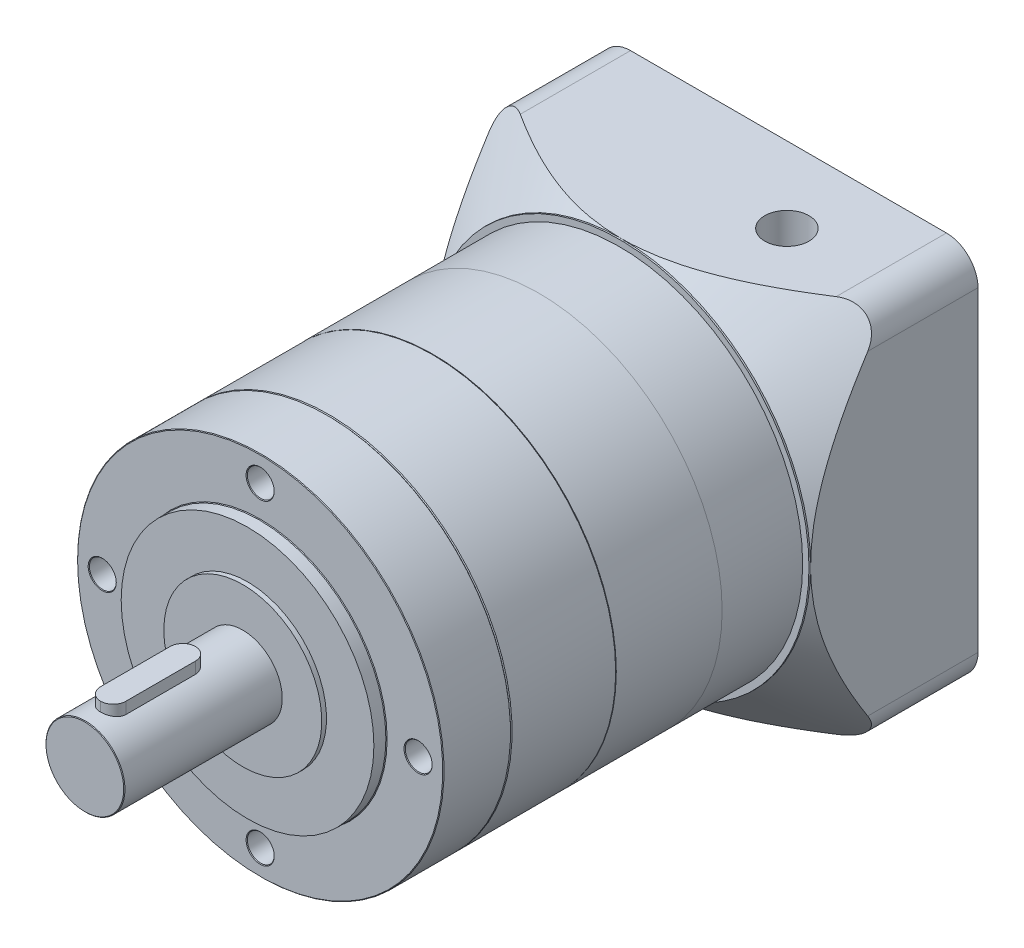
ISO-10303-21;
HEADER;
FILE_DESCRIPTION(('STEP AP214'),'2;1');
FILE_NAME('part.step','',(''),(''),'','','');
FILE_SCHEMA(('AUTOMOTIVE_DESIGN { 1 0 10303 214 1 1 1 1 }'));
ENDSEC;
DATA;
#1=APPLICATION_CONTEXT('core data for automotive mechanical design processes');
#2=APPLICATION_PROTOCOL_DEFINITION('international standard','automotive_design',2000,#1);
#3=PRODUCT_CONTEXT('',#1,'mechanical');
#4=PRODUCT('Part','Part','',(#3));
#5=PRODUCT_RELATED_PRODUCT_CATEGORY('part','',(#4));
#6=PRODUCT_DEFINITION_FORMATION('','',#4);
#7=PRODUCT_DEFINITION_CONTEXT('part definition',#1,'design');
#8=PRODUCT_DEFINITION('design','',#6,#7);
#9=PRODUCT_DEFINITION_SHAPE('','',#8);
#10=(LENGTH_UNIT() NAMED_UNIT(*) SI_UNIT(.MILLI.,.METRE.));
#11=(NAMED_UNIT(*) PLANE_ANGLE_UNIT() SI_UNIT($,.RADIAN.));
#12=(NAMED_UNIT(*) SI_UNIT($,.STERADIAN.) SOLID_ANGLE_UNIT());
#13=UNCERTAINTY_MEASURE_WITH_UNIT(LENGTH_MEASURE(1.E-05),#10,'distance_accuracy_value','');
#14=(GEOMETRIC_REPRESENTATION_CONTEXT(3) GLOBAL_UNCERTAINTY_ASSIGNED_CONTEXT((#13)) GLOBAL_UNIT_ASSIGNED_CONTEXT((#10,
#11,#12)) REPRESENTATION_CONTEXT('',''));
#15=CARTESIAN_POINT('',(0.,0.,0.));
#16=DIRECTION('',(0.,0.,1.));
#17=DIRECTION('',(1.,0.,0.));
#18=AXIS2_PLACEMENT_3D('',#15,#16,#17);
#19=CARTESIAN_POINT('',(40.1259505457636,-22.1506662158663,170.370553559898));
#20=DIRECTION('',(0.,0.,-1.));
#21=DIRECTION('',(-1.,0.,0.));
#22=AXIS2_PLACEMENT_3D('',#19,#20,#21);
#23=CYLINDRICAL_SURFACE('',#22,12.5);
#24=CARTESIAN_POINT('',(40.1259505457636,-22.1506662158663,343.120553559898));
#25=DIRECTION('',(0.,0.,-1.));
#26=DIRECTION('',(-1.,0.,0.));
#27=AXIS2_PLACEMENT_3D('',#24,#25,#26);
#28=CIRCLE('',#27,12.5);
#29=CARTESIAN_POINT('',(27.6259505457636,-22.1506662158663,343.120553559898));
#30=VERTEX_POINT('',#29);
#31=EDGE_CURVE('E151',#30,#30,#28,.T.);
#32=ORIENTED_EDGE('',*,*,#31,.F.);
#33=EDGE_LOOP('',(#32));
#34=FACE_BOUND('',#33,.T.);
#35=CARTESIAN_POINT('',(40.1259505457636,-22.1506662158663,392.920553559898));
#36=DIRECTION('',(0.,0.,1.));
#37=DIRECTION('',(1.,0.,0.));
#38=AXIS2_PLACEMENT_3D('',#35,#36,#37);
#39=CIRCLE('',#38,12.5);
#40=CARTESIAN_POINT('',(52.6259505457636,-22.1506662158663,392.920553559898));
#41=VERTEX_POINT('',#40);
#42=EDGE_CURVE('E202',#41,#41,#39,.F.);
#43=ORIENTED_EDGE('',*,*,#42,.T.);
#44=EDGE_LOOP('',(#43));
#45=FACE_BOUND('',#44,.T.);
#46=CARTESIAN_POINT('',(36.1259505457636,-10.3079469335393,362.120553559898));
#47=CARTESIAN_POINT('',(36.1259364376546,-10.3079634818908,362.011149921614));
#48=CARTESIAN_POINT('',(36.130438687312,-10.3064313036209,361.901755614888));
#49=CARTESIAN_POINT('',(36.1483660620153,-10.3003925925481,361.68380994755));
#50=CARTESIAN_POINT('',(36.1617889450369,-10.2958868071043,361.575258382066));
#51=CARTESIAN_POINT('',(36.1973970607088,-10.2840407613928,361.360073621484));
#52=CARTESIAN_POINT('',(36.2195572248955,-10.2767086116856,361.253435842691));
#53=CARTESIAN_POINT('',(36.272416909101,-10.2594490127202,361.042540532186));
#54=CARTESIAN_POINT('',(36.3031167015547,-10.2495214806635,360.938283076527));
#55=CARTESIAN_POINT('',(36.4076316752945,-10.2162825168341,360.630252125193));
#56=CARTESIAN_POINT('',(36.4939120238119,-10.1894971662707,360.430923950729));
#57=CARTESIAN_POINT('',(36.6969963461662,-10.1297089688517,360.049547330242));
#58=CARTESIAN_POINT('',(36.8138182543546,-10.0967024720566,359.867509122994));
#59=CARTESIAN_POINT('',(37.0791635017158,-10.0268682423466,359.519301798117));
#60=CARTESIAN_POINT('',(37.2285926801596,-9.98995125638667,359.353839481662));
#61=CARTESIAN_POINT('',(37.5529827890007,-9.91721102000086,359.049842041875));
#62=CARTESIAN_POINT('',(37.7279487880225,-9.88138798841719,358.911312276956));
#63=CARTESIAN_POINT('',(38.1036359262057,-9.81383093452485,358.661899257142));
#64=CARTESIAN_POINT('',(38.304876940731,-9.78221653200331,358.551764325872));
#65=CARTESIAN_POINT('',(38.7241322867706,-9.72772690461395,358.367255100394));
#66=CARTESIAN_POINT('',(38.9421311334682,-9.70484372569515,358.292848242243));
#67=CARTESIAN_POINT('',(39.3219647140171,-9.6755542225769,358.198854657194));
#68=CARTESIAN_POINT('',(39.4812233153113,-9.6662717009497,358.169545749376));
#69=CARTESIAN_POINT('',(39.721993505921,-9.65693653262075,358.140181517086));
#70=CARTESIAN_POINT('',(39.8025722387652,-9.65458957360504,358.132826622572));
#71=CARTESIAN_POINT('',(39.9640786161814,-9.65145265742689,358.123010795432));
#72=CARTESIAN_POINT('',(40.0450063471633,-9.65066311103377,358.120551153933));
#73=CARTESIAN_POINT('',(40.1259505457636,-9.65066621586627,358.120553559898));
#74=B_SPLINE_CURVE_WITH_KNOTS('',3,(#46,#47,#48,#49,#50,#51,#52,#53,#54,#55,#56,#57,#58,#59,#60,
#61,#62,#63,#64,#65,#66,#67,#68,#69,#70,#71,#72,#73),.UNSPECIFIED.,.F.,.F.,(4,2,2,2,2,2,2,2,2,2,
2,2,2,4),(0.,0.3280917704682,0.65610111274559,0.983176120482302,1.31026156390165,
1.96354160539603,2.61720612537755,3.2920858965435,3.9670998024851,4.65841267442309,
5.34909425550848,5.83438547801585,6.0770804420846,6.31983940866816),.UNSPECIFIED.);
#75=CARTESIAN_POINT('',(36.1259505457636,-10.3079469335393,362.120553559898));
#76=VERTEX_POINT('',#75);
#77=CARTESIAN_POINT('',(40.1259505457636,-9.65066621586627,358.120553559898));
#78=VERTEX_POINT('',#77);
#79=EDGE_CURVE('E78',#76,#78,#74,.T.);
#80=ORIENTED_EDGE('',*,*,#79,.T.);
#81=CARTESIAN_POINT('',(40.1259505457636,-9.65066621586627,358.120553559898));
#82=CARTESIAN_POINT('',(40.2354993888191,-9.65065269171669,358.120539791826));
#83=CARTESIAN_POINT('',(40.3450397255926,-9.65210601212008,358.125053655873));
#84=CARTESIAN_POINT('',(40.5632858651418,-9.65784576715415,358.143029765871));
#85=CARTESIAN_POINT('',(40.6719918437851,-9.66213158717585,358.156490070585));
#86=CARTESIAN_POINT('',(40.8875148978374,-9.67342091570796,358.192205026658));
#87=CARTESIAN_POINT('',(40.9943362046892,-9.68041721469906,358.214436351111));
#88=CARTESIAN_POINT('',(41.2056013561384,-9.69692769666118,358.267472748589));
#89=CARTESIAN_POINT('',(41.3100451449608,-9.70644193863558,358.29827802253));
#90=CARTESIAN_POINT('',(41.618663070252,-9.73839844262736,358.403175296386));
#91=CARTESIAN_POINT('',(41.818386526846,-9.76426914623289,358.489792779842));
#92=CARTESIAN_POINT('',(42.2004238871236,-9.82248470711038,358.693666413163));
#93=CARTESIAN_POINT('',(42.3827292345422,-9.85483272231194,358.810937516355));
#94=CARTESIAN_POINT('',(42.7306702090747,-9.92373765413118,359.076755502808));
#95=CARTESIAN_POINT('',(42.8956737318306,-9.96038902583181,359.226106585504));
#96=CARTESIAN_POINT('',(43.1987767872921,-10.0332364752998,359.550147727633));
#97=CARTESIAN_POINT('',(43.3368686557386,-10.0694324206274,359.724844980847));
#98=CARTESIAN_POINT('',(43.5857804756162,-10.1383088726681,360.100250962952));
#99=CARTESIAN_POINT('',(43.6957823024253,-10.1708710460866,360.30152556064));
#100=CARTESIAN_POINT('',(43.8800304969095,-10.2273168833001,360.720836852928));
#101=CARTESIAN_POINT('',(43.9543129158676,-10.2512092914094,360.938856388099));
#102=CARTESIAN_POINT('',(44.0479989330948,-10.2818358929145,361.318358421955));
#103=CARTESIAN_POINT('',(44.0771727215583,-10.2915650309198,361.47723773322));
#104=CARTESIAN_POINT('',(44.1064063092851,-10.3013594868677,361.717457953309));
#105=CARTESIAN_POINT('',(44.1137296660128,-10.3038244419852,361.797863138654));
#106=CARTESIAN_POINT('',(44.1235036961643,-10.3071203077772,361.959024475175));
#107=CARTESIAN_POINT('',(44.1259530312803,-10.3079507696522,362.039780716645));
#108=CARTESIAN_POINT('',(44.1259505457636,-10.3079469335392,362.120553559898));
#109=B_SPLINE_CURVE_WITH_KNOTS('',3,(#81,#82,#83,#84,#85,#86,#87,#88,#89,#90,#91,#92,#93,#94,
#95,#96,#97,#98,#99,#100,#101,#102,#103,#104,#105,#106,#107,#108),.UNSPECIFIED.,.F.,.F.,(4,2,2,
2,2,2,2,2,2,2,2,2,2,4),(0.,0.328529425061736,0.656987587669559,0.984578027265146,
1.31217614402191,1.96658196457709,2.62130761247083,3.2949087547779,3.96870145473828,
4.66031934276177,5.35123771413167,5.83541629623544,6.0775943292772,6.31983885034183),.UNSPECIFIED.);
#110=CARTESIAN_POINT('',(44.1259505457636,-10.3079469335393,362.120553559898));
#111=VERTEX_POINT('',#110);
#112=EDGE_CURVE('E244',#78,#111,#109,.T.);
#113=ORIENTED_EDGE('',*,*,#112,.T.);
#114=DIRECTION('',(0.,0.,-1.));
#115=VECTOR('',#114,1.);
#116=CARTESIAN_POINT('',(44.1259505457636,-10.3079469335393,170.370553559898));
#117=LINE('',#116,#115);
#118=CARTESIAN_POINT('',(44.1259505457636,-10.3079469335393,384.120553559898));
#119=VERTEX_POINT('',#118);
#120=EDGE_CURVE('E214',#119,#111,#117,.T.);
#121=ORIENTED_EDGE('',*,*,#120,.F.);
#122=CARTESIAN_POINT('',(44.1259505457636,-10.3079469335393,384.120553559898));
#123=CARTESIAN_POINT('',(44.1259646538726,-10.3079634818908,384.229957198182));
#124=CARTESIAN_POINT('',(44.1214624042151,-10.3064313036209,384.339351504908));
#125=CARTESIAN_POINT('',(44.1035350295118,-10.300392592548,384.557297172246));
#126=CARTESIAN_POINT('',(44.0901121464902,-10.2958868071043,384.66584873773));
#127=CARTESIAN_POINT('',(44.0545040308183,-10.2840407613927,384.881033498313));
#128=CARTESIAN_POINT('',(44.0323438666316,-10.2767086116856,384.987671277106));
#129=CARTESIAN_POINT('',(43.9794841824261,-10.2594490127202,385.19856658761));
#130=CARTESIAN_POINT('',(43.9487843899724,-10.2495214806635,385.302824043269));
#131=CARTESIAN_POINT('',(43.8442694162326,-10.2162825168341,385.610854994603));
#132=CARTESIAN_POINT('',(43.7579890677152,-10.1894971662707,385.810183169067));
#133=CARTESIAN_POINT('',(43.5549047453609,-10.1297089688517,386.191559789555));
#134=CARTESIAN_POINT('',(43.4380828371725,-10.0967024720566,386.373597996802));
#135=CARTESIAN_POINT('',(43.1727375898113,-10.0268682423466,386.721805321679));
#136=CARTESIAN_POINT('',(43.0233084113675,-9.98995125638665,386.887267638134));
#137=CARTESIAN_POINT('',(42.6989183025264,-9.91721102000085,387.191265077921));
#138=CARTESIAN_POINT('',(42.5239523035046,-9.88138798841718,387.32979484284));
#139=CARTESIAN_POINT('',(42.1482651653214,-9.81383093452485,387.579207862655));
#140=CARTESIAN_POINT('',(41.9470241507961,-9.7822165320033,387.689342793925));
#141=CARTESIAN_POINT('',(41.5277688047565,-9.72772690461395,387.873852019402));
#142=CARTESIAN_POINT('',(41.3097699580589,-9.70484372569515,387.948258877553));
#143=CARTESIAN_POINT('',(40.92993637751,-9.6755542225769,388.042252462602));
#144=CARTESIAN_POINT('',(40.7706777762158,-9.6662717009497,388.07156137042));
#145=CARTESIAN_POINT('',(40.5299075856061,-9.65693653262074,388.10092560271));
#146=CARTESIAN_POINT('',(40.449328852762,-9.65458957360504,388.108280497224));
#147=CARTESIAN_POINT('',(40.2878224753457,-9.65145265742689,388.118096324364));
#148=CARTESIAN_POINT('',(40.2068947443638,-9.65066311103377,388.120555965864));
#149=CARTESIAN_POINT('',(40.1259505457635,-9.65066621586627,388.120553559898));
#150=B_SPLINE_CURVE_WITH_KNOTS('',3,(#122,#123,#124,#125,#126,#127,#128,#129,#130,#131,#132,
#133,#134,#135,#136,#137,#138,#139,#140,#141,#142,#143,#144,#145,#146,#147,#148,#149),
.UNSPECIFIED.,.F.,.F.,(4,2,2,2,2,2,2,2,2,2,2,2,2,4),(0.,0.328091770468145,0.656101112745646,
0.983176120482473,1.31026156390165,1.96354160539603,2.61720612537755,3.2920858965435,
3.9670998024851,4.6584126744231,5.34909425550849,5.83438547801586,6.0770804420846,
6.31983940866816),.UNSPECIFIED.);
#151=CARTESIAN_POINT('',(40.1259505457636,-9.65066621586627,388.120553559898));
#152=VERTEX_POINT('',#151);
#153=EDGE_CURVE('E13',#119,#152,#150,.T.);
#154=ORIENTED_EDGE('',*,*,#153,.T.);
#155=CARTESIAN_POINT('',(40.1259505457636,-9.65066621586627,388.120553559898));
#156=CARTESIAN_POINT('',(40.016401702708,-9.65065269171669,388.12056732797));
#157=CARTESIAN_POINT('',(39.9068613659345,-9.65210601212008,388.116053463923));
#158=CARTESIAN_POINT('',(39.6886152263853,-9.65784576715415,388.098077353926));
#159=CARTESIAN_POINT('',(39.579909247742,-9.66213158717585,388.084617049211));
#160=CARTESIAN_POINT('',(39.3643861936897,-9.67342091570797,388.048902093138));
#161=CARTESIAN_POINT('',(39.2575648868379,-9.68041721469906,388.026670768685));
#162=CARTESIAN_POINT('',(39.0462997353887,-9.69692769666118,387.973634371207));
#163=CARTESIAN_POINT('',(38.9418559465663,-9.70644193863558,387.942829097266));
#164=CARTESIAN_POINT('',(38.6332380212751,-9.73839844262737,387.83793182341));
#165=CARTESIAN_POINT('',(38.4335145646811,-9.7642691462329,387.751314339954));
#166=CARTESIAN_POINT('',(38.0514772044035,-9.82248470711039,387.547440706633));
#167=CARTESIAN_POINT('',(37.8691718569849,-9.85483272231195,387.430169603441));
#168=CARTESIAN_POINT('',(37.5212308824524,-9.92373765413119,387.164351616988));
#169=CARTESIAN_POINT('',(37.3562273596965,-9.96038902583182,387.015000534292));
#170=CARTESIAN_POINT('',(37.053124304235,-10.0332364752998,386.690959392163));
#171=CARTESIAN_POINT('',(36.9150324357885,-10.0694324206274,386.516262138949));
#172=CARTESIAN_POINT('',(36.6661206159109,-10.1383088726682,386.140856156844));
#173=CARTESIAN_POINT('',(36.5561187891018,-10.1708710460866,385.939581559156));
#174=CARTESIAN_POINT('',(36.3718705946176,-10.2273168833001,385.520270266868));
#175=CARTESIAN_POINT('',(36.2975881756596,-10.2512092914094,385.302250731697));
#176=CARTESIAN_POINT('',(36.2039021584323,-10.2818358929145,384.922748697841));
#177=CARTESIAN_POINT('',(36.1747283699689,-10.2915650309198,384.763869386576));
#178=CARTESIAN_POINT('',(36.145494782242,-10.3013594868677,384.523649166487));
#179=CARTESIAN_POINT('',(36.1381714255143,-10.3038244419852,384.443243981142));
#180=CARTESIAN_POINT('',(36.1283973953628,-10.3071203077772,384.282082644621));
#181=CARTESIAN_POINT('',(36.1259480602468,-10.3079507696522,384.201326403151));
#182=CARTESIAN_POINT('',(36.1259505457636,-10.3079469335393,384.120553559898));
#183=B_SPLINE_CURVE_WITH_KNOTS('',3,(#155,#156,#157,#158,#159,#160,#161,#162,#163,#164,#165,
#166,#167,#168,#169,#170,#171,#172,#173,#174,#175,#176,#177,#178,#179,#180,#181,#182),
.UNSPECIFIED.,.F.,.F.,(4,2,2,2,2,2,2,2,2,2,2,2,2,4),(0.,0.328529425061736,0.656987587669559,
0.98457802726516,1.31217614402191,1.9665819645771,2.62130761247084,3.29490875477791,
3.96870145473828,4.66031934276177,5.35123771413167,5.83541629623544,6.0775943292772,
6.31983885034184),.UNSPECIFIED.);
#184=CARTESIAN_POINT('',(36.1259505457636,-10.3079469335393,384.120553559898));
#185=VERTEX_POINT('',#184);
#186=EDGE_CURVE('E65',#152,#185,#183,.T.);
#187=ORIENTED_EDGE('',*,*,#186,.T.);
#188=DIRECTION('',(0.,0.,-1.));
#189=VECTOR('',#188,1.);
#190=CARTESIAN_POINT('',(36.1259505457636,-10.3079469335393,170.370553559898));
#191=LINE('',#190,#189);
#192=EDGE_CURVE('E217',#76,#185,#191,.F.);
#193=ORIENTED_EDGE('',*,*,#192,.F.);
#194=EDGE_LOOP('',(#80,#113,#121,#154,#187,#193));
#195=FACE_BOUND('',#194,.T.);
#196=ADVANCED_FACE('F55',(#34,#45,#195),#23,.T.);
#197=CARTESIAN_POINT('',(40.1259505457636,-22.1506662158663,316.120553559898));
#198=DIRECTION('',(0.,0.,1.));
#199=DIRECTION('',(1.,0.,0.));
#200=AXIS2_PLACEMENT_3D('',#197,#198,#199);
#201=CONICAL_SURFACE('',#200,57.7500000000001,0.785398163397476);
#202=CARTESIAN_POINT('',(40.1259505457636,-22.1506662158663,316.370553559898));
#203=DIRECTION('',(0.,0.,-1.));
#204=DIRECTION('',(-1.,0.,0.));
#205=AXIS2_PLACEMENT_3D('',#202,#203,#204);
#206=CIRCLE('',#205,58.);
#207=CARTESIAN_POINT('',(-17.8740494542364,-22.1506662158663,316.370553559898));
#208=VERTEX_POINT('',#207);
#209=EDGE_CURVE('E163',#208,#208,#206,.T.);
#210=ORIENTED_EDGE('',*,*,#209,.T.);
#211=EDGE_LOOP('',(#210));
#212=FACE_BOUND('',#211,.T.);
#213=CARTESIAN_POINT('',(40.1259505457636,-22.1506662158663,316.120553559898));
#214=DIRECTION('',(0.,0.,-1.));
#215=DIRECTION('',(-1.,0.,0.));
#216=AXIS2_PLACEMENT_3D('',#213,#214,#215);
#217=CIRCLE('',#216,57.7500000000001);
#218=CARTESIAN_POINT('',(-17.6240494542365,-22.1506662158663,316.120553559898));
#219=VERTEX_POINT('',#218);
#220=EDGE_CURVE('E145',#219,#219,#217,.T.);
#221=ORIENTED_EDGE('',*,*,#220,.F.);
#222=EDGE_LOOP('',(#221));
#223=FACE_BOUND('',#222,.T.);
#224=ADVANCED_FACE('F257',(#212,#223),#201,.T.);
#225=CARTESIAN_POINT('',(40.1259505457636,-22.1506662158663,170.370553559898));
#226=DIRECTION('',(0.,0.,-1.));
#227=DIRECTION('',(-1.,0.,0.));
#228=AXIS2_PLACEMENT_3D('',#225,#226,#227);
#229=CYLINDRICAL_SURFACE('',#228,58.);
#230=CARTESIAN_POINT('',(40.1259505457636,-22.1506662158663,337.420553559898));
#231=DIRECTION('',(0.,0.,1.));
#232=DIRECTION('',(1.,0.,0.));
#233=AXIS2_PLACEMENT_3D('',#230,#231,#232);
#234=CIRCLE('',#233,58.);
#235=CARTESIAN_POINT('',(-17.8740494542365,-22.1506662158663,337.420553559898));
#236=VERTEX_POINT('',#235);
#237=EDGE_CURVE('E166',#236,#236,#234,.F.);
#238=ORIENTED_EDGE('',*,*,#237,.T.);
#239=EDGE_LOOP('',(#238));
#240=FACE_BOUND('',#239,.T.);
#241=ORIENTED_EDGE('',*,*,#209,.F.);
#242=EDGE_LOOP('',(#241));
#243=FACE_BOUND('',#242,.T.);
#244=ADVANCED_FACE('F568',(#240,#243),#229,.T.);
#245=CARTESIAN_POINT('',(31.1383083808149,-31.1383083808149,337.620553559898));
#246=DIRECTION('',(0.,0.,1.));
#247=DIRECTION('',(1.,0.,0.));
#248=AXIS2_PLACEMENT_3D('',#245,#246,#247);
#249=PLANE('',#248);
#250=CARTESIAN_POINT('',(40.1259505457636,-22.1506662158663,337.620553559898));
#251=DIRECTION('',(0.,0.,1.));
#252=DIRECTION('',(1.,0.,0.));
#253=AXIS2_PLACEMENT_3D('',#250,#251,#252);
#254=CIRCLE('',#253,57.8);
#255=CARTESIAN_POINT('',(-17.6740494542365,-22.1506662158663,337.620553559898));
#256=VERTEX_POINT('',#255);
#257=EDGE_CURVE('E184',#256,#256,#254,.T.);
#258=ORIENTED_EDGE('',*,*,#257,.T.);
#259=EDGE_LOOP('',(#258));
#260=FACE_BOUND('',#259,.T.);
#261=CARTESIAN_POINT('',(40.1259505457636,-22.1506662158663,337.620553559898));
#262=DIRECTION('',(0.,0.,1.));
#263=DIRECTION('',(1.,0.,0.));
#264=AXIS2_PLACEMENT_3D('',#261,#262,#263);
#265=CIRCLE('',#264,40.2);
#266=CARTESIAN_POINT('',(-0.0740494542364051,-22.1506662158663,337.620553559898));
#267=VERTEX_POINT('',#266);
#268=EDGE_CURVE('E181',#267,#267,#265,.F.);
#269=ORIENTED_EDGE('',*,*,#268,.T.);
#270=EDGE_LOOP('',(#269));
#271=FACE_BOUND('',#270,.T.);
#272=CARTESIAN_POINT('',(40.1259505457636,27.8493337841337,337.620553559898));
#273=DIRECTION('',(0.,0.,1.));
#274=DIRECTION('',(1.,0.,0.));
#275=AXIS2_PLACEMENT_3D('',#272,#273,#274);
#276=CIRCLE('',#275,4.44999999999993);
#277=CARTESIAN_POINT('',(44.5759505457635,27.8493337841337,337.620553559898));
#278=VERTEX_POINT('',#277);
#279=EDGE_CURVE('E178',#278,#278,#276,.F.);
#280=ORIENTED_EDGE('',*,*,#279,.T.);
#281=EDGE_LOOP('',(#280));
#282=FACE_BOUND('',#281,.T.);
#283=CARTESIAN_POINT('',(90.1259505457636,-22.1506662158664,337.620553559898));
#284=DIRECTION('',(0.,0.,1.));
#285=DIRECTION('',(1.,0.,0.));
#286=AXIS2_PLACEMENT_3D('',#283,#284,#285);
#287=CIRCLE('',#286,4.44999999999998);
#288=CARTESIAN_POINT('',(94.5759505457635,-22.1506662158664,337.620553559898));
#289=VERTEX_POINT('',#288);
#290=EDGE_CURVE('E175',#289,#289,#287,.F.);
#291=ORIENTED_EDGE('',*,*,#290,.T.);
#292=EDGE_LOOP('',(#291));
#293=FACE_BOUND('',#292,.T.);
#294=CARTESIAN_POINT('',(40.1259505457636,-72.1506662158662,337.620553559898));
#295=DIRECTION('',(0.,0.,1.));
#296=DIRECTION('',(1.,0.,0.));
#297=AXIS2_PLACEMENT_3D('',#294,#295,#296);
#298=CIRCLE('',#297,4.44999999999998);
#299=CARTESIAN_POINT('',(44.5759505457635,-72.1506662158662,337.620553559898));
#300=VERTEX_POINT('',#299);
#301=EDGE_CURVE('E172',#300,#300,#298,.F.);
#302=ORIENTED_EDGE('',*,*,#301,.T.);
#303=EDGE_LOOP('',(#302));
#304=FACE_BOUND('',#303,.T.);
#305=CARTESIAN_POINT('',(-9.87404945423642,-22.1506662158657,337.620553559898));
#306=DIRECTION('',(0.,0.,1.));
#307=DIRECTION('',(1.,0.,0.));
#308=AXIS2_PLACEMENT_3D('',#305,#306,#307);
#309=CIRCLE('',#308,4.44999999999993);
#310=CARTESIAN_POINT('',(-5.42404945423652,-22.1506662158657,337.620553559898));
#311=VERTEX_POINT('',#310);
#312=EDGE_CURVE('E169',#311,#311,#309,.F.);
#313=ORIENTED_EDGE('',*,*,#312,.T.);
#314=EDGE_LOOP('',(#313));
#315=FACE_BOUND('',#314,.T.);
#316=ADVANCED_FACE('F559',(#260,#271,#282,#293,#304,#315),#249,.T.);
#317=CARTESIAN_POINT('',(40.1259505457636,-22.1506662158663,170.370553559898));
#318=DIRECTION('',(0.,0.,-1.));
#319=DIRECTION('',(-1.,0.,0.));
#320=AXIS2_PLACEMENT_3D('',#317,#318,#319);
#321=CYLINDRICAL_SURFACE('',#320,40.);
#322=CARTESIAN_POINT('',(40.1259505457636,-22.1506662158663,337.820553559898));
#323=DIRECTION('',(0.,0.,1.));
#324=DIRECTION('',(1.,0.,0.));
#325=AXIS2_PLACEMENT_3D('',#322,#323,#324);
#326=CIRCLE('',#325,40.);
#327=CARTESIAN_POINT('',(0.125950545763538,-22.1506662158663,337.820553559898));
#328=VERTEX_POINT('',#327);
#329=EDGE_CURVE('E187',#328,#328,#326,.T.);
#330=ORIENTED_EDGE('',*,*,#329,.T.);
#331=EDGE_LOOP('',(#330));
#332=FACE_BOUND('',#331,.T.);
#333=CARTESIAN_POINT('',(40.1259505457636,-22.1506662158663,341.620553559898));
#334=DIRECTION('',(0.,0.,-1.));
#335=DIRECTION('',(-1.,0.,0.));
#336=AXIS2_PLACEMENT_3D('',#333,#334,#335);
#337=CIRCLE('',#336,40.);
#338=CARTESIAN_POINT('',(0.125950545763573,-22.1506662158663,341.620553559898));
#339=VERTEX_POINT('',#338);
#340=EDGE_CURVE('E160',#339,#339,#337,.T.);
#341=ORIENTED_EDGE('',*,*,#340,.T.);
#342=EDGE_LOOP('',(#341));
#343=FACE_BOUND('',#342,.T.);
#344=ADVANCED_FACE('F550',(#332,#343),#321,.T.);
#345=CARTESIAN_POINT('',(31.1383083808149,-31.1383083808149,341.620553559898));
#346=DIRECTION('',(0.,0.,1.));
#347=DIRECTION('',(1.,0.,0.));
#348=AXIS2_PLACEMENT_3D('',#345,#346,#347);
#349=PLANE('',#348);
#350=CARTESIAN_POINT('',(40.1259505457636,-22.1506662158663,341.620553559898));
#351=DIRECTION('',(0.,0.,-1.));
#352=DIRECTION('',(-1.,0.,0.));
#353=AXIS2_PLACEMENT_3D('',#350,#351,#352);
#354=CIRCLE('',#353,25.);
#355=CARTESIAN_POINT('',(15.1259505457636,-22.1506662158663,341.620553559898));
#356=VERTEX_POINT('',#355);
#357=EDGE_CURVE('E157',#356,#356,#354,.T.);
#358=ORIENTED_EDGE('',*,*,#357,.T.);
#359=EDGE_LOOP('',(#358));
#360=FACE_BOUND('',#359,.T.);
#361=ORIENTED_EDGE('',*,*,#340,.F.);
#362=EDGE_LOOP('',(#361));
#363=FACE_BOUND('',#362,.T.);
#364=ADVANCED_FACE('F542',(#360,#363),#349,.T.);
#365=CARTESIAN_POINT('',(40.1259505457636,-22.1506662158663,170.370553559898));
#366=DIRECTION('',(0.,0.,-1.));
#367=DIRECTION('',(-1.,0.,0.));
#368=AXIS2_PLACEMENT_3D('',#365,#366,#367);
#369=CYLINDRICAL_SURFACE('',#368,25.);
#370=CARTESIAN_POINT('',(40.1259505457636,-22.1506662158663,343.120553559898));
#371=DIRECTION('',(0.,0.,-1.));
#372=DIRECTION('',(-1.,0.,0.));
#373=AXIS2_PLACEMENT_3D('',#370,#371,#372);
#374=CIRCLE('',#373,25.);
#375=CARTESIAN_POINT('',(15.1259505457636,-22.1506662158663,343.120553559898));
#376=VERTEX_POINT('',#375);
#377=EDGE_CURVE('E154',#376,#376,#374,.T.);
#378=ORIENTED_EDGE('',*,*,#377,.T.);
#379=EDGE_LOOP('',(#378));
#380=FACE_BOUND('',#379,.T.);
#381=ORIENTED_EDGE('',*,*,#357,.F.);
#382=EDGE_LOOP('',(#381));
#383=FACE_BOUND('',#382,.T.);
#384=ADVANCED_FACE('F534',(#380,#383),#369,.T.);
#385=CARTESIAN_POINT('',(31.1383083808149,-31.1383083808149,343.120553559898));
#386=DIRECTION('',(0.,0.,1.));
#387=DIRECTION('',(1.,0.,0.));
#388=AXIS2_PLACEMENT_3D('',#385,#386,#387);
#389=PLANE('',#388);
#390=ORIENTED_EDGE('',*,*,#31,.T.);
#391=EDGE_LOOP('',(#390));
#392=FACE_BOUND('',#391,.T.);
#393=ORIENTED_EDGE('',*,*,#377,.F.);
#394=EDGE_LOOP('',(#393));
#395=FACE_BOUND('',#394,.T.);
#396=ADVANCED_FACE('F261',(#392,#395),#389,.T.);
#397=CARTESIAN_POINT('',(31.1383083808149,-31.1383083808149,393.120553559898));
#398=DIRECTION('',(0.,0.,1.));
#399=DIRECTION('',(1.,0.,0.));
#400=AXIS2_PLACEMENT_3D('',#397,#398,#399);
#401=PLANE('',#400);
#402=CARTESIAN_POINT('',(40.1259505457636,-22.1506662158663,393.120553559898));
#403=DIRECTION('',(0.,0.,1.));
#404=DIRECTION('',(1.,0.,0.));
#405=AXIS2_PLACEMENT_3D('',#402,#403,#404);
#406=CIRCLE('',#405,12.2999999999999);
#407=CARTESIAN_POINT('',(52.4259505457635,-22.1506662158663,393.120553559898));
#408=VERTEX_POINT('',#407);
#409=EDGE_CURVE('E205',#408,#408,#406,.T.);
#410=ORIENTED_EDGE('',*,*,#409,.T.);
#411=EDGE_LOOP('',(#410));
#412=FACE_BOUND('',#411,.T.);
#413=ADVANCED_FACE('F259',(#412),#401,.T.);
#414=CARTESIAN_POINT('',(31.1383083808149,-31.1383083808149,282.870553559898));
#415=DIRECTION('',(0.,0.,-1.));
#416=DIRECTION('',(-1.,0.,0.));
#417=AXIS2_PLACEMENT_3D('',#414,#415,#416);
#418=PLANE('',#417);
#419=CARTESIAN_POINT('',(40.1259505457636,-22.1506662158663,282.870553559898));
#420=DIRECTION('',(0.,0.,-1.));
#421=DIRECTION('',(-1.,0.,0.));
#422=AXIS2_PLACEMENT_3D('',#419,#420,#421);
#423=CIRCLE('',#422,57.8000000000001);
#424=CARTESIAN_POINT('',(97.9259505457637,-22.1506662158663,282.870553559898));
#425=VERTEX_POINT('',#424);
#426=EDGE_CURVE('E208',#425,#425,#423,.T.);
#427=ORIENTED_EDGE('',*,*,#426,.T.);
#428=EDGE_LOOP('',(#427));
#429=FACE_BOUND('',#428,.T.);
#430=ADVANCED_FACE('F511',(#429),#418,.T.);
#431=CARTESIAN_POINT('',(40.1259505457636,-22.1506662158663,170.370553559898));
#432=DIRECTION('',(0.,0.,-1.));
#433=DIRECTION('',(-1.,0.,0.));
#434=AXIS2_PLACEMENT_3D('',#431,#432,#433);
#435=CYLINDRICAL_SURFACE('',#434,58.);
#436=CARTESIAN_POINT('',(40.1259505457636,-22.1506662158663,283.070553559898));
#437=DIRECTION('',(0.,0.,-1.));
#438=DIRECTION('',(-1.,0.,0.));
#439=AXIS2_PLACEMENT_3D('',#436,#437,#438);
#440=CIRCLE('',#439,58.);
#441=CARTESIAN_POINT('',(98.1259505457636,-22.1506662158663,283.070553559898));
#442=VERTEX_POINT('',#441);
#443=EDGE_CURVE('E211',#442,#442,#440,.F.);
#444=ORIENTED_EDGE('',*,*,#443,.T.);
#445=EDGE_LOOP('',(#444));
#446=FACE_BOUND('',#445,.T.);
#447=CARTESIAN_POINT('',(40.1259505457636,-22.1506662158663,315.870553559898));
#448=DIRECTION('',(0.,0.,-1.));
#449=DIRECTION('',(-1.,0.,0.));
#450=AXIS2_PLACEMENT_3D('',#447,#448,#449);
#451=CIRCLE('',#450,58.);
#452=CARTESIAN_POINT('',(-17.8740494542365,-22.1506662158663,315.870553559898));
#453=VERTEX_POINT('',#452);
#454=EDGE_CURVE('E148',#453,#453,#451,.T.);
#455=ORIENTED_EDGE('',*,*,#454,.T.);
#456=EDGE_LOOP('',(#455));
#457=FACE_BOUND('',#456,.T.);
#458=ADVANCED_FACE('F502',(#446,#457),#435,.T.);
#459=CARTESIAN_POINT('',(40.1259505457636,-22.1506662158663,316.120553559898));
#460=DIRECTION('',(0.,0.,-1.));
#461=DIRECTION('',(-1.,0.,0.));
#462=AXIS2_PLACEMENT_3D('',#459,#460,#461);
#463=CONICAL_SURFACE('',#462,57.7500000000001,0.785398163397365);
#464=ORIENTED_EDGE('',*,*,#454,.F.);
#465=EDGE_LOOP('',(#464));
#466=FACE_BOUND('',#465,.T.);
#467=ORIENTED_EDGE('',*,*,#220,.T.);
#468=EDGE_LOOP('',(#467));
#469=FACE_BOUND('',#468,.T.);
#470=ADVANCED_FACE('F493',(#466,#469),#463,.T.);
#471=CARTESIAN_POINT('',(40.1259505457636,27.8493337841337,323.120553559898));
#472=DIRECTION('',(0.,0.,1.));
#473=DIRECTION('',(1.,0.,0.));
#474=AXIS2_PLACEMENT_3D('',#471,#472,#473);
#475=CONICAL_SURFACE('',#474,4.25,1.02974425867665);
#476=CARTESIAN_POINT('',(40.1259505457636,27.8493337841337,320.566895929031));
#477=VERTEX_POINT('',#476);
#478=VERTEX_LOOP('',#477);
#479=FACE_BOUND('',#478,.T.);
#480=CARTESIAN_POINT('',(40.1259505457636,27.8493337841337,323.120553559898));
#481=DIRECTION('',(0.,0.,1.));
#482=DIRECTION('',(1.,0.,0.));
#483=AXIS2_PLACEMENT_3D('',#480,#481,#482);
#484=CIRCLE('',#483,4.25);
#485=CARTESIAN_POINT('',(44.3759505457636,27.8493337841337,323.120553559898));
#486=VERTEX_POINT('',#485);
#487=EDGE_CURVE('E142',#486,#486,#484,.T.);
#488=ORIENTED_EDGE('',*,*,#487,.T.);
#489=EDGE_LOOP('',(#488));
#490=FACE_BOUND('',#489,.T.);
#491=ADVANCED_FACE('F483',(#479,#490),#475,.F.);
#492=CARTESIAN_POINT('',(40.1259505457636,27.8493337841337,337.620553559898));
#493=DIRECTION('',(0.,0.,1.));
#494=DIRECTION('',(1.,0.,0.));
#495=AXIS2_PLACEMENT_3D('',#492,#493,#494);
#496=CYLINDRICAL_SURFACE('',#495,4.24999999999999);
#497=CARTESIAN_POINT('',(40.1259505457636,27.8493337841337,337.420553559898));
#498=DIRECTION('',(0.,0.,1.));
#499=DIRECTION('',(1.,0.,0.));
#500=AXIS2_PLACEMENT_3D('',#497,#498,#499);
#501=CIRCLE('',#500,4.24999999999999);
#502=CARTESIAN_POINT('',(44.3759505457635,27.8493337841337,337.420553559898));
#503=VERTEX_POINT('',#502);
#504=EDGE_CURVE('E190',#503,#503,#501,.T.);
#505=ORIENTED_EDGE('',*,*,#504,.T.);
#506=EDGE_LOOP('',(#505));
#507=FACE_BOUND('',#506,.T.);
#508=ORIENTED_EDGE('',*,*,#487,.F.);
#509=EDGE_LOOP('',(#508));
#510=FACE_BOUND('',#509,.T.);
#511=ADVANCED_FACE('F474',(#507,#510),#496,.F.);
#512=CARTESIAN_POINT('',(90.1259505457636,-22.1506662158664,323.120553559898));
#513=DIRECTION('',(0.,0.,1.));
#514=DIRECTION('',(1.,0.,0.));
#515=AXIS2_PLACEMENT_3D('',#512,#513,#514);
#516=CONICAL_SURFACE('',#515,4.24999999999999,1.02974425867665);
#517=CARTESIAN_POINT('',(90.1259505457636,-22.1506662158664,320.566895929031));
#518=VERTEX_POINT('',#517);
#519=VERTEX_LOOP('',#518);
#520=FACE_BOUND('',#519,.T.);
#521=CARTESIAN_POINT('',(90.1259505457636,-22.1506662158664,323.120553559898));
#522=DIRECTION('',(0.,0.,1.));
#523=DIRECTION('',(1.,0.,0.));
#524=AXIS2_PLACEMENT_3D('',#521,#522,#523);
#525=CIRCLE('',#524,4.24999999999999);
#526=CARTESIAN_POINT('',(94.3759505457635,-22.1506662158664,323.120553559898));
#527=VERTEX_POINT('',#526);
#528=EDGE_CURVE('E133',#527,#527,#525,.T.);
#529=ORIENTED_EDGE('',*,*,#528,.T.);
#530=EDGE_LOOP('',(#529));
#531=FACE_BOUND('',#530,.T.);
#532=ADVANCED_FACE('F465',(#520,#531),#516,.F.);
#533=CARTESIAN_POINT('',(90.1259505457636,-22.1506662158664,337.620553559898));
#534=DIRECTION('',(0.,0.,1.));
#535=DIRECTION('',(1.,0.,0.));
#536=AXIS2_PLACEMENT_3D('',#533,#534,#535);
#537=CYLINDRICAL_SURFACE('',#536,4.24999999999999);
#538=CARTESIAN_POINT('',(90.1259505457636,-22.1506662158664,337.420553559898));
#539=DIRECTION('',(0.,0.,1.));
#540=DIRECTION('',(1.,0.,0.));
#541=AXIS2_PLACEMENT_3D('',#538,#539,#540);
#542=CIRCLE('',#541,4.24999999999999);
#543=CARTESIAN_POINT('',(94.3759505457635,-22.1506662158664,337.420553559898));
#544=VERTEX_POINT('',#543);
#545=EDGE_CURVE('E193',#544,#544,#542,.T.);
#546=ORIENTED_EDGE('',*,*,#545,.T.);
#547=EDGE_LOOP('',(#546));
#548=FACE_BOUND('',#547,.T.);
#549=ORIENTED_EDGE('',*,*,#528,.F.);
#550=EDGE_LOOP('',(#549));
#551=FACE_BOUND('',#550,.T.);
#552=ADVANCED_FACE('F456',(#548,#551),#537,.F.);
#553=CARTESIAN_POINT('',(40.1259505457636,-72.1506662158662,323.120553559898));
#554=DIRECTION('',(0.,0.,1.));
#555=DIRECTION('',(1.,0.,0.));
#556=AXIS2_PLACEMENT_3D('',#553,#554,#555);
#557=CONICAL_SURFACE('',#556,4.25,1.02974425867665);
#558=CARTESIAN_POINT('',(40.1259505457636,-72.1506662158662,320.566895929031));
#559=VERTEX_POINT('',#558);
#560=VERTEX_LOOP('',#559);
#561=FACE_BOUND('',#560,.T.);
#562=CARTESIAN_POINT('',(40.1259505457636,-72.1506662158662,323.120553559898));
#563=DIRECTION('',(0.,0.,1.));
#564=DIRECTION('',(1.,0.,0.));
#565=AXIS2_PLACEMENT_3D('',#562,#563,#564);
#566=CIRCLE('',#565,4.25);
#567=CARTESIAN_POINT('',(44.3759505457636,-72.1506662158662,323.120553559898));
#568=VERTEX_POINT('',#567);
#569=EDGE_CURVE('E129',#568,#568,#566,.T.);
#570=ORIENTED_EDGE('',*,*,#569,.T.);
#571=EDGE_LOOP('',(#570));
#572=FACE_BOUND('',#571,.T.);
#573=ADVANCED_FACE('F447',(#561,#572),#557,.F.);
#574=CARTESIAN_POINT('',(40.1259505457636,-72.1506662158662,337.620553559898));
#575=DIRECTION('',(0.,0.,1.));
#576=DIRECTION('',(1.,0.,0.));
#577=AXIS2_PLACEMENT_3D('',#574,#575,#576);
#578=CYLINDRICAL_SURFACE('',#577,4.24999999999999);
#579=CARTESIAN_POINT('',(40.1259505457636,-72.1506662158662,337.420553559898));
#580=DIRECTION('',(0.,0.,1.));
#581=DIRECTION('',(1.,0.,0.));
#582=AXIS2_PLACEMENT_3D('',#579,#580,#581);
#583=CIRCLE('',#582,4.24999999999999);
#584=CARTESIAN_POINT('',(44.3759505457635,-72.1506662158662,337.420553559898));
#585=VERTEX_POINT('',#584);
#586=EDGE_CURVE('E196',#585,#585,#583,.T.);
#587=ORIENTED_EDGE('',*,*,#586,.T.);
#588=EDGE_LOOP('',(#587));
#589=FACE_BOUND('',#588,.T.);
#590=ORIENTED_EDGE('',*,*,#569,.F.);
#591=EDGE_LOOP('',(#590));
#592=FACE_BOUND('',#591,.T.);
#593=ADVANCED_FACE('F123',(#589,#592),#578,.F.);
#594=CARTESIAN_POINT('',(-9.87404945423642,-22.1506662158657,323.120553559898));
#595=DIRECTION('',(0.,0.,1.));
#596=DIRECTION('',(1.,0.,0.));
#597=AXIS2_PLACEMENT_3D('',#594,#595,#596);
#598=CONICAL_SURFACE('',#597,4.25,1.02974425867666);
#599=CARTESIAN_POINT('',(-9.87404945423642,-22.1506662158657,320.566895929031));
#600=VERTEX_POINT('',#599);
#601=VERTEX_LOOP('',#600);
#602=FACE_BOUND('',#601,.T.);
#603=CARTESIAN_POINT('',(-9.87404945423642,-22.1506662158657,323.120553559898));
#604=DIRECTION('',(0.,0.,1.));
#605=DIRECTION('',(1.,0.,0.));
#606=AXIS2_PLACEMENT_3D('',#603,#604,#605);
#607=CIRCLE('',#606,4.25);
#608=CARTESIAN_POINT('',(-5.62404945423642,-22.1506662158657,323.120553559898));
#609=VERTEX_POINT('',#608);
#610=EDGE_CURVE('E127',#609,#609,#607,.T.);
#611=ORIENTED_EDGE('',*,*,#610,.T.);
#612=EDGE_LOOP('',(#611));
#613=FACE_BOUND('',#612,.T.);
#614=ADVANCED_FACE('F119',(#602,#613),#598,.F.);
#615=CARTESIAN_POINT('',(-9.87404945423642,-22.1506662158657,337.620553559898));
#616=DIRECTION('',(0.,0.,1.));
#617=DIRECTION('',(1.,0.,0.));
#618=AXIS2_PLACEMENT_3D('',#615,#616,#617);
#619=CYLINDRICAL_SURFACE('',#618,4.24999999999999);
#620=CARTESIAN_POINT('',(-9.87404945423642,-22.1506662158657,337.420553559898));
#621=DIRECTION('',(0.,0.,1.));
#622=DIRECTION('',(1.,0.,0.));
#623=AXIS2_PLACEMENT_3D('',#620,#621,#622);
#624=CIRCLE('',#623,4.24999999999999);
#625=CARTESIAN_POINT('',(-5.62404945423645,-22.1506662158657,337.420553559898));
#626=VERTEX_POINT('',#625);
#627=EDGE_CURVE('E199',#626,#626,#624,.T.);
#628=ORIENTED_EDGE('',*,*,#627,.T.);
#629=EDGE_LOOP('',(#628));
#630=FACE_BOUND('',#629,.T.);
#631=ORIENTED_EDGE('',*,*,#610,.F.);
#632=EDGE_LOOP('',(#631));
#633=FACE_BOUND('',#632,.T.);
#634=ADVANCED_FACE('F122',(#630,#633),#619,.F.);
#635=CARTESIAN_POINT('',(40.1259505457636,-22.1506662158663,337.420553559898));
#636=DIRECTION('',(0.,0.,-1.));
#637=DIRECTION('',(-1.,0.,0.));
#638=AXIS2_PLACEMENT_3D('',#635,#636,#637);
#639=CONICAL_SURFACE('',#638,58.,0.785398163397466);
#640=CARTESIAN_POINT('',(-17.6740494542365,-22.1506662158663,337.620553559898));
#641=CARTESIAN_POINT('',(-17.6761327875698,-22.1506662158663,337.618470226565));
#642=CARTESIAN_POINT('',(-17.6782161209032,-22.1506662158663,337.616386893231));
#643=CARTESIAN_POINT('',(-17.6823827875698,-22.1506662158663,337.612220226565));
#644=CARTESIAN_POINT('',(-17.6844661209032,-22.1506662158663,337.610136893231));
#645=CARTESIAN_POINT('',(-17.6886327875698,-22.1506662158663,337.605970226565));
#646=CARTESIAN_POINT('',(-17.6907161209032,-22.1506662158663,337.603886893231));
#647=CARTESIAN_POINT('',(-17.6948827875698,-22.1506662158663,337.599720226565));
#648=CARTESIAN_POINT('',(-17.6969661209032,-22.1506662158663,337.597636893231));
#649=CARTESIAN_POINT('',(-17.7011327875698,-22.1506662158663,337.593470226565));
#650=CARTESIAN_POINT('',(-17.7032161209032,-22.1506662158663,337.591386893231));
#651=CARTESIAN_POINT('',(-17.7073827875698,-22.1506662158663,337.587220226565));
#652=CARTESIAN_POINT('',(-17.7094661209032,-22.1506662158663,337.585136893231));
#653=CARTESIAN_POINT('',(-17.7136327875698,-22.1506662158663,337.580970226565));
#654=CARTESIAN_POINT('',(-17.7157161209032,-22.1506662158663,337.578886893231));
#655=CARTESIAN_POINT('',(-17.7198827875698,-22.1506662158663,337.574720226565));
#656=CARTESIAN_POINT('',(-17.7219661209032,-22.1506662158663,337.572636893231));
#657=CARTESIAN_POINT('',(-17.7261327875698,-22.1506662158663,337.568470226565));
#658=CARTESIAN_POINT('',(-17.7282161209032,-22.1506662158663,337.566386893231));
#659=CARTESIAN_POINT('',(-17.7323827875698,-22.1506662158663,337.562220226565));
#660=CARTESIAN_POINT('',(-17.7344661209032,-22.1506662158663,337.560136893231));
#661=CARTESIAN_POINT('',(-17.7386327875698,-22.1506662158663,337.555970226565));
#662=CARTESIAN_POINT('',(-17.7407161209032,-22.1506662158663,337.553886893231));
#663=CARTESIAN_POINT('',(-17.7448827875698,-22.1506662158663,337.549720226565));
#664=CARTESIAN_POINT('',(-17.7469661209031,-22.1506662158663,337.547636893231));
#665=CARTESIAN_POINT('',(-17.7511327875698,-22.1506662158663,337.543470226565));
#666=CARTESIAN_POINT('',(-17.7532161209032,-22.1506662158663,337.541386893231));
#667=CARTESIAN_POINT('',(-17.7573827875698,-22.1506662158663,337.537220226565));
#668=CARTESIAN_POINT('',(-17.7594661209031,-22.1506662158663,337.535136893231));
#669=CARTESIAN_POINT('',(-17.7636327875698,-22.1506662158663,337.530970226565));
#670=CARTESIAN_POINT('',(-17.7657161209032,-22.1506662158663,337.528886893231));
#671=CARTESIAN_POINT('',(-17.7698827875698,-22.1506662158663,337.524720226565));
#672=CARTESIAN_POINT('',(-17.7719661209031,-22.1506662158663,337.522636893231));
#673=CARTESIAN_POINT('',(-17.7761327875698,-22.1506662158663,337.518470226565));
#674=CARTESIAN_POINT('',(-17.7782161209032,-22.1506662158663,337.516386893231));
#675=CARTESIAN_POINT('',(-17.7823827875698,-22.1506662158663,337.512220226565));
#676=CARTESIAN_POINT('',(-17.7844661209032,-22.1506662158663,337.510136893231));
#677=CARTESIAN_POINT('',(-17.7886327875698,-22.1506662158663,337.505970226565));
#678=CARTESIAN_POINT('',(-17.7907161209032,-22.1506662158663,337.503886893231));
#679=CARTESIAN_POINT('',(-17.7948827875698,-22.1506662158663,337.499720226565));
#680=CARTESIAN_POINT('',(-17.7969661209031,-22.1506662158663,337.497636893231));
#681=CARTESIAN_POINT('',(-17.8011327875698,-22.1506662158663,337.493470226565));
#682=CARTESIAN_POINT('',(-17.8032161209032,-22.1506662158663,337.491386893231));
#683=CARTESIAN_POINT('',(-17.8073827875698,-22.1506662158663,337.487220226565));
#684=CARTESIAN_POINT('',(-17.8094661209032,-22.1506662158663,337.485136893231));
#685=CARTESIAN_POINT('',(-17.8136327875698,-22.1506662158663,337.480970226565));
#686=CARTESIAN_POINT('',(-17.8157161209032,-22.1506662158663,337.478886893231));
#687=CARTESIAN_POINT('',(-17.8198827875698,-22.1506662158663,337.474720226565));
#688=CARTESIAN_POINT('',(-17.8219661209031,-22.1506662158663,337.472636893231));
#689=CARTESIAN_POINT('',(-17.8261327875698,-22.1506662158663,337.468470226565));
#690=CARTESIAN_POINT('',(-17.8282161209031,-22.1506662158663,337.466386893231));
#691=CARTESIAN_POINT('',(-17.8323827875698,-22.1506662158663,337.462220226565));
#692=CARTESIAN_POINT('',(-17.8344661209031,-22.1506662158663,337.460136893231));
#693=CARTESIAN_POINT('',(-17.8386327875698,-22.1506662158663,337.455970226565));
#694=CARTESIAN_POINT('',(-17.8407161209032,-22.1506662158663,337.453886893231));
#695=CARTESIAN_POINT('',(-17.8448827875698,-22.1506662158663,337.449720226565));
#696=CARTESIAN_POINT('',(-17.8469661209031,-22.1506662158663,337.447636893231));
#697=CARTESIAN_POINT('',(-17.8511327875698,-22.1506662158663,337.443470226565));
#698=CARTESIAN_POINT('',(-17.8532161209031,-22.1506662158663,337.441386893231));
#699=CARTESIAN_POINT('',(-17.8573827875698,-22.1506662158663,337.437220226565));
#700=CARTESIAN_POINT('',(-17.8594661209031,-22.1506662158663,337.435136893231));
#701=CARTESIAN_POINT('',(-17.8636327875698,-22.1506662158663,337.430970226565));
#702=CARTESIAN_POINT('',(-17.8657161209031,-22.1506662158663,337.428886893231));
#703=CARTESIAN_POINT('',(-17.8698827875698,-22.1506662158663,337.424720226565));
#704=CARTESIAN_POINT('',(-17.8719661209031,-22.1506662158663,337.422636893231));
#705=CARTESIAN_POINT('',(-17.8740494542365,-22.1506662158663,337.420553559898));
#706=B_SPLINE_CURVE_WITH_KNOTS('',3,(#640,#641,#642,#643,#644,#645,#646,#647,#648,#649,#650,
#651,#652,#653,#654,#655,#656,#657,#658,#659,#660,#661,#662,#663,#664,#665,#666,#667,#668,#669,
#670,#671,#672,#673,#674,#675,#676,#677,#678,#679,#680,#681,#682,#683,#684,#685,#686,#687,#688,
#689,#690,#691,#692,#693,#694,#695,#696,#697,#698,#699,#700,#701,#702,#703,#704,#705),
.UNSPECIFIED.,.F.,.F.,(4,2,2,2,2,2,2,2,2,2,2,2,2,2,2,2,2,2,2,2,2,2,2,2,2,2,2,2,2,2,2,2,4),(0.,
0.00883883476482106,0.0176776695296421,0.0265165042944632,0.0353553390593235,0.0441941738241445,
0.0530330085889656,0.0618718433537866,0.070710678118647,0.079549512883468,0.0883883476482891,
0.0972271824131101,0.10606601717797,0.114904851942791,0.123743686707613,0.132582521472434,
0.141421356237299,0.15026019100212,0.159099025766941,0.167937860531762,0.176776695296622,
0.185615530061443,0.194454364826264,0.203293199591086,0.212132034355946,0.220970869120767,
0.229809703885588,0.238648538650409,0.247487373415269,0.25632620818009,0.265165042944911,
0.274003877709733,0.282842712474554),.UNSPECIFIED.);
#707=EDGE_CURVE('BSEAM415',#256,#236,#706,.T.);
#708=ORIENTED_EDGE('',*,*,#257,.F.);
#709=ORIENTED_EDGE('',*,*,#237,.F.);
#710=ORIENTED_EDGE('',*,*,#707,.T.);
#711=ORIENTED_EDGE('',*,*,#707,.F.);
#712=EDGE_LOOP('',(#708,#710,#709,#711));
#713=FACE_BOUND('',#712,.T.);
#714=ADVANCED_FACE('F415',(#713),#639,.T.);
#715=CARTESIAN_POINT('',(40.1259505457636,-22.1506662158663,337.620553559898));
#716=DIRECTION('',(0.,0.,-1.));
#717=DIRECTION('',(-1.,0.,0.));
#718=AXIS2_PLACEMENT_3D('',#715,#716,#717);
#719=CONICAL_SURFACE('',#718,40.2,0.7853981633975);
#720=CARTESIAN_POINT('',(0.125950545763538,-22.1506662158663,337.820553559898));
#721=CARTESIAN_POINT('',(0.123867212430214,-22.1506662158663,337.818470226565));
#722=CARTESIAN_POINT('',(0.121783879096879,-22.1506662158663,337.816386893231));
#723=CARTESIAN_POINT('',(0.117617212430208,-22.1506662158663,337.812220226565));
#724=CARTESIAN_POINT('',(0.115533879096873,-22.1506662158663,337.810136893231));
#725=CARTESIAN_POINT('',(0.111367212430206,-22.1506662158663,337.805970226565));
#726=CARTESIAN_POINT('',(0.109283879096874,-22.1506662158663,337.803886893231));
#727=CARTESIAN_POINT('',(0.105117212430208,-22.1506662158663,337.799720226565));
#728=CARTESIAN_POINT('',(0.103033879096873,-22.1506662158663,337.797636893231));
#729=CARTESIAN_POINT('',(0.0988672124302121,-22.1506662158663,337.793470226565));
#730=CARTESIAN_POINT('',(0.0967838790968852,-22.1506662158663,337.791386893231));
#731=CARTESIAN_POINT('',(0.0926172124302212,-22.1506662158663,337.787220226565));
#732=CARTESIAN_POINT('',(0.090533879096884,-22.1506662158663,337.785136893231));
#733=CARTESIAN_POINT('',(0.0863672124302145,-22.1506662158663,337.780970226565));
#734=CARTESIAN_POINT('',(0.0842838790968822,-22.1506662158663,337.778886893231));
#735=CARTESIAN_POINT('',(0.0801172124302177,-22.1506662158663,337.774720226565));
#736=CARTESIAN_POINT('',(0.0780338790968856,-22.1506662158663,337.772636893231));
#737=CARTESIAN_POINT('',(0.0738672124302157,-22.1506662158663,337.768470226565));
#738=CARTESIAN_POINT('',(0.0717838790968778,-22.1506662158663,337.766386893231));
#739=CARTESIAN_POINT('',(0.0676172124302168,-22.1506662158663,337.762220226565));
#740=CARTESIAN_POINT('',(0.0655338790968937,-22.1506662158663,337.760136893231));
#741=CARTESIAN_POINT('',(0.0613672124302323,-22.1506662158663,337.755970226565));
#742=CARTESIAN_POINT('',(0.0592838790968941,-22.1506662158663,337.753886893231));
#743=CARTESIAN_POINT('',(0.0551172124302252,-22.1506662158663,337.749720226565));
#744=CARTESIAN_POINT('',(0.0530338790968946,-22.1506662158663,337.747636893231));
#745=CARTESIAN_POINT('',(0.0488672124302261,-22.1506662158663,337.743470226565));
#746=CARTESIAN_POINT('',(0.0467838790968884,-22.1506662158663,337.741386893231));
#747=CARTESIAN_POINT('',(0.0426172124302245,-22.1506662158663,337.737220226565));
#748=CARTESIAN_POINT('',(0.0405338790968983,-22.1506662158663,337.735136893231));
#749=CARTESIAN_POINT('',(0.0363672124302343,-22.1506662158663,337.730970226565));
#750=CARTESIAN_POINT('',(0.0342838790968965,-22.1506662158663,337.728886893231));
#751=CARTESIAN_POINT('',(0.0301172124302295,-22.1506662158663,337.724720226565));
#752=CARTESIAN_POINT('',(0.0280338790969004,-22.1506662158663,337.722636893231));
#753=CARTESIAN_POINT('',(0.0238672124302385,-22.1506662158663,337.718470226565));
#754=CARTESIAN_POINT('',(0.0217838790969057,-22.1506662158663,337.716386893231));
#755=CARTESIAN_POINT('',(0.0176172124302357,-22.1506662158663,337.712220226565));
#756=CARTESIAN_POINT('',(0.0155338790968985,-22.1506662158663,337.710136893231));
#757=CARTESIAN_POINT('',(0.011367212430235,-22.1506662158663,337.705970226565));
#758=CARTESIAN_POINT('',(0.00928387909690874,-22.1506662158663,337.703886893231));
#759=CARTESIAN_POINT('',(0.00511721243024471,-22.1506662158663,337.699720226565));
#760=CARTESIAN_POINT('',(0.00303387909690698,-22.1506662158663,337.697636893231));
#761=CARTESIAN_POINT('',(-0.00113278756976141,-22.1506662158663,337.693470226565));
#762=CARTESIAN_POINT('',(-0.00321612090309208,-22.1506662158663,337.691386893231));
#763=CARTESIAN_POINT('',(-0.00738278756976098,-22.1506662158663,337.687220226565));
#764=CARTESIAN_POINT('',(-0.00946612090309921,-22.1506662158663,337.685136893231));
#765=CARTESIAN_POINT('',(-0.0136327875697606,-22.1506662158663,337.680970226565));
#766=CARTESIAN_POINT('',(-0.0157161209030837,-22.1506662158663,337.678886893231));
#767=CARTESIAN_POINT('',(-0.0198827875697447,-22.1506662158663,337.674720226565));
#768=CARTESIAN_POINT('',(-0.0219661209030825,-22.1506662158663,337.672636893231));
#769=CARTESIAN_POINT('',(-0.0261327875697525,-22.1506662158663,337.668470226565));
#770=CARTESIAN_POINT('',(-0.0282161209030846,-22.1506662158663,337.666386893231));
#771=CARTESIAN_POINT('',(-0.0323827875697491,-22.1506662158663,337.662220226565));
#772=CARTESIAN_POINT('',(-0.0344661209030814,-22.1506662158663,337.660136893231));
#773=CARTESIAN_POINT('',(-0.0386327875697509,-22.1506662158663,337.655970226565));
#774=CARTESIAN_POINT('',(-0.0407161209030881,-22.1506662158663,337.653886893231));
#775=CARTESIAN_POINT('',(-0.0448827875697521,-22.1506662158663,337.649720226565));
#776=CARTESIAN_POINT('',(-0.046966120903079,-22.1506662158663,337.647636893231));
#777=CARTESIAN_POINT('',(-0.0511327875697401,-22.1506662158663,337.643470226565));
#778=CARTESIAN_POINT('',(-0.0532161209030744,-22.1506662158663,337.641386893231));
#779=CARTESIAN_POINT('',(-0.0573827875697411,-22.1506662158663,337.637220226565));
#780=CARTESIAN_POINT('',(-0.0594661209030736,-22.1506662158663,337.635136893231));
#781=CARTESIAN_POINT('',(-0.0636327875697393,-22.1506662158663,337.630970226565));
#782=CARTESIAN_POINT('',(-0.0657161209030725,-22.1506662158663,337.628886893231));
#783=CARTESIAN_POINT('',(-0.069882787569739,-22.1506662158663,337.624720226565));
#784=CARTESIAN_POINT('',(-0.0719661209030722,-22.1506662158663,337.622636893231));
#785=CARTESIAN_POINT('',(-0.0740494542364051,-22.1506662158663,337.620553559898));
#786=B_SPLINE_CURVE_WITH_KNOTS('',3,(#720,#721,#722,#723,#724,#725,#726,#727,#728,#729,#730,
#731,#732,#733,#734,#735,#736,#737,#738,#739,#740,#741,#742,#743,#744,#745,#746,#747,#748,#749,
#750,#751,#752,#753,#754,#755,#756,#757,#758,#759,#760,#761,#762,#763,#764,#765,#766,#767,#768,
#769,#770,#771,#772,#773,#774,#775,#776,#777,#778,#779,#780,#781,#782,#783,#784,#785),
.UNSPECIFIED.,.F.,.F.,(4,2,2,2,2,2,2,2,2,2,2,2,2,2,2,2,2,2,2,2,2,2,2,2,2,2,2,2,2,2,2,2,4),(0.,
0.00883883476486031,0.0176776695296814,0.0265165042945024,0.0353553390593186,0.0441941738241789,
0.0530330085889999,0.061871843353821,0.070710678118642,0.0795495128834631,0.0883883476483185,
0.0972271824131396,0.106066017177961,0.114904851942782,0.123743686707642,0.132582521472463,
0.141421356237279,0.1502601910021,0.159099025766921,0.167937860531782,0.176776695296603,
0.185615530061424,0.194454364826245,0.2032931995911,0.212132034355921,0.220970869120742,
0.229809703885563,0.238648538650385,0.247487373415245,0.256326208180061,0.265165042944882,
0.274003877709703,0.282842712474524),.UNSPECIFIED.);
#787=EDGE_CURVE('BSEAM406',#328,#267,#786,.T.);
#788=ORIENTED_EDGE('',*,*,#329,.F.);
#789=ORIENTED_EDGE('',*,*,#268,.F.);
#790=ORIENTED_EDGE('',*,*,#787,.T.);
#791=ORIENTED_EDGE('',*,*,#787,.F.);
#792=EDGE_LOOP('',(#788,#790,#789,#791));
#793=FACE_BOUND('',#792,.T.);
#794=ADVANCED_FACE('F406',(#793),#719,.T.);
#795=CARTESIAN_POINT('',(40.1259505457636,27.8493337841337,337.420553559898));
#796=DIRECTION('',(0.,0.,1.));
#797=DIRECTION('',(1.,0.,0.));
#798=AXIS2_PLACEMENT_3D('',#795,#796,#797);
#799=CONICAL_SURFACE('',#798,4.24999999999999,0.785398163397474);
#800=CARTESIAN_POINT('',(44.5759505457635,27.8493337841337,337.620553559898));
#801=CARTESIAN_POINT('',(44.5738672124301,27.8493337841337,337.618470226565));
#802=CARTESIAN_POINT('',(44.5717838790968,27.8493337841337,337.616386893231));
#803=CARTESIAN_POINT('',(44.5676172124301,27.8493337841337,337.612220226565));
#804=CARTESIAN_POINT('',(44.5655338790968,27.8493337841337,337.610136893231));
#805=CARTESIAN_POINT('',(44.5613672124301,27.8493337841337,337.605970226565));
#806=CARTESIAN_POINT('',(44.5592838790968,27.8493337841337,337.603886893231));
#807=CARTESIAN_POINT('',(44.5551172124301,27.8493337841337,337.599720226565));
#808=CARTESIAN_POINT('',(44.5530338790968,27.8493337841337,337.597636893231));
#809=CARTESIAN_POINT('',(44.5488672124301,27.8493337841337,337.593470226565));
#810=CARTESIAN_POINT('',(44.5467838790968,27.8493337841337,337.591386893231));
#811=CARTESIAN_POINT('',(44.5426172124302,27.8493337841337,337.587220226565));
#812=CARTESIAN_POINT('',(44.5405338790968,27.8493337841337,337.585136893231));
#813=CARTESIAN_POINT('',(44.5363672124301,27.8493337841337,337.580970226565));
#814=CARTESIAN_POINT('',(44.5342838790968,27.8493337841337,337.578886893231));
#815=CARTESIAN_POINT('',(44.5301172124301,27.8493337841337,337.574720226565));
#816=CARTESIAN_POINT('',(44.5280338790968,27.8493337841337,337.572636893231));
#817=CARTESIAN_POINT('',(44.5238672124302,27.8493337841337,337.568470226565));
#818=CARTESIAN_POINT('',(44.5217838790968,27.8493337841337,337.566386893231));
#819=CARTESIAN_POINT('',(44.5176172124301,27.8493337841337,337.562220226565));
#820=CARTESIAN_POINT('',(44.5155338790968,27.8493337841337,337.560136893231));
#821=CARTESIAN_POINT('',(44.5113672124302,27.8493337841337,337.555970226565));
#822=CARTESIAN_POINT('',(44.5092838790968,27.8493337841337,337.553886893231));
#823=CARTESIAN_POINT('',(44.5051172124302,27.8493337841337,337.549720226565));
#824=CARTESIAN_POINT('',(44.5030338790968,27.8493337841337,337.547636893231));
#825=CARTESIAN_POINT('',(44.4988672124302,27.8493337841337,337.543470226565));
#826=CARTESIAN_POINT('',(44.4967838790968,27.8493337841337,337.541386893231));
#827=CARTESIAN_POINT('',(44.4926172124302,27.8493337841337,337.537220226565));
#828=CARTESIAN_POINT('',(44.4905338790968,27.8493337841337,337.535136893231));
#829=CARTESIAN_POINT('',(44.4863672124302,27.8493337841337,337.530970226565));
#830=CARTESIAN_POINT('',(44.4842838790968,27.8493337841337,337.528886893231));
#831=CARTESIAN_POINT('',(44.4801172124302,27.8493337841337,337.524720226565));
#832=CARTESIAN_POINT('',(44.4780338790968,27.8493337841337,337.522636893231));
#833=CARTESIAN_POINT('',(44.4738672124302,27.8493337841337,337.518470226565));
#834=CARTESIAN_POINT('',(44.4717838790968,27.8493337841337,337.516386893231));
#835=CARTESIAN_POINT('',(44.4676172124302,27.8493337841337,337.512220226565));
#836=CARTESIAN_POINT('',(44.4655338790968,27.8493337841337,337.510136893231));
#837=CARTESIAN_POINT('',(44.4613672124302,27.8493337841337,337.505970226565));
#838=CARTESIAN_POINT('',(44.4592838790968,27.8493337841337,337.503886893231));
#839=CARTESIAN_POINT('',(44.4551172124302,27.8493337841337,337.499720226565));
#840=CARTESIAN_POINT('',(44.4530338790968,27.8493337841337,337.497636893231));
#841=CARTESIAN_POINT('',(44.4488672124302,27.8493337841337,337.493470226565));
#842=CARTESIAN_POINT('',(44.4467838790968,27.8493337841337,337.491386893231));
#843=CARTESIAN_POINT('',(44.4426172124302,27.8493337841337,337.487220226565));
#844=CARTESIAN_POINT('',(44.4405338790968,27.8493337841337,337.485136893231));
#845=CARTESIAN_POINT('',(44.4363672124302,27.8493337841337,337.480970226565));
#846=CARTESIAN_POINT('',(44.4342838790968,27.8493337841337,337.478886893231));
#847=CARTESIAN_POINT('',(44.4301172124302,27.8493337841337,337.474720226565));
#848=CARTESIAN_POINT('',(44.4280338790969,27.8493337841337,337.472636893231));
#849=CARTESIAN_POINT('',(44.4238672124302,27.8493337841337,337.468470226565));
#850=CARTESIAN_POINT('',(44.4217838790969,27.8493337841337,337.466386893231));
#851=CARTESIAN_POINT('',(44.4176172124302,27.8493337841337,337.462220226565));
#852=CARTESIAN_POINT('',(44.4155338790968,27.8493337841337,337.460136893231));
#853=CARTESIAN_POINT('',(44.4113672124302,27.8493337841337,337.455970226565));
#854=CARTESIAN_POINT('',(44.4092838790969,27.8493337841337,337.453886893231));
#855=CARTESIAN_POINT('',(44.4051172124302,27.8493337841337,337.449720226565));
#856=CARTESIAN_POINT('',(44.4030338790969,27.8493337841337,337.447636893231));
#857=CARTESIAN_POINT('',(44.3988672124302,27.8493337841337,337.443470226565));
#858=CARTESIAN_POINT('',(44.3967838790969,27.8493337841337,337.441386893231));
#859=CARTESIAN_POINT('',(44.3926172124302,27.8493337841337,337.437220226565));
#860=CARTESIAN_POINT('',(44.3905338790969,27.8493337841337,337.435136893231));
#861=CARTESIAN_POINT('',(44.3863672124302,27.8493337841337,337.430970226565));
#862=CARTESIAN_POINT('',(44.3842838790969,27.8493337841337,337.428886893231));
#863=CARTESIAN_POINT('',(44.3801172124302,27.8493337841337,337.424720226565));
#864=CARTESIAN_POINT('',(44.3780338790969,27.8493337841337,337.422636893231));
#865=CARTESIAN_POINT('',(44.3759505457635,27.8493337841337,337.420553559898));
#866=B_SPLINE_CURVE_WITH_KNOTS('',3,(#800,#801,#802,#803,#804,#805,#806,#807,#808,#809,#810,
#811,#812,#813,#814,#815,#816,#817,#818,#819,#820,#821,#822,#823,#824,#825,#826,#827,#828,#829,
#830,#831,#832,#833,#834,#835,#836,#837,#838,#839,#840,#841,#842,#843,#844,#845,#846,#847,#848,
#849,#850,#851,#852,#853,#854,#855,#856,#857,#858,#859,#860,#861,#862,#863,#864,#865),
.UNSPECIFIED.,.F.,.F.,(4,2,2,2,2,2,2,2,2,2,2,2,2,2,2,2,2,2,2,2,2,2,2,2,2,2,2,2,2,2,2,2,4),(0.,
0.00883883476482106,0.0176776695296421,0.0265165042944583,0.0353553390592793,0.0441941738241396,
0.0530330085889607,0.0618718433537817,0.0707106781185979,0.0795495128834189,0.0883883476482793,
0.0972271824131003,0.106066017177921,0.114904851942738,0.123743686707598,0.132582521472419,
0.14142135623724,0.150260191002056,0.159099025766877,0.167937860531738,0.176776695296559,
0.18561553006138,0.194454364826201,0.203293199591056,0.212132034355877,0.220970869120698,
0.229809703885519,0.238648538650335,0.247487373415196,0.256326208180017,0.265165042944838,
0.274003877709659,0.28284271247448),.UNSPECIFIED.);
#867=EDGE_CURVE('BSEAM397',#278,#503,#866,.T.);
#868=ORIENTED_EDGE('',*,*,#279,.F.);
#869=ORIENTED_EDGE('',*,*,#504,.F.);
#870=ORIENTED_EDGE('',*,*,#867,.T.);
#871=ORIENTED_EDGE('',*,*,#867,.F.);
#872=EDGE_LOOP('',(#868,#870,#869,#871));
#873=FACE_BOUND('',#872,.T.);
#874=ADVANCED_FACE('F397',(#873),#799,.F.);
#875=CARTESIAN_POINT('',(90.1259505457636,-22.1506662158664,337.420553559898));
#876=DIRECTION('',(0.,0.,1.));
#877=DIRECTION('',(1.,0.,0.));
#878=AXIS2_PLACEMENT_3D('',#875,#876,#877);
#879=CONICAL_SURFACE('',#878,4.24999999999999,0.785398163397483);
#880=CARTESIAN_POINT('',(94.5759505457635,-22.1506662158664,337.620553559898));
#881=CARTESIAN_POINT('',(94.5738672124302,-22.1506662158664,337.618470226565));
#882=CARTESIAN_POINT('',(94.5717838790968,-22.1506662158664,337.616386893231));
#883=CARTESIAN_POINT('',(94.5676172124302,-22.1506662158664,337.612220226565));
#884=CARTESIAN_POINT('',(94.5655338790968,-22.1506662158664,337.610136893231));
#885=CARTESIAN_POINT('',(94.5613672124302,-22.1506662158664,337.605970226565));
#886=CARTESIAN_POINT('',(94.5592838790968,-22.1506662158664,337.603886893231));
#887=CARTESIAN_POINT('',(94.5551172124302,-22.1506662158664,337.599720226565));
#888=CARTESIAN_POINT('',(94.5530338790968,-22.1506662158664,337.597636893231));
#889=CARTESIAN_POINT('',(94.5488672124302,-22.1506662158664,337.593470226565));
#890=CARTESIAN_POINT('',(94.5467838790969,-22.1506662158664,337.591386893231));
#891=CARTESIAN_POINT('',(94.5426172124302,-22.1506662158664,337.587220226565));
#892=CARTESIAN_POINT('',(94.5405338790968,-22.1506662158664,337.585136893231));
#893=CARTESIAN_POINT('',(94.5363672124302,-22.1506662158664,337.580970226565));
#894=CARTESIAN_POINT('',(94.5342838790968,-22.1506662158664,337.578886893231));
#895=CARTESIAN_POINT('',(94.5301172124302,-22.1506662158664,337.574720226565));
#896=CARTESIAN_POINT('',(94.5280338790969,-22.1506662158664,337.572636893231));
#897=CARTESIAN_POINT('',(94.5238672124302,-22.1506662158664,337.568470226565));
#898=CARTESIAN_POINT('',(94.5217838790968,-22.1506662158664,337.566386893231));
#899=CARTESIAN_POINT('',(94.5176172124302,-22.1506662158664,337.562220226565));
#900=CARTESIAN_POINT('',(94.5155338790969,-22.1506662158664,337.560136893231));
#901=CARTESIAN_POINT('',(94.5113672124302,-22.1506662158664,337.555970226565));
#902=CARTESIAN_POINT('',(94.5092838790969,-22.1506662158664,337.553886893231));
#903=CARTESIAN_POINT('',(94.5051172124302,-22.1506662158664,337.549720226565));
#904=CARTESIAN_POINT('',(94.5030338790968,-22.1506662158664,337.547636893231));
#905=CARTESIAN_POINT('',(94.4988672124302,-22.1506662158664,337.543470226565));
#906=CARTESIAN_POINT('',(94.4967838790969,-22.1506662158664,337.541386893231));
#907=CARTESIAN_POINT('',(94.4926172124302,-22.1506662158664,337.537220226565));
#908=CARTESIAN_POINT('',(94.4905338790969,-22.1506662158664,337.535136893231));
#909=CARTESIAN_POINT('',(94.4863672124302,-22.1506662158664,337.530970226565));
#910=CARTESIAN_POINT('',(94.4842838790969,-22.1506662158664,337.528886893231));
#911=CARTESIAN_POINT('',(94.4801172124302,-22.1506662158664,337.524720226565));
#912=CARTESIAN_POINT('',(94.4780338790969,-22.1506662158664,337.522636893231));
#913=CARTESIAN_POINT('',(94.4738672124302,-22.1506662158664,337.518470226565));
#914=CARTESIAN_POINT('',(94.4717838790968,-22.1506662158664,337.516386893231));
#915=CARTESIAN_POINT('',(94.4676172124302,-22.1506662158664,337.512220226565));
#916=CARTESIAN_POINT('',(94.4655338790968,-22.1506662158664,337.510136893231));
#917=CARTESIAN_POINT('',(94.4613672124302,-22.1506662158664,337.505970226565));
#918=CARTESIAN_POINT('',(94.4592838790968,-22.1506662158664,337.503886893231));
#919=CARTESIAN_POINT('',(94.4551172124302,-22.1506662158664,337.499720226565));
#920=CARTESIAN_POINT('',(94.4530338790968,-22.1506662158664,337.497636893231));
#921=CARTESIAN_POINT('',(94.4488672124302,-22.1506662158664,337.493470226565));
#922=CARTESIAN_POINT('',(94.4467838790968,-22.1506662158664,337.491386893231));
#923=CARTESIAN_POINT('',(94.4426172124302,-22.1506662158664,337.487220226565));
#924=CARTESIAN_POINT('',(94.4405338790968,-22.1506662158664,337.485136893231));
#925=CARTESIAN_POINT('',(94.4363672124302,-22.1506662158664,337.480970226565));
#926=CARTESIAN_POINT('',(94.4342838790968,-22.1506662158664,337.478886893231));
#927=CARTESIAN_POINT('',(94.4301172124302,-22.1506662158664,337.474720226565));
#928=CARTESIAN_POINT('',(94.4280338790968,-22.1506662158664,337.472636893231));
#929=CARTESIAN_POINT('',(94.4238672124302,-22.1506662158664,337.468470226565));
#930=CARTESIAN_POINT('',(94.4217838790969,-22.1506662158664,337.466386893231));
#931=CARTESIAN_POINT('',(94.4176172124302,-22.1506662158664,337.462220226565));
#932=CARTESIAN_POINT('',(94.4155338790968,-22.1506662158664,337.460136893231));
#933=CARTESIAN_POINT('',(94.4113672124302,-22.1506662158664,337.455970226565));
#934=CARTESIAN_POINT('',(94.4092838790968,-22.1506662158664,337.453886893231));
#935=CARTESIAN_POINT('',(94.4051172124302,-22.1506662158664,337.449720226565));
#936=CARTESIAN_POINT('',(94.4030338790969,-22.1506662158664,337.447636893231));
#937=CARTESIAN_POINT('',(94.3988672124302,-22.1506662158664,337.443470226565));
#938=CARTESIAN_POINT('',(94.3967838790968,-22.1506662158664,337.441386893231));
#939=CARTESIAN_POINT('',(94.3926172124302,-22.1506662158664,337.437220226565));
#940=CARTESIAN_POINT('',(94.3905338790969,-22.1506662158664,337.435136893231));
#941=CARTESIAN_POINT('',(94.3863672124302,-22.1506662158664,337.430970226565));
#942=CARTESIAN_POINT('',(94.3842838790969,-22.1506662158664,337.428886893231));
#943=CARTESIAN_POINT('',(94.3801172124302,-22.1506662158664,337.424720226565));
#944=CARTESIAN_POINT('',(94.3780338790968,-22.1506662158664,337.422636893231));
#945=CARTESIAN_POINT('',(94.3759505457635,-22.1506662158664,337.420553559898));
#946=B_SPLINE_CURVE_WITH_KNOTS('',3,(#880,#881,#882,#883,#884,#885,#886,#887,#888,#889,#890,
#891,#892,#893,#894,#895,#896,#897,#898,#899,#900,#901,#902,#903,#904,#905,#906,#907,#908,#909,
#910,#911,#912,#913,#914,#915,#916,#917,#918,#919,#920,#921,#922,#923,#924,#925,#926,#927,#928,
#929,#930,#931,#932,#933,#934,#935,#936,#937,#938,#939,#940,#941,#942,#943,#944,#945),
.UNSPECIFIED.,.F.,.F.,(4,2,2,2,2,2,2,2,2,2,2,2,2,2,2,2,2,2,2,2,2,2,2,2,2,2,2,2,2,2,2,2,4),(0.,
0.00883883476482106,0.0176776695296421,0.0265165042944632,0.0353553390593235,0.0441941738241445,
0.0530330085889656,0.0618718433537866,0.070710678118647,0.079549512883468,0.0883883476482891,
0.0972271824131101,0.10606601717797,0.114904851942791,0.123743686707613,0.132582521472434,
0.141421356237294,0.150260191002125,0.159099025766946,0.167937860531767,0.176776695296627,
0.185615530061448,0.194454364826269,0.20329319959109,0.212132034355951,0.220970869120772,
0.229809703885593,0.238648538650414,0.247487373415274,0.256326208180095,0.265165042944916,
0.274003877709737,0.282842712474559),.UNSPECIFIED.);
#947=EDGE_CURVE('BSEAM388',#289,#544,#946,.T.);
#948=ORIENTED_EDGE('',*,*,#290,.F.);
#949=ORIENTED_EDGE('',*,*,#545,.F.);
#950=ORIENTED_EDGE('',*,*,#947,.T.);
#951=ORIENTED_EDGE('',*,*,#947,.F.);
#952=EDGE_LOOP('',(#948,#950,#949,#951));
#953=FACE_BOUND('',#952,.T.);
#954=ADVANCED_FACE('F388',(#953),#879,.F.);
#955=CARTESIAN_POINT('',(40.1259505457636,-72.1506662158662,337.420553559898));
#956=DIRECTION('',(0.,0.,1.));
#957=DIRECTION('',(1.,0.,0.));
#958=AXIS2_PLACEMENT_3D('',#955,#956,#957);
#959=CONICAL_SURFACE('',#958,4.24999999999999,0.785398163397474);
#960=CARTESIAN_POINT('',(44.5759505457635,-72.1506662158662,337.620553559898));
#961=CARTESIAN_POINT('',(44.5738672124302,-72.1506662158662,337.618470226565));
#962=CARTESIAN_POINT('',(44.5717838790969,-72.1506662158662,337.616386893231));
#963=CARTESIAN_POINT('',(44.5676172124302,-72.1506662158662,337.612220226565));
#964=CARTESIAN_POINT('',(44.5655338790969,-72.1506662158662,337.610136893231));
#965=CARTESIAN_POINT('',(44.5613672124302,-72.1506662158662,337.605970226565));
#966=CARTESIAN_POINT('',(44.5592838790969,-72.1506662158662,337.603886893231));
#967=CARTESIAN_POINT('',(44.5551172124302,-72.1506662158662,337.599720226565));
#968=CARTESIAN_POINT('',(44.5530338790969,-72.1506662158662,337.597636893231));
#969=CARTESIAN_POINT('',(44.5488672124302,-72.1506662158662,337.593470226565));
#970=CARTESIAN_POINT('',(44.5467838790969,-72.1506662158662,337.591386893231));
#971=CARTESIAN_POINT('',(44.5426172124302,-72.1506662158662,337.587220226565));
#972=CARTESIAN_POINT('',(44.5405338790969,-72.1506662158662,337.585136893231));
#973=CARTESIAN_POINT('',(44.5363672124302,-72.1506662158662,337.580970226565));
#974=CARTESIAN_POINT('',(44.5342838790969,-72.1506662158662,337.578886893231));
#975=CARTESIAN_POINT('',(44.5301172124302,-72.1506662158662,337.574720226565));
#976=CARTESIAN_POINT('',(44.5280338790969,-72.1506662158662,337.572636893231));
#977=CARTESIAN_POINT('',(44.5238672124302,-72.1506662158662,337.568470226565));
#978=CARTESIAN_POINT('',(44.5217838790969,-72.1506662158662,337.566386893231));
#979=CARTESIAN_POINT('',(44.5176172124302,-72.1506662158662,337.562220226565));
#980=CARTESIAN_POINT('',(44.5155338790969,-72.1506662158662,337.560136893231));
#981=CARTESIAN_POINT('',(44.5113672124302,-72.1506662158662,337.555970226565));
#982=CARTESIAN_POINT('',(44.5092838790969,-72.1506662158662,337.553886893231));
#983=CARTESIAN_POINT('',(44.5051172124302,-72.1506662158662,337.549720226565));
#984=CARTESIAN_POINT('',(44.5030338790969,-72.1506662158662,337.547636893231));
#985=CARTESIAN_POINT('',(44.4988672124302,-72.1506662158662,337.543470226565));
#986=CARTESIAN_POINT('',(44.4967838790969,-72.1506662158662,337.541386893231));
#987=CARTESIAN_POINT('',(44.4926172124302,-72.1506662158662,337.537220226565));
#988=CARTESIAN_POINT('',(44.4905338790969,-72.1506662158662,337.535136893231));
#989=CARTESIAN_POINT('',(44.4863672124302,-72.1506662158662,337.530970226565));
#990=CARTESIAN_POINT('',(44.4842838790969,-72.1506662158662,337.528886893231));
#991=CARTESIAN_POINT('',(44.4801172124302,-72.1506662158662,337.524720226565));
#992=CARTESIAN_POINT('',(44.4780338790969,-72.1506662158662,337.522636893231));
#993=CARTESIAN_POINT('',(44.4738672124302,-72.1506662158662,337.518470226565));
#994=CARTESIAN_POINT('',(44.4717838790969,-72.1506662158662,337.516386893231));
#995=CARTESIAN_POINT('',(44.4676172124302,-72.1506662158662,337.512220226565));
#996=CARTESIAN_POINT('',(44.4655338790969,-72.1506662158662,337.510136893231));
#997=CARTESIAN_POINT('',(44.4613672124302,-72.1506662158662,337.505970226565));
#998=CARTESIAN_POINT('',(44.4592838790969,-72.1506662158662,337.503886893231));
#999=CARTESIAN_POINT('',(44.4551172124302,-72.1506662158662,337.499720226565));
#1000=CARTESIAN_POINT('',(44.4530338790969,-72.1506662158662,337.497636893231));
#1001=CARTESIAN_POINT('',(44.4488672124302,-72.1506662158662,337.493470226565));
#1002=CARTESIAN_POINT('',(44.4467838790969,-72.1506662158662,337.491386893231));
#1003=CARTESIAN_POINT('',(44.4426172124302,-72.1506662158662,337.487220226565));
#1004=CARTESIAN_POINT('',(44.4405338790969,-72.1506662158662,337.485136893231));
#1005=CARTESIAN_POINT('',(44.4363672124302,-72.1506662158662,337.480970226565));
#1006=CARTESIAN_POINT('',(44.4342838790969,-72.1506662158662,337.478886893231));
#1007=CARTESIAN_POINT('',(44.4301172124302,-72.1506662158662,337.474720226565));
#1008=CARTESIAN_POINT('',(44.4280338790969,-72.1506662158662,337.472636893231));
#1009=CARTESIAN_POINT('',(44.4238672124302,-72.1506662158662,337.468470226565));
#1010=CARTESIAN_POINT('',(44.4217838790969,-72.1506662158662,337.466386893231));
#1011=CARTESIAN_POINT('',(44.4176172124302,-72.1506662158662,337.462220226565));
#1012=CARTESIAN_POINT('',(44.4155338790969,-72.1506662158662,337.460136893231));
#1013=CARTESIAN_POINT('',(44.4113672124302,-72.1506662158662,337.455970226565));
#1014=CARTESIAN_POINT('',(44.4092838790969,-72.1506662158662,337.453886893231));
#1015=CARTESIAN_POINT('',(44.4051172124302,-72.1506662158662,337.449720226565));
#1016=CARTESIAN_POINT('',(44.4030338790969,-72.1506662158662,337.447636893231));
#1017=CARTESIAN_POINT('',(44.3988672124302,-72.1506662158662,337.443470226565));
#1018=CARTESIAN_POINT('',(44.3967838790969,-72.1506662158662,337.441386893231));
#1019=CARTESIAN_POINT('',(44.3926172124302,-72.1506662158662,337.437220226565));
#1020=CARTESIAN_POINT('',(44.3905338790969,-72.1506662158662,337.435136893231));
#1021=CARTESIAN_POINT('',(44.3863672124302,-72.1506662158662,337.430970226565));
#1022=CARTESIAN_POINT('',(44.3842838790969,-72.1506662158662,337.428886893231));
#1023=CARTESIAN_POINT('',(44.3801172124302,-72.1506662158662,337.424720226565));
#1024=CARTESIAN_POINT('',(44.3780338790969,-72.1506662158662,337.422636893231));
#1025=CARTESIAN_POINT('',(44.3759505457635,-72.1506662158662,337.420553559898));
#1026=B_SPLINE_CURVE_WITH_KNOTS('',3,(#960,#961,#962,#963,#964,#965,#966,#967,#968,#969,#970,
#971,#972,#973,#974,#975,#976,#977,#978,#979,#980,#981,#982,#983,#984,#985,#986,#987,#988,#989,
#990,#991,#992,#993,#994,#995,#996,#997,#998,#999,#1000,#1001,#1002,#1003,#1004,#1005,#1006,
#1007,#1008,#1009,#1010,#1011,#1012,#1013,#1014,#1015,#1016,#1017,#1018,#1019,#1020,#1021,#1022,
#1023,#1024,#1025),.UNSPECIFIED.,.F.,.F.,(4,2,2,2,2,2,2,2,2,2,2,2,2,2,2,2,2,2,2,2,2,2,2,2,2,2,2,
2,2,2,2,2,4),(0.,0.00883883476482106,0.0176776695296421,0.0265165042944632,0.0353553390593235,
0.0441941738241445,0.0530330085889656,0.0618718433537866,0.070710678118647,0.079549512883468,
0.0883883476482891,0.0972271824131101,0.10606601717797,0.114904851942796,0.123743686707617,
0.132582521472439,0.141421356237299,0.15026019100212,0.159099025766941,0.167937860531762,
0.176776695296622,0.185615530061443,0.194454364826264,0.203293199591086,0.212132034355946,
0.220970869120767,0.229809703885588,0.238648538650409,0.247487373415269,0.25632620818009,
0.265165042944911,0.274003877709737,0.282842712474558),.UNSPECIFIED.);
#1027=EDGE_CURVE('BSEAM379',#300,#585,#1026,.T.);
#1028=ORIENTED_EDGE('',*,*,#301,.F.);
#1029=ORIENTED_EDGE('',*,*,#586,.F.);
#1030=ORIENTED_EDGE('',*,*,#1027,.T.);
#1031=ORIENTED_EDGE('',*,*,#1027,.F.);
#1032=EDGE_LOOP('',(#1028,#1030,#1029,#1031));
#1033=FACE_BOUND('',#1032,.T.);
#1034=ADVANCED_FACE('F379',(#1033),#959,.F.);
#1035=CARTESIAN_POINT('',(-9.87404945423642,-22.1506662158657,337.420553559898));
#1036=DIRECTION('',(0.,0.,1.));
#1037=DIRECTION('',(1.,0.,0.));
#1038=AXIS2_PLACEMENT_3D('',#1035,#1036,#1037);
#1039=CONICAL_SURFACE('',#1038,4.24999999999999,0.785398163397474);
#1040=CARTESIAN_POINT('',(-5.42404945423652,-22.1506662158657,337.620553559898));
#1041=CARTESIAN_POINT('',(-5.42613278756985,-22.1506662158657,337.618470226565));
#1042=CARTESIAN_POINT('',(-5.42821612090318,-22.1506662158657,337.616386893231));
#1043=CARTESIAN_POINT('',(-5.43238278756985,-22.1506662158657,337.612220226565));
#1044=CARTESIAN_POINT('',(-5.43446612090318,-22.1506662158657,337.610136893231));
#1045=CARTESIAN_POINT('',(-5.43863278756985,-22.1506662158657,337.605970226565));
#1046=CARTESIAN_POINT('',(-5.44071612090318,-22.1506662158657,337.603886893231));
#1047=CARTESIAN_POINT('',(-5.44488278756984,-22.1506662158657,337.599720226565));
#1048=CARTESIAN_POINT('',(-5.44696612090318,-22.1506662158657,337.597636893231));
#1049=CARTESIAN_POINT('',(-5.45113278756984,-22.1506662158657,337.593470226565));
#1050=CARTESIAN_POINT('',(-5.45321612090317,-22.1506662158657,337.591386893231));
#1051=CARTESIAN_POINT('',(-5.45738278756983,-22.1506662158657,337.587220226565));
#1052=CARTESIAN_POINT('',(-5.45946612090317,-22.1506662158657,337.585136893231));
#1053=CARTESIAN_POINT('',(-5.46363278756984,-22.1506662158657,337.580970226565));
#1054=CARTESIAN_POINT('',(-5.46571612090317,-22.1506662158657,337.578886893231));
#1055=CARTESIAN_POINT('',(-5.46988278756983,-22.1506662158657,337.574720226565));
#1056=CARTESIAN_POINT('',(-5.47196612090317,-22.1506662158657,337.572636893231));
#1057=CARTESIAN_POINT('',(-5.47613278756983,-22.1506662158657,337.568470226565));
#1058=CARTESIAN_POINT('',(-5.47821612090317,-22.1506662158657,337.566386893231));
#1059=CARTESIAN_POINT('',(-5.48238278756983,-22.1506662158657,337.562220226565));
#1060=CARTESIAN_POINT('',(-5.48446612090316,-22.1506662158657,337.560136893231));
#1061=CARTESIAN_POINT('',(-5.48863278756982,-22.1506662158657,337.555970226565));
#1062=CARTESIAN_POINT('',(-5.49071612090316,-22.1506662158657,337.553886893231));
#1063=CARTESIAN_POINT('',(-5.49488278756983,-22.1506662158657,337.549720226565));
#1064=CARTESIAN_POINT('',(-5.49696612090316,-22.1506662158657,337.547636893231));
#1065=CARTESIAN_POINT('',(-5.50113278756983,-22.1506662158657,337.543470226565));
#1066=CARTESIAN_POINT('',(-5.50321612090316,-22.1506662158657,337.541386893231));
#1067=CARTESIAN_POINT('',(-5.50738278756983,-22.1506662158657,337.537220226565));
#1068=CARTESIAN_POINT('',(-5.50946612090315,-22.1506662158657,337.535136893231));
#1069=CARTESIAN_POINT('',(-5.51363278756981,-22.1506662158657,337.530970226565));
#1070=CARTESIAN_POINT('',(-5.51571612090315,-22.1506662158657,337.528886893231));
#1071=CARTESIAN_POINT('',(-5.51988278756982,-22.1506662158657,337.524720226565));
#1072=CARTESIAN_POINT('',(-5.52196612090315,-22.1506662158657,337.522636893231));
#1073=CARTESIAN_POINT('',(-5.52613278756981,-22.1506662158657,337.518470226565));
#1074=CARTESIAN_POINT('',(-5.52821612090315,-22.1506662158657,337.516386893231));
#1075=CARTESIAN_POINT('',(-5.53238278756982,-22.1506662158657,337.512220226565));
#1076=CARTESIAN_POINT('',(-5.53446612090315,-22.1506662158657,337.510136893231));
#1077=CARTESIAN_POINT('',(-5.53863278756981,-22.1506662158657,337.505970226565));
#1078=CARTESIAN_POINT('',(-5.54071612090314,-22.1506662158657,337.503886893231));
#1079=CARTESIAN_POINT('',(-5.5448827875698,-22.1506662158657,337.499720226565));
#1080=CARTESIAN_POINT('',(-5.54696612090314,-22.1506662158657,337.497636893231));
#1081=CARTESIAN_POINT('',(-5.55113278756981,-22.1506662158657,337.493470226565));
#1082=CARTESIAN_POINT('',(-5.55321612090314,-22.1506662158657,337.491386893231));
#1083=CARTESIAN_POINT('',(-5.55738278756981,-22.1506662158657,337.487220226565));
#1084=CARTESIAN_POINT('',(-5.55946612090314,-22.1506662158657,337.485136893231));
#1085=CARTESIAN_POINT('',(-5.56363278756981,-22.1506662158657,337.480970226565));
#1086=CARTESIAN_POINT('',(-5.56571612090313,-22.1506662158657,337.478886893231));
#1087=CARTESIAN_POINT('',(-5.5698827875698,-22.1506662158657,337.474720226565));
#1088=CARTESIAN_POINT('',(-5.57196612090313,-22.1506662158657,337.472636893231));
#1089=CARTESIAN_POINT('',(-5.5761327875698,-22.1506662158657,337.468470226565));
#1090=CARTESIAN_POINT('',(-5.57821612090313,-22.1506662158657,337.466386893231));
#1091=CARTESIAN_POINT('',(-5.5823827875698,-22.1506662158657,337.462220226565));
#1092=CARTESIAN_POINT('',(-5.58446612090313,-22.1506662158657,337.460136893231));
#1093=CARTESIAN_POINT('',(-5.5886327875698,-22.1506662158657,337.455970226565));
#1094=CARTESIAN_POINT('',(-5.59071612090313,-22.1506662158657,337.453886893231));
#1095=CARTESIAN_POINT('',(-5.5948827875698,-22.1506662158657,337.449720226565));
#1096=CARTESIAN_POINT('',(-5.59696612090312,-22.1506662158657,337.447636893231));
#1097=CARTESIAN_POINT('',(-5.60113278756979,-22.1506662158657,337.443470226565));
#1098=CARTESIAN_POINT('',(-5.60321612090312,-22.1506662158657,337.441386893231));
#1099=CARTESIAN_POINT('',(-5.60738278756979,-22.1506662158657,337.437220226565));
#1100=CARTESIAN_POINT('',(-5.60946612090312,-22.1506662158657,337.435136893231));
#1101=CARTESIAN_POINT('',(-5.61363278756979,-22.1506662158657,337.430970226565));
#1102=CARTESIAN_POINT('',(-5.61571612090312,-22.1506662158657,337.428886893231));
#1103=CARTESIAN_POINT('',(-5.61988278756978,-22.1506662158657,337.424720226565));
#1104=CARTESIAN_POINT('',(-5.62196612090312,-22.1506662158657,337.422636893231));
#1105=CARTESIAN_POINT('',(-5.62404945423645,-22.1506662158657,337.420553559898));
#1106=B_SPLINE_CURVE_WITH_KNOTS('',3,(#1040,#1041,#1042,#1043,#1044,#1045,#1046,#1047,#1048,
#1049,#1050,#1051,#1052,#1053,#1054,#1055,#1056,#1057,#1058,#1059,#1060,#1061,#1062,#1063,#1064,
#1065,#1066,#1067,#1068,#1069,#1070,#1071,#1072,#1073,#1074,#1075,#1076,#1077,#1078,#1079,#1080,
#1081,#1082,#1083,#1084,#1085,#1086,#1087,#1088,#1089,#1090,#1091,#1092,#1093,#1094,#1095,#1096,
#1097,#1098,#1099,#1100,#1101,#1102,#1103,#1104,#1105),.UNSPECIFIED.,.F.,.F.,(4,2,2,2,2,2,2,2,2,
2,2,2,2,2,2,2,2,2,2,2,2,2,2,2,2,2,2,2,2,2,2,2,4),(0.,0.00883883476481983,0.0176776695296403,
0.0265165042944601,0.0353553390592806,0.0441941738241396,0.0530330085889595,0.0618718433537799,
0.0707106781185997,0.0795495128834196,0.0883883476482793,0.0972271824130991,0.106066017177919,
0.114904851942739,0.123743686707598,0.132582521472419,0.141421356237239,0.150260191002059,
0.159099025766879,0.167937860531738,0.176776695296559,0.185615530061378,0.194454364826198,
0.203293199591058,0.212132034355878,0.220970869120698,0.229809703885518,0.238648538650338,
0.247487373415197,0.256326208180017,0.265165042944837,0.274003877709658,0.282842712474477),.UNSPECIFIED.);
#1107=EDGE_CURVE('BSEAM370',#311,#626,#1106,.T.);
#1108=ORIENTED_EDGE('',*,*,#312,.F.);
#1109=ORIENTED_EDGE('',*,*,#627,.F.);
#1110=ORIENTED_EDGE('',*,*,#1107,.T.);
#1111=ORIENTED_EDGE('',*,*,#1107,.F.);
#1112=EDGE_LOOP('',(#1108,#1110,#1109,#1111));
#1113=FACE_BOUND('',#1112,.T.);
#1114=ADVANCED_FACE('F370',(#1113),#1039,.F.);
#1115=CARTESIAN_POINT('',(40.1259505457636,-22.1506662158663,392.920553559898));
#1116=DIRECTION('',(0.,0.,-1.));
#1117=DIRECTION('',(-1.,0.,0.));
#1118=AXIS2_PLACEMENT_3D('',#1115,#1116,#1117);
#1119=CONICAL_SURFACE('',#1118,12.5,0.785398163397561);
#1120=ORIENTED_EDGE('',*,*,#409,.F.);
#1121=EDGE_LOOP('',(#1120));
#1122=FACE_BOUND('',#1121,.T.);
#1123=ORIENTED_EDGE('',*,*,#42,.F.);
#1124=EDGE_LOOP('',(#1123));
#1125=FACE_BOUND('',#1124,.T.);
#1126=ADVANCED_FACE('F362',(#1122,#1125),#1119,.T.);
#1127=CARTESIAN_POINT('',(40.1259505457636,-22.1506662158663,282.870553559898));
#1128=DIRECTION('',(0.,0.,1.));
#1129=DIRECTION('',(1.,0.,0.));
#1130=AXIS2_PLACEMENT_3D('',#1127,#1128,#1129);
#1131=CONICAL_SURFACE('',#1130,57.8000000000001,0.785398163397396);
#1132=CARTESIAN_POINT('',(98.1259505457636,-22.1506662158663,283.070553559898));
#1133=CARTESIAN_POINT('',(98.1238672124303,-22.1506662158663,283.068470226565));
#1134=CARTESIAN_POINT('',(98.121783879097,-22.1506662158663,283.066386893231));
#1135=CARTESIAN_POINT('',(98.1176172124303,-22.1506662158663,283.062220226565));
#1136=CARTESIAN_POINT('',(98.115533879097,-22.1506662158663,283.060136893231));
#1137=CARTESIAN_POINT('',(98.1113672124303,-22.1506662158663,283.055970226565));
#1138=CARTESIAN_POINT('',(98.109283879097,-22.1506662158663,283.053886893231));
#1139=CARTESIAN_POINT('',(98.1051172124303,-22.1506662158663,283.049720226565));
#1140=CARTESIAN_POINT('',(98.103033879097,-22.1506662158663,283.047636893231));
#1141=CARTESIAN_POINT('',(98.0988672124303,-22.1506662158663,283.043470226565));
#1142=CARTESIAN_POINT('',(98.096783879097,-22.1506662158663,283.041386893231));
#1143=CARTESIAN_POINT('',(98.0926172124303,-22.1506662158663,283.037220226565));
#1144=CARTESIAN_POINT('',(98.090533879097,-22.1506662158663,283.035136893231));
#1145=CARTESIAN_POINT('',(98.0863672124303,-22.1506662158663,283.030970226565));
#1146=CARTESIAN_POINT('',(98.084283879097,-22.1506662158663,283.028886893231));
#1147=CARTESIAN_POINT('',(98.0801172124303,-22.1506662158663,283.024720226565));
#1148=CARTESIAN_POINT('',(98.078033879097,-22.1506662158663,283.022636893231));
#1149=CARTESIAN_POINT('',(98.0738672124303,-22.1506662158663,283.018470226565));
#1150=CARTESIAN_POINT('',(98.071783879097,-22.1506662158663,283.016386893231));
#1151=CARTESIAN_POINT('',(98.0676172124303,-22.1506662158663,283.012220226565));
#1152=CARTESIAN_POINT('',(98.065533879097,-22.1506662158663,283.010136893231));
#1153=CARTESIAN_POINT('',(98.0613672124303,-22.1506662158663,283.005970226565));
#1154=CARTESIAN_POINT('',(98.059283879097,-22.1506662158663,283.003886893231));
#1155=CARTESIAN_POINT('',(98.0551172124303,-22.1506662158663,282.999720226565));
#1156=CARTESIAN_POINT('',(98.053033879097,-22.1506662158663,282.997636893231));
#1157=CARTESIAN_POINT('',(98.0488672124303,-22.1506662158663,282.993470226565));
#1158=CARTESIAN_POINT('',(98.046783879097,-22.1506662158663,282.991386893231));
#1159=CARTESIAN_POINT('',(98.0426172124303,-22.1506662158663,282.987220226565));
#1160=CARTESIAN_POINT('',(98.040533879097,-22.1506662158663,282.985136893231));
#1161=CARTESIAN_POINT('',(98.0363672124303,-22.1506662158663,282.980970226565));
#1162=CARTESIAN_POINT('',(98.034283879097,-22.1506662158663,282.978886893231));
#1163=CARTESIAN_POINT('',(98.0301172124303,-22.1506662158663,282.974720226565));
#1164=CARTESIAN_POINT('',(98.028033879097,-22.1506662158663,282.972636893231));
#1165=CARTESIAN_POINT('',(98.0238672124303,-22.1506662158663,282.968470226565));
#1166=CARTESIAN_POINT('',(98.021783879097,-22.1506662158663,282.966386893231));
#1167=CARTESIAN_POINT('',(98.0176172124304,-22.1506662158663,282.962220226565));
#1168=CARTESIAN_POINT('',(98.015533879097,-22.1506662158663,282.960136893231));
#1169=CARTESIAN_POINT('',(98.0113672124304,-22.1506662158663,282.955970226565));
#1170=CARTESIAN_POINT('',(98.009283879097,-22.1506662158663,282.953886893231));
#1171=CARTESIAN_POINT('',(98.0051172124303,-22.1506662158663,282.949720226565));
#1172=CARTESIAN_POINT('',(98.003033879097,-22.1506662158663,282.947636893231));
#1173=CARTESIAN_POINT('',(97.9988672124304,-22.1506662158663,282.943470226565));
#1174=CARTESIAN_POINT('',(97.996783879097,-22.1506662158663,282.941386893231));
#1175=CARTESIAN_POINT('',(97.9926172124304,-22.1506662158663,282.937220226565));
#1176=CARTESIAN_POINT('',(97.990533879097,-22.1506662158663,282.935136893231));
#1177=CARTESIAN_POINT('',(97.9863672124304,-22.1506662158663,282.930970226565));
#1178=CARTESIAN_POINT('',(97.984283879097,-22.1506662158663,282.928886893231));
#1179=CARTESIAN_POINT('',(97.9801172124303,-22.1506662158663,282.924720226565));
#1180=CARTESIAN_POINT('',(97.978033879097,-22.1506662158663,282.922636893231));
#1181=CARTESIAN_POINT('',(97.9738672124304,-22.1506662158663,282.918470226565));
#1182=CARTESIAN_POINT('',(97.971783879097,-22.1506662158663,282.916386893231));
#1183=CARTESIAN_POINT('',(97.9676172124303,-22.1506662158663,282.912220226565));
#1184=CARTESIAN_POINT('',(97.965533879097,-22.1506662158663,282.910136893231));
#1185=CARTESIAN_POINT('',(97.9613672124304,-22.1506662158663,282.905970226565));
#1186=CARTESIAN_POINT('',(97.959283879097,-22.1506662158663,282.903886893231));
#1187=CARTESIAN_POINT('',(97.9551172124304,-22.1506662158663,282.899720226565));
#1188=CARTESIAN_POINT('',(97.953033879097,-22.1506662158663,282.897636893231));
#1189=CARTESIAN_POINT('',(97.9488672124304,-22.1506662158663,282.893470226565));
#1190=CARTESIAN_POINT('',(97.946783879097,-22.1506662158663,282.891386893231));
#1191=CARTESIAN_POINT('',(97.9426172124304,-22.1506662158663,282.887220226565));
#1192=CARTESIAN_POINT('',(97.940533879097,-22.1506662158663,282.885136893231));
#1193=CARTESIAN_POINT('',(97.9363672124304,-22.1506662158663,282.880970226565));
#1194=CARTESIAN_POINT('',(97.934283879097,-22.1506662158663,282.878886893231));
#1195=CARTESIAN_POINT('',(97.9301172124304,-22.1506662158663,282.874720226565));
#1196=CARTESIAN_POINT('',(97.928033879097,-22.1506662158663,282.872636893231));
#1197=CARTESIAN_POINT('',(97.9259505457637,-22.1506662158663,282.870553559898));
#1198=B_SPLINE_CURVE_WITH_KNOTS('',3,(#1132,#1133,#1134,#1135,#1136,#1137,#1138,#1139,#1140,
#1141,#1142,#1143,#1144,#1145,#1146,#1147,#1148,#1149,#1150,#1151,#1152,#1153,#1154,#1155,#1156,
#1157,#1158,#1159,#1160,#1161,#1162,#1163,#1164,#1165,#1166,#1167,#1168,#1169,#1170,#1171,#1172,
#1173,#1174,#1175,#1176,#1177,#1178,#1179,#1180,#1181,#1182,#1183,#1184,#1185,#1186,#1187,#1188,
#1189,#1190,#1191,#1192,#1193,#1194,#1195,#1196,#1197),.UNSPECIFIED.,.F.,.F.,(4,2,2,2,2,2,2,2,2,
2,2,2,2,2,2,2,2,2,2,2,2,2,2,2,2,2,2,2,2,2,2,2,4),(0.,0.0088388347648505,0.0176776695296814,
0.0265165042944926,0.0353553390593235,0.044194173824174,0.053033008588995,0.0618718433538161,
0.0707106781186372,0.0795495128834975,0.0883883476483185,0.0972271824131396,0.106066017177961,
0.114904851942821,0.123743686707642,0.132582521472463,0.141421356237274,0.150260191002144,
0.159099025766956,0.167937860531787,0.176776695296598,0.185615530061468,0.194454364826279,
0.20329319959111,0.212132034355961,0.220970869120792,0.229809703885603,0.238648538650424,
0.247487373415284,0.256326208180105,0.265165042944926,0.274003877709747,0.282842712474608),.UNSPECIFIED.);
#1199=EDGE_CURVE('BSEAM349',#442,#425,#1198,.T.);
#1200=ORIENTED_EDGE('',*,*,#443,.F.);
#1201=ORIENTED_EDGE('',*,*,#426,.F.);
#1202=ORIENTED_EDGE('',*,*,#1199,.T.);
#1203=ORIENTED_EDGE('',*,*,#1199,.F.);
#1204=EDGE_LOOP('',(#1200,#1202,#1201,#1203));
#1205=FACE_BOUND('',#1204,.T.);
#1206=ADVANCED_FACE('F349',(#1205),#1131,.T.);
#1207=CARTESIAN_POINT('',(36.1259505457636,-6.65066621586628,358.120553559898));
#1208=DIRECTION('',(-1.,0.,0.));
#1209=DIRECTION('',(0.,0.,1.));
#1210=AXIS2_PLACEMENT_3D('',#1207,#1208,#1209);
#1211=PLANE('',#1210);
#1212=DIRECTION('',(0.,0.,1.));
#1213=VECTOR('',#1212,1.);
#1214=CARTESIAN_POINT('',(36.1259505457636,-6.65066621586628,358.120553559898));
#1215=LINE('',#1214,#1213);
#1216=CARTESIAN_POINT('',(36.1259505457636,-6.65066621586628,362.120553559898));
#1217=VERTEX_POINT('',#1216);
#1218=CARTESIAN_POINT('',(36.1259505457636,-6.65066621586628,384.120553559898));
#1219=VERTEX_POINT('',#1218);
#1220=EDGE_CURVE('E130',#1217,#1219,#1215,.T.);
#1221=ORIENTED_EDGE('',*,*,#1220,.F.);
#1222=DIRECTION('',(0.,-1.,0.));
#1223=VECTOR('',#1222,1.);
#1224=CARTESIAN_POINT('',(36.1259505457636,-10.3079469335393,362.120553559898));
#1225=LINE('',#1224,#1223);
#1226=EDGE_CURVE('E223',#1217,#76,#1225,.T.);
#1227=ORIENTED_EDGE('',*,*,#1226,.T.);
#1228=ORIENTED_EDGE('',*,*,#192,.T.);
#1229=DIRECTION('',(0.,-1.,0.));
#1230=VECTOR('',#1229,1.);
#1231=CARTESIAN_POINT('',(36.1259505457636,-6.65066621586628,384.120553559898));
#1232=LINE('',#1231,#1230);
#1233=EDGE_CURVE('E220',#185,#1219,#1232,.F.);
#1234=ORIENTED_EDGE('',*,*,#1233,.T.);
#1235=EDGE_LOOP('',(#1221,#1227,#1228,#1234));
#1236=FACE_BOUND('',#1235,.T.);
#1237=ADVANCED_FACE('F300',(#1236),#1211,.T.);
#1238=CARTESIAN_POINT('',(36.1259505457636,-6.65066621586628,358.120553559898));
#1239=DIRECTION('',(0.,1.,0.));
#1240=DIRECTION('',(-1.,0.,0.));
#1241=AXIS2_PLACEMENT_3D('',#1238,#1239,#1240);
#1242=PLANE('',#1241);
#1243=CARTESIAN_POINT('',(40.1259505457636,-6.65066621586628,362.120553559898));
#1244=DIRECTION('',(0.,1.,0.));
#1245=DIRECTION('',(-1.,0.,0.));
#1246=AXIS2_PLACEMENT_3D('',#1243,#1244,#1245);
#1247=CIRCLE('',#1246,4.);
#1248=CARTESIAN_POINT('',(44.1259505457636,-6.65066621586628,362.120553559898));
#1249=VERTEX_POINT('',#1248);
#1250=CARTESIAN_POINT('',(40.1259505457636,-6.65066621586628,358.120553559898));
#1251=VERTEX_POINT('',#1250);
#1252=EDGE_CURVE('E230',#1249,#1251,#1247,.T.);
#1253=ORIENTED_EDGE('',*,*,#1252,.T.);
#1254=CARTESIAN_POINT('',(40.1259505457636,-6.65066621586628,362.120553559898));
#1255=DIRECTION('',(0.,1.,0.));
#1256=DIRECTION('',(-1.,0.,0.));
#1257=AXIS2_PLACEMENT_3D('',#1254,#1255,#1256);
#1258=CIRCLE('',#1257,4.);
#1259=EDGE_CURVE('E232',#1251,#1217,#1258,.T.);
#1260=ORIENTED_EDGE('',*,*,#1259,.T.);
#1261=ORIENTED_EDGE('',*,*,#1220,.T.);
#1262=CARTESIAN_POINT('',(40.1259505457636,-6.65066621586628,384.120553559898));
#1263=DIRECTION('',(0.,1.,0.));
#1264=DIRECTION('',(-1.,0.,0.));
#1265=AXIS2_PLACEMENT_3D('',#1262,#1263,#1264);
#1266=CIRCLE('',#1265,4.);
#1267=CARTESIAN_POINT('',(40.1259505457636,-6.65066621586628,388.120553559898));
#1268=VERTEX_POINT('',#1267);
#1269=EDGE_CURVE('E228',#1219,#1268,#1266,.T.);
#1270=ORIENTED_EDGE('',*,*,#1269,.T.);
#1271=CARTESIAN_POINT('',(40.1259505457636,-6.65066621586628,384.120553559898));
#1272=DIRECTION('',(0.,1.,0.));
#1273=DIRECTION('',(-1.,0.,0.));
#1274=AXIS2_PLACEMENT_3D('',#1271,#1272,#1273);
#1275=CIRCLE('',#1274,4.);
#1276=CARTESIAN_POINT('',(44.1259505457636,-6.65066621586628,384.120553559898));
#1277=VERTEX_POINT('',#1276);
#1278=EDGE_CURVE('E226',#1268,#1277,#1275,.T.);
#1279=ORIENTED_EDGE('',*,*,#1278,.T.);
#1280=DIRECTION('',(0.,0.,1.));
#1281=VECTOR('',#1280,1.);
#1282=CARTESIAN_POINT('',(44.1259505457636,-6.65066621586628,358.120553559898));
#1283=LINE('',#1282,#1281);
#1284=EDGE_CURVE('E136',#1249,#1277,#1283,.T.);
#1285=ORIENTED_EDGE('',*,*,#1284,.F.);
#1286=EDGE_LOOP('',(#1253,#1260,#1261,#1270,#1279,#1285));
#1287=FACE_BOUND('',#1286,.T.);
#1288=ADVANCED_FACE('F286',(#1287),#1242,.T.);
#1289=CARTESIAN_POINT('',(44.1259505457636,-6.65066621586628,358.120553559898));
#1290=DIRECTION('',(1.,0.,0.));
#1291=DIRECTION('',(0.,0.,-1.));
#1292=AXIS2_PLACEMENT_3D('',#1289,#1290,#1291);
#1293=PLANE('',#1292);
#1294=ORIENTED_EDGE('',*,*,#120,.T.);
#1295=DIRECTION('',(0.,1.,0.));
#1296=VECTOR('',#1295,1.);
#1297=CARTESIAN_POINT('',(44.1259505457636,-6.65066621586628,362.120553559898));
#1298=LINE('',#1297,#1296);
#1299=EDGE_CURVE('E236',#111,#1249,#1298,.T.);
#1300=ORIENTED_EDGE('',*,*,#1299,.T.);
#1301=ORIENTED_EDGE('',*,*,#1284,.T.);
#1302=DIRECTION('',(0.,1.,0.));
#1303=VECTOR('',#1302,1.);
#1304=CARTESIAN_POINT('',(44.1259505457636,-6.65066621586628,384.120553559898));
#1305=LINE('',#1304,#1303);
#1306=EDGE_CURVE('E234',#1277,#119,#1305,.F.);
#1307=ORIENTED_EDGE('',*,*,#1306,.T.);
#1308=EDGE_LOOP('',(#1294,#1300,#1301,#1307));
#1309=FACE_BOUND('',#1308,.T.);
#1310=ADVANCED_FACE('F279',(#1309),#1293,.T.);
#1311=CARTESIAN_POINT('',(40.1259505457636,-6.65066621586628,362.120553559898));
#1312=DIRECTION('',(0.,-1.,0.));
#1313=DIRECTION('',(0.,0.,-1.));
#1314=AXIS2_PLACEMENT_3D('',#1311,#1312,#1313);
#1315=CYLINDRICAL_SURFACE('',#1314,4.);
#1316=DIRECTION('',(0.,1.,0.));
#1317=VECTOR('',#1316,1.);
#1318=CARTESIAN_POINT('',(40.1259505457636,-10.3079469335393,358.120553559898));
#1319=LINE('',#1318,#1317);
#1320=EDGE_CURVE('E292',#1251,#78,#1319,.F.);
#1321=ORIENTED_EDGE('',*,*,#1320,.F.);
#1322=ORIENTED_EDGE('',*,*,#1252,.F.);
#1323=ORIENTED_EDGE('',*,*,#1299,.F.);
#1324=ORIENTED_EDGE('',*,*,#112,.F.);
#1325=EDGE_LOOP('',(#1321,#1322,#1323,#1324));
#1326=FACE_BOUND('',#1325,.T.);
#1327=ADVANCED_FACE('F276',(#1326),#1315,.T.);
#1328=CARTESIAN_POINT('',(40.1259505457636,-6.65066621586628,362.120553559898));
#1329=DIRECTION('',(0.,1.,0.));
#1330=DIRECTION('',(0.,0.,1.));
#1331=AXIS2_PLACEMENT_3D('',#1328,#1329,#1330);
#1332=CYLINDRICAL_SURFACE('',#1331,4.);
#1333=ORIENTED_EDGE('',*,*,#1259,.F.);
#1334=ORIENTED_EDGE('',*,*,#1320,.T.);
#1335=ORIENTED_EDGE('',*,*,#79,.F.);
#1336=ORIENTED_EDGE('',*,*,#1226,.F.);
#1337=EDGE_LOOP('',(#1333,#1334,#1335,#1336));
#1338=FACE_BOUND('',#1337,.T.);
#1339=ADVANCED_FACE('F250',(#1338),#1332,.T.);
#1340=CARTESIAN_POINT('',(40.1259505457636,0.,384.120553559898));
#1341=DIRECTION('',(0.,1.,0.));
#1342=DIRECTION('',(0.,0.,1.));
#1343=AXIS2_PLACEMENT_3D('',#1340,#1341,#1342);
#1344=CYLINDRICAL_SURFACE('',#1343,4.);
#1345=ORIENTED_EDGE('',*,*,#1306,.F.);
#1346=ORIENTED_EDGE('',*,*,#1278,.F.);
#1347=DIRECTION('',(0.,1.,0.));
#1348=VECTOR('',#1347,1.);
#1349=CARTESIAN_POINT('',(40.1259505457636,0.,388.120553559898));
#1350=LINE('',#1349,#1348);
#1351=EDGE_CURVE('E60',#152,#1268,#1350,.T.);
#1352=ORIENTED_EDGE('',*,*,#1351,.F.);
#1353=ORIENTED_EDGE('',*,*,#153,.F.);
#1354=EDGE_LOOP('',(#1345,#1346,#1352,#1353));
#1355=FACE_BOUND('',#1354,.T.);
#1356=ADVANCED_FACE('F57',(#1355),#1344,.T.);
#1357=CARTESIAN_POINT('',(40.1259505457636,0.,384.120553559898));
#1358=DIRECTION('',(0.,-1.,0.));
#1359=DIRECTION('',(0.,0.,-1.));
#1360=AXIS2_PLACEMENT_3D('',#1357,#1358,#1359);
#1361=CYLINDRICAL_SURFACE('',#1360,4.);
#1362=ORIENTED_EDGE('',*,*,#1269,.F.);
#1363=ORIENTED_EDGE('',*,*,#1233,.F.);
#1364=ORIENTED_EDGE('',*,*,#186,.F.);
#1365=ORIENTED_EDGE('',*,*,#1351,.T.);
#1366=EDGE_LOOP('',(#1362,#1363,#1364,#1365));
#1367=FACE_BOUND('',#1366,.T.);
#1368=ADVANCED_FACE('F272',(#1367),#1361,.T.);
#1369=CLOSED_SHELL('',(#196,#224,#244,#316,#344,#364,#384,#396,#413,#430,#458,#470,#491,#511,
#532,#552,#573,#593,#614,#634,#714,#794,#874,#954,#1034,#1114,#1126,#1206,#1237,#1288,#1310,
#1327,#1339,#1356,#1368));
#1370=MANIFOLD_SOLID_BREP('B2',#1369);
#1371=CARTESIAN_POINT('',(40.1259505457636,-22.1506662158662,240.370553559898));
#1372=DIRECTION('',(0.,0.,-1.));
#1373=DIRECTION('',(-1.,0.,0.));
#1374=AXIS2_PLACEMENT_3D('',#1371,#1372,#1373);
#1375=CYLINDRICAL_SURFACE('',#1374,60.);
#1376=CARTESIAN_POINT('',(40.1259505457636,-22.1506662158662,223.370553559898));
#1377=DIRECTION('',(0.,0.,-1.));
#1378=DIRECTION('',(-1.,0.,0.));
#1379=AXIS2_PLACEMENT_3D('',#1376,#1377,#1378);
#1380=CIRCLE('',#1379,60.);
#1381=CARTESIAN_POINT('',(40.1259505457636,-82.1506662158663,223.370553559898));
#1382=VERTEX_POINT('',#1381);
#1383=CARTESIAN_POINT('',(100.125950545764,-22.1506662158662,223.370553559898));
#1384=VERTEX_POINT('',#1383);
#1385=EDGE_CURVE('E977',#1382,#1384,#1380,.F.);
#1386=ORIENTED_EDGE('',*,*,#1385,.T.);
#1387=CARTESIAN_POINT('',(40.1259505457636,-22.1506662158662,223.370553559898));
#1388=DIRECTION('',(0.,0.,-1.));
#1389=DIRECTION('',(-1.,0.,0.));
#1390=AXIS2_PLACEMENT_3D('',#1387,#1388,#1389);
#1391=CIRCLE('',#1390,60.);
#1392=CARTESIAN_POINT('',(40.1259505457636,37.8493337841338,223.370553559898));
#1393=VERTEX_POINT('',#1392);
#1394=EDGE_CURVE('E692',#1384,#1393,#1391,.F.);
#1395=ORIENTED_EDGE('',*,*,#1394,.T.);
#1396=CARTESIAN_POINT('',(40.1259505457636,-22.1506662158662,223.370553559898));
#1397=DIRECTION('',(0.,0.,-1.));
#1398=DIRECTION('',(-1.,0.,0.));
#1399=AXIS2_PLACEMENT_3D('',#1396,#1397,#1398);
#1400=CIRCLE('',#1399,60.);
#1401=CARTESIAN_POINT('',(-19.8740494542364,-22.1506662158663,223.370553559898));
#1402=VERTEX_POINT('',#1401);
#1403=EDGE_CURVE('E53',#1393,#1402,#1400,.F.);
#1404=ORIENTED_EDGE('',*,*,#1403,.T.);
#1405=CARTESIAN_POINT('',(40.1259505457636,-22.1506662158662,223.370553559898));
#1406=DIRECTION('',(0.,0.,-1.));
#1407=DIRECTION('',(-1.,0.,0.));
#1408=AXIS2_PLACEMENT_3D('',#1405,#1406,#1407);
#1409=CIRCLE('',#1408,60.);
#1410=EDGE_CURVE('E784',#1402,#1382,#1409,.F.);
#1411=ORIENTED_EDGE('',*,*,#1410,.T.);
#1412=EDGE_LOOP('',(#1386,#1395,#1404,#1411));
#1413=FACE_BOUND('',#1412,.T.);
#1414=CARTESIAN_POINT('',(40.1259505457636,-22.1506662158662,223.870553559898));
#1415=DIRECTION('',(0.,0.,1.));
#1416=DIRECTION('',(1.,0.,0.));
#1417=AXIS2_PLACEMENT_3D('',#1414,#1415,#1416);
#1418=CIRCLE('',#1417,60.);
#1419=CARTESIAN_POINT('',(100.125950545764,-22.1506662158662,223.870553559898));
#1420=VERTEX_POINT('',#1419);
#1421=EDGE_CURVE('E686',#1420,#1420,#1418,.F.);
#1422=ORIENTED_EDGE('',*,*,#1421,.T.);
#1423=EDGE_LOOP('',(#1422));
#1424=FACE_BOUND('',#1423,.T.);
#1425=ADVANCED_FACE('F682',(#1413,#1424),#1375,.T.);
#1426=CARTESIAN_POINT('',(40.1259505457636,-22.1506662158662,230.870553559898));
#1427=DIRECTION('',(0.,0.,-1.));
#1428=DIRECTION('',(-1.,0.,0.));
#1429=AXIS2_PLACEMENT_3D('',#1426,#1427,#1428);
#1430=PLANE('',#1429);
#1431=CARTESIAN_POINT('',(40.1259505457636,-22.1506662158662,230.870553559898));
#1432=DIRECTION('',(0.,0.,-1.));
#1433=DIRECTION('',(-1.,0.,0.));
#1434=AXIS2_PLACEMENT_3D('',#1431,#1432,#1433);
#1435=CIRCLE('',#1434,12.);
#1436=CARTESIAN_POINT('',(28.1259505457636,-22.1506662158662,230.870553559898));
#1437=VERTEX_POINT('',#1436);
#1438=EDGE_CURVE('E982',#1437,#1437,#1435,.T.);
#1439=ORIENTED_EDGE('',*,*,#1438,.T.);
#1440=EDGE_LOOP('',(#1439));
#1441=FACE_BOUND('',#1440,.T.);
#1442=ADVANCED_FACE('F684',(#1441),#1430,.T.);
#1443=CARTESIAN_POINT('',(40.1259505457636,-22.1506662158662,230.870553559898));
#1444=DIRECTION('',(0.,0.,-1.));
#1445=DIRECTION('',(-1.,0.,0.));
#1446=AXIS2_PLACEMENT_3D('',#1443,#1444,#1445);
#1447=CYLINDRICAL_SURFACE('',#1446,12.);
#1448=CARTESIAN_POINT('',(40.1259505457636,-22.1506662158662,181.370553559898));
#1449=DIRECTION('',(0.,0.,-1.));
#1450=DIRECTION('',(-1.,0.,0.));
#1451=AXIS2_PLACEMENT_3D('',#1448,#1449,#1450);
#1452=CIRCLE('',#1451,12.);
#1453=CARTESIAN_POINT('',(28.1259505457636,-22.1506662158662,181.370553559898));
#1454=VERTEX_POINT('',#1453);
#1455=EDGE_CURVE('E985',#1454,#1454,#1452,.F.);
#1456=ORIENTED_EDGE('',*,*,#1455,.F.);
#1457=EDGE_LOOP('',(#1456));
#1458=FACE_BOUND('',#1457,.T.);
#1459=ORIENTED_EDGE('',*,*,#1438,.F.);
#1460=EDGE_LOOP('',(#1459));
#1461=FACE_BOUND('',#1460,.T.);
#1462=ADVANCED_FACE('F970',(#1458,#1461),#1447,.F.);
#1463=CARTESIAN_POINT('',(40.1259505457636,-22.1506662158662,181.370553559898));
#1464=DIRECTION('',(0.,0.,-1.));
#1465=DIRECTION('',(-1.,0.,0.));
#1466=AXIS2_PLACEMENT_3D('',#1463,#1464,#1465);
#1467=PLANE('',#1466);
#1468=CARTESIAN_POINT('',(40.1259505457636,-22.1506662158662,181.370553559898));
#1469=DIRECTION('',(0.,0.,1.));
#1470=DIRECTION('',(1.,0.,0.));
#1471=AXIS2_PLACEMENT_3D('',#1468,#1469,#1470);
#1472=CIRCLE('',#1471,20.);
#1473=CARTESIAN_POINT('',(60.1259505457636,-22.1506662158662,181.370553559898));
#1474=VERTEX_POINT('',#1473);
#1475=EDGE_CURVE('E996',#1474,#1474,#1472,.T.);
#1476=ORIENTED_EDGE('',*,*,#1475,.F.);
#1477=EDGE_LOOP('',(#1476));
#1478=FACE_BOUND('',#1477,.T.);
#1479=ORIENTED_EDGE('',*,*,#1455,.T.);
#1480=EDGE_LOOP('',(#1479));
#1481=FACE_BOUND('',#1480,.T.);
#1482=ADVANCED_FACE('F1118',(#1478,#1481),#1467,.T.);
#1483=CARTESIAN_POINT('',(40.1259505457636,-22.1506662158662,181.370553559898));
#1484=DIRECTION('',(0.,0.,1.));
#1485=DIRECTION('',(1.,0.,0.));
#1486=AXIS2_PLACEMENT_3D('',#1483,#1484,#1485);
#1487=CYLINDRICAL_SURFACE('',#1486,20.);
#1488=CARTESIAN_POINT('',(40.1259505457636,-22.1506662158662,234.370553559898));
#1489=DIRECTION('',(0.,0.,1.));
#1490=DIRECTION('',(1.,0.,0.));
#1491=AXIS2_PLACEMENT_3D('',#1488,#1489,#1490);
#1492=CIRCLE('',#1491,20.);
#1493=CARTESIAN_POINT('',(60.1259505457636,-22.1506662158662,234.370553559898));
#1494=VERTEX_POINT('',#1493);
#1495=EDGE_CURVE('E999',#1494,#1494,#1492,.T.);
#1496=ORIENTED_EDGE('',*,*,#1495,.F.);
#1497=EDGE_LOOP('',(#1496));
#1498=FACE_BOUND('',#1497,.T.);
#1499=ORIENTED_EDGE('',*,*,#1475,.T.);
#1500=EDGE_LOOP('',(#1499));
#1501=FACE_BOUND('',#1500,.T.);
#1502=ADVANCED_FACE('F1109',(#1498,#1501),#1487,.T.);
#1503=CARTESIAN_POINT('',(40.1259505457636,-22.1506662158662,234.370553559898));
#1504=DIRECTION('',(0.,0.,-1.));
#1505=DIRECTION('',(-1.,0.,0.));
#1506=AXIS2_PLACEMENT_3D('',#1503,#1504,#1505);
#1507=PLANE('',#1506);
#1508=ORIENTED_EDGE('',*,*,#1495,.T.);
#1509=EDGE_LOOP('',(#1508));
#1510=FACE_BOUND('',#1509,.T.);
#1511=CARTESIAN_POINT('',(40.1259505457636,-22.1506662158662,234.370553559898));
#1512=DIRECTION('',(0.,0.,-1.));
#1513=DIRECTION('',(-1.,0.,0.));
#1514=AXIS2_PLACEMENT_3D('',#1511,#1512,#1513);
#1515=CIRCLE('',#1514,40.);
#1516=CARTESIAN_POINT('',(0.125950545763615,-22.1506662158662,234.370553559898));
#1517=VERTEX_POINT('',#1516);
#1518=EDGE_CURVE('E1005',#1517,#1517,#1515,.T.);
#1519=ORIENTED_EDGE('',*,*,#1518,.T.);
#1520=EDGE_LOOP('',(#1519));
#1521=FACE_BOUND('',#1520,.T.);
#1522=ADVANCED_FACE('F1100',(#1510,#1521),#1507,.T.);
#1523=CARTESIAN_POINT('',(86.0878913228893,23.8112745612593,190.370553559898));
#1524=DIRECTION('',(0.,0.,-1.));
#1525=DIRECTION('',(-1.,0.,0.));
#1526=AXIS2_PLACEMENT_3D('',#1523,#1524,#1525);
#1527=PLANE('',#1526);
#1528=CARTESIAN_POINT('',(86.0878913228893,23.8112745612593,190.370553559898));
#1529=DIRECTION('',(0.,0.,-1.));
#1530=DIRECTION('',(-1.,0.,0.));
#1531=AXIS2_PLACEMENT_3D('',#1528,#1529,#1530);
#1532=CIRCLE('',#1531,4.);
#1533=CARTESIAN_POINT('',(82.0878913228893,23.8112745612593,190.370553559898));
#1534=VERTEX_POINT('',#1533);
#1535=EDGE_CURVE('E1008',#1534,#1534,#1532,.T.);
#1536=ORIENTED_EDGE('',*,*,#1535,.T.);
#1537=EDGE_LOOP('',(#1536));
#1538=FACE_BOUND('',#1537,.T.);
#1539=ADVANCED_FACE('F1091',(#1538),#1527,.T.);
#1540=CARTESIAN_POINT('',(86.0878913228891,-68.1126069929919,190.370553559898));
#1541=DIRECTION('',(0.,0.,-1.));
#1542=DIRECTION('',(-1.,0.,0.));
#1543=AXIS2_PLACEMENT_3D('',#1540,#1541,#1542);
#1544=PLANE('',#1543);
#1545=CARTESIAN_POINT('',(86.0878913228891,-68.1126069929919,190.370553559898));
#1546=DIRECTION('',(0.,0.,-1.));
#1547=DIRECTION('',(-1.,0.,0.));
#1548=AXIS2_PLACEMENT_3D('',#1545,#1546,#1547);
#1549=CIRCLE('',#1548,4.);
#1550=CARTESIAN_POINT('',(82.0878913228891,-68.1126069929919,190.370553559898));
#1551=VERTEX_POINT('',#1550);
#1552=EDGE_CURVE('E1011',#1551,#1551,#1549,.T.);
#1553=ORIENTED_EDGE('',*,*,#1552,.T.);
#1554=EDGE_LOOP('',(#1553));
#1555=FACE_BOUND('',#1554,.T.);
#1556=ADVANCED_FACE('F1082',(#1555),#1544,.T.);
#1557=CARTESIAN_POINT('',(-5.83599023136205,-68.1126069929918,190.370553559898));
#1558=DIRECTION('',(0.,0.,-1.));
#1559=DIRECTION('',(-1.,0.,0.));
#1560=AXIS2_PLACEMENT_3D('',#1557,#1558,#1559);
#1561=PLANE('',#1560);
#1562=CARTESIAN_POINT('',(-5.83599023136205,-68.1126069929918,190.370553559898));
#1563=DIRECTION('',(0.,0.,-1.));
#1564=DIRECTION('',(-1.,0.,0.));
#1565=AXIS2_PLACEMENT_3D('',#1562,#1563,#1564);
#1566=CIRCLE('',#1565,4.);
#1567=CARTESIAN_POINT('',(-9.83599023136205,-68.1126069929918,190.370553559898));
#1568=VERTEX_POINT('',#1567);
#1569=EDGE_CURVE('E1014',#1568,#1568,#1566,.T.);
#1570=ORIENTED_EDGE('',*,*,#1569,.T.);
#1571=EDGE_LOOP('',(#1570));
#1572=FACE_BOUND('',#1571,.T.);
#1573=ADVANCED_FACE('F1074',(#1572),#1561,.T.);
#1574=CARTESIAN_POINT('',(-5.8359902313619,23.8112745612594,190.370553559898));
#1575=DIRECTION('',(0.,0.,-1.));
#1576=DIRECTION('',(-1.,0.,0.));
#1577=AXIS2_PLACEMENT_3D('',#1574,#1575,#1576);
#1578=PLANE('',#1577);
#1579=CARTESIAN_POINT('',(-5.8359902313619,23.8112745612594,190.370553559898));
#1580=DIRECTION('',(0.,0.,-1.));
#1581=DIRECTION('',(-1.,0.,0.));
#1582=AXIS2_PLACEMENT_3D('',#1579,#1580,#1581);
#1583=CIRCLE('',#1582,3.99999999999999);
#1584=CARTESIAN_POINT('',(-9.83599023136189,23.8112745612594,190.370553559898));
#1585=VERTEX_POINT('',#1584);
#1586=EDGE_CURVE('E1016',#1585,#1585,#1583,.T.);
#1587=ORIENTED_EDGE('',*,*,#1586,.T.);
#1588=EDGE_LOOP('',(#1587));
#1589=FACE_BOUND('',#1588,.T.);
#1590=ADVANCED_FACE('F1067',(#1589),#1578,.T.);
#1591=CARTESIAN_POINT('',(40.1259505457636,-22.1506662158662,177.370553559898));
#1592=DIRECTION('',(0.,0.,-1.));
#1593=DIRECTION('',(-1.,0.,0.));
#1594=AXIS2_PLACEMENT_3D('',#1591,#1592,#1593);
#1595=PLANE('',#1594);
#1596=CARTESIAN_POINT('',(40.1259505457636,-22.1506662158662,177.370553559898));
#1597=DIRECTION('',(0.,0.,-1.));
#1598=DIRECTION('',(-1.,0.,0.));
#1599=AXIS2_PLACEMENT_3D('',#1596,#1597,#1598);
#1600=CIRCLE('',#1599,55.);
#1601=CARTESIAN_POINT('',(-14.8740494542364,-22.1506662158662,177.370553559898));
#1602=VERTEX_POINT('',#1601);
#1603=EDGE_CURVE('E926',#1602,#1602,#1600,.T.);
#1604=ORIENTED_EDGE('',*,*,#1603,.T.);
#1605=EDGE_LOOP('',(#1604));
#1606=FACE_BOUND('',#1605,.T.);
#1607=CARTESIAN_POINT('',(40.1259505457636,-22.1506662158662,177.370553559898));
#1608=DIRECTION('',(0.,0.,-1.));
#1609=DIRECTION('',(-1.,0.,0.));
#1610=AXIS2_PLACEMENT_3D('',#1607,#1608,#1609);
#1611=CIRCLE('',#1610,40.);
#1612=CARTESIAN_POINT('',(0.125950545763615,-22.1506662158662,177.370553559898));
#1613=VERTEX_POINT('',#1612);
#1614=EDGE_CURVE('E1002',#1613,#1613,#1611,.F.);
#1615=ORIENTED_EDGE('',*,*,#1614,.T.);
#1616=EDGE_LOOP('',(#1615));
#1617=FACE_BOUND('',#1616,.T.);
#1618=ADVANCED_FACE('F959',(#1606,#1617),#1595,.T.);
#1619=CARTESIAN_POINT('',(40.1259505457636,-22.1506662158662,234.370553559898));
#1620=DIRECTION('',(0.,0.,-1.));
#1621=DIRECTION('',(-1.,0.,0.));
#1622=AXIS2_PLACEMENT_3D('',#1619,#1620,#1621);
#1623=CYLINDRICAL_SURFACE('',#1622,40.);
#1624=ORIENTED_EDGE('',*,*,#1518,.F.);
#1625=EDGE_LOOP('',(#1624));
#1626=FACE_BOUND('',#1625,.T.);
#1627=CARTESIAN_POINT('',(63.6259505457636,10.2183004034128,201.370553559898));
#1628=CARTESIAN_POINT('',(63.8657775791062,10.0441848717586,201.370555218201));
#1629=CARTESIAN_POINT('',(64.1036770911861,9.86738908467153,201.358231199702));
#1630=CARTESIAN_POINT('',(64.5740723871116,9.50966734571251,201.310077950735));
#1631=CARTESIAN_POINT('',(64.8065652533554,9.32873926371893,201.274236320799));
#1632=CARTESIAN_POINT('',(65.265383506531,8.96356097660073,201.179905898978));
#1633=CARTESIAN_POINT('',(65.4916883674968,8.77930245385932,201.121349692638));
#1634=CARTESIAN_POINT('',(65.9362103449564,8.40934208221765,200.982430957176));
#1635=CARTESIAN_POINT('',(66.1544285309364,8.22364042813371,200.902071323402));
#1636=CARTESIAN_POINT('',(66.5911924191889,7.84397221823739,200.716114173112));
#1637=CARTESIAN_POINT('',(66.8093285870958,7.65000215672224,200.609560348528));
#1638=CARTESIAN_POINT('',(67.2345606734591,7.2637142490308,200.373642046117));
#1639=CARTESIAN_POINT('',(67.4416542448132,7.07139676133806,200.244272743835));
#1640=CARTESIAN_POINT('',(67.8431838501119,6.69082086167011,199.962955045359));
#1641=CARTESIAN_POINT('',(68.0376384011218,6.50255679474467,199.811040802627));
#1642=CARTESIAN_POINT('',(68.4126629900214,6.13238922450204,199.484185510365));
#1643=CARTESIAN_POINT('',(68.5932396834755,5.95048269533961,199.30925560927));
#1644=CARTESIAN_POINT('',(68.8793316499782,5.65705770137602,198.999795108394));
#1645=CARTESIAN_POINT('',(68.9893426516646,5.54280357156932,198.871997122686));
#1646=CARTESIAN_POINT('',(69.2018394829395,5.31961760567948,198.60593609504));
#1647=CARTESIAN_POINT('',(69.3043242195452,5.21068654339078,198.467671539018));
#1648=CARTESIAN_POINT('',(69.5989433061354,4.89420592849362,198.037182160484));
#1649=CARTESIAN_POINT('',(69.7787717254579,4.69642181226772,197.728699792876));
#1650=CARTESIAN_POINT('',(70.0568559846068,4.38560132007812,197.149014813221));
#1651=CARTESIAN_POINT('',(70.1643087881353,4.26366268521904,196.887090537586));
#1652=CARTESIAN_POINT('',(70.3029165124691,4.10491720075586,196.477429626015));
#1653=CARTESIAN_POINT('',(70.345350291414,4.0560372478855,196.338112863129));
#1654=CARTESIAN_POINT('',(70.4220002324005,3.96738908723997,196.054381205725));
#1655=CARTESIAN_POINT('',(70.4562176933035,3.92761943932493,195.909967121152));
#1656=CARTESIAN_POINT('',(70.5113020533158,3.86340550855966,195.638682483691));
#1657=CARTESIAN_POINT('',(70.5333968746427,3.83756248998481,195.512390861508));
#1658=CARTESIAN_POINT('',(70.5707332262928,3.79381369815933,195.257447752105));
#1659=CARTESIAN_POINT('',(70.585975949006,3.77590654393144,195.128796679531));
#1660=CARTESIAN_POINT('',(70.6093168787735,3.74845931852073,194.870017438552));
#1661=CARTESIAN_POINT('',(70.6174184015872,3.73891536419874,194.739889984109));
#1662=CARTESIAN_POINT('',(70.6263264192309,3.72842032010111,194.479034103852));
#1663=CARTESIAN_POINT('',(70.6271327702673,3.72746939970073,194.348305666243));
#1664=CARTESIAN_POINT('',(70.6214325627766,3.73418640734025,194.087203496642));
#1665=CARTESIAN_POINT('',(70.6149244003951,3.74185622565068,193.956829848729));
#1666=CARTESIAN_POINT('',(70.5947254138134,3.76562208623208,193.697423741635));
#1667=CARTESIAN_POINT('',(70.581034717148,3.78171797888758,193.56839125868));
#1668=CARTESIAN_POINT('',(70.5467240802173,3.82195848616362,193.312454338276));
#1669=CARTESIAN_POINT('',(70.5261002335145,3.84610763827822,193.185551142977));
#1670=CARTESIAN_POINT('',(70.4782877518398,3.90191474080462,192.934658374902));
#1671=CARTESIAN_POINT('',(70.4510976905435,3.9335743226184,192.810669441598));
#1672=CARTESIAN_POINT('',(70.3824455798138,4.01320117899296,192.5333606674));
#1673=CARTESIAN_POINT('',(70.3391116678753,4.06326471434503,192.381101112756));
#1674=CARTESIAN_POINT('',(70.2434960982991,4.17306393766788,192.083060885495));
#1675=CARTESIAN_POINT('',(70.1912122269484,4.23280201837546,191.93728182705));
#1676=CARTESIAN_POINT('',(70.0221239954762,4.42465504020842,191.509994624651));
#1677=CARTESIAN_POINT('',(69.8931467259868,4.56933383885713,191.238784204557));
#1678=CARTESIAN_POINT('',(69.6503854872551,4.83693166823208,190.799871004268));
#1679=CARTESIAN_POINT('',(69.5429558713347,4.9540837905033,190.624882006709));
#1680=CARTESIAN_POINT('',(69.3166202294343,5.19768681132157,190.289228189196));
#1681=CARTESIAN_POINT('',(69.1977095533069,5.32414147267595,190.128569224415));
#1682=CARTESIAN_POINT('',(68.949636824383,5.58428442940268,189.821106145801));
#1683=CARTESIAN_POINT('',(68.8204572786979,5.71798493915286,189.674326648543));
#1684=CARTESIAN_POINT('',(68.5531065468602,5.99064287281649,189.394555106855));
#1685=CARTESIAN_POINT('',(68.4149355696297,6.12960017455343,189.261562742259));
#1686=CARTESIAN_POINT('',(68.0847726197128,6.45657294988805,188.968512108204));
#1687=CARTESIAN_POINT('',(67.8897383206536,6.64602132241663,188.81346422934));
#1688=CARTESIAN_POINT('',(67.4869940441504,7.02896017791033,188.526453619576));
#1689=CARTESIAN_POINT('',(67.2792797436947,7.22245202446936,188.394498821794));
#1690=CARTESIAN_POINT('',(66.8527231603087,7.6111005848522,188.153815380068));
#1691=CARTESIAN_POINT('',(66.6338923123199,7.80625542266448,188.045063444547));
#1692=CARTESIAN_POINT('',(66.1862058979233,8.19651359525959,187.850998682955));
#1693=CARTESIAN_POINT('',(65.9573533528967,8.39161692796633,187.765678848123));
#1694=CARTESIAN_POINT('',(65.3899663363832,8.86413946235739,187.587422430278));
#1695=CARTESIAN_POINT('',(65.0467095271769,9.1407562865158,187.507081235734));
#1696=CARTESIAN_POINT('',(64.3457373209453,9.68640534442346,187.398634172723));
#1697=CARTESIAN_POINT('',(63.9880148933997,9.95543377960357,187.370554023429));
#1698=CARTESIAN_POINT('',(63.3842189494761,10.3938028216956,187.370553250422));
#1699=CARTESIAN_POINT('',(63.1405519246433,10.5665585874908,187.383069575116));
#1700=CARTESIAN_POINT('',(62.6511661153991,10.9053943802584,187.434393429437));
#1701=CARTESIAN_POINT('',(62.4054468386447,11.0714727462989,187.473207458));
#1702=CARTESIAN_POINT('',(61.9147090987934,11.3953677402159,187.57830980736));
#1703=CARTESIAN_POINT('',(61.6696902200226,11.5531912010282,187.644574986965));
#1704=CARTESIAN_POINT('',(61.1831324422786,11.8592968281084,187.805628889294));
#1705=CARTESIAN_POINT('',(60.9415920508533,12.0075831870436,187.900404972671));
#1706=CARTESIAN_POINT('',(60.5317858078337,12.2534337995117,188.088683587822));
#1707=CARTESIAN_POINT('',(60.3618509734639,12.3536208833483,188.175186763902));
#1708=CARTESIAN_POINT('',(60.0270272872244,12.547814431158,188.363505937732));
#1709=CARTESIAN_POINT('',(59.8621373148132,12.6418222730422,188.465318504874));
#1710=CARTESIAN_POINT('',(59.5390218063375,12.8231379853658,188.684160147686));
#1711=CARTESIAN_POINT('',(59.3807931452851,12.9104490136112,188.801181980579));
#1712=CARTESIAN_POINT('',(59.0725595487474,13.077969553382,189.050226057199));
#1713=CARTESIAN_POINT('',(58.9225549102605,13.1581788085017,189.182248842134));
#1714=CARTESIAN_POINT('',(58.6316656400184,13.3115065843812,189.46158174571));
#1715=CARTESIAN_POINT('',(58.4908370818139,13.3845826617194,189.608973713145));
#1716=CARTESIAN_POINT('',(58.220971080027,13.5227583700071,189.9176642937));
#1717=CARTESIAN_POINT('',(58.0919338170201,13.5878578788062,190.07896311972));
#1718=CARTESIAN_POINT('',(57.8473783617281,13.7097530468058,190.414396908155));
#1719=CARTESIAN_POINT('',(57.7318575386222,13.7665503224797,190.58852936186));
#1720=CARTESIAN_POINT('',(57.5159156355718,13.871598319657,190.948348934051));
#1721=CARTESIAN_POINT('',(57.4154929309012,13.9198499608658,191.134034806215));
#1722=CARTESIAN_POINT('',(57.2403746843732,14.0032400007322,191.496394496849));
#1723=CARTESIAN_POINT('',(57.1641127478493,14.0392059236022,191.672123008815));
#1724=CARTESIAN_POINT('',(57.0259087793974,14.1039506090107,192.030402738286));
#1725=CARTESIAN_POINT('',(56.963965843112,14.1327298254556,192.212953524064));
#1726=CARTESIAN_POINT('',(56.8551780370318,14.1830170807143,192.583405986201));
#1727=CARTESIAN_POINT('',(56.8083278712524,14.2045276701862,192.771305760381));
#1728=CARTESIAN_POINT('',(56.7302796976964,14.2402406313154,193.151010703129));
#1729=CARTESIAN_POINT('',(56.6990811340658,14.2544432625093,193.342815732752));
#1730=CARTESIAN_POINT('',(56.6541773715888,14.2748506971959,193.716660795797));
#1731=CARTESIAN_POINT('',(56.6394993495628,14.2815005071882,193.898560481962));
#1732=CARTESIAN_POINT('',(56.6243995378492,14.288341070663,194.263068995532));
#1733=CARTESIAN_POINT('',(56.6239772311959,14.2885320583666,194.445677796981));
#1734=CARTESIAN_POINT('',(56.637392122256,14.2824553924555,194.810231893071));
#1735=CARTESIAN_POINT('',(56.6512270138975,14.2761887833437,194.99217729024));
#1736=CARTESIAN_POINT('',(56.6929991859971,14.2572096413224,195.354102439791));
#1737=CARTESIAN_POINT('',(56.7209364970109,14.2444970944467,195.534082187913));
#1738=CARTESIAN_POINT('',(56.7900346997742,14.2129105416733,195.887855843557));
#1739=CARTESIAN_POINT('',(56.8309721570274,14.1941405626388,196.061702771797));
#1740=CARTESIAN_POINT('',(56.9257747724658,14.1504168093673,196.405100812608));
#1741=CARTESIAN_POINT('',(56.9796442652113,14.1254609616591,196.574650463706));
#1742=CARTESIAN_POINT('',(57.0997272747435,14.0694288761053,196.908235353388));
#1743=CARTESIAN_POINT('',(57.1659383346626,14.0383538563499,197.072271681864));
#1744=CARTESIAN_POINT('',(57.3100330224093,13.970154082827,197.393834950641));
#1745=CARTESIAN_POINT('',(57.3879172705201,13.933029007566,197.551361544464));
#1746=CARTESIAN_POINT('',(57.5562831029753,13.8520060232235,197.862115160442));
#1747=CARTESIAN_POINT('',(57.6469902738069,13.8079848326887,198.015187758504));
#1748=CARTESIAN_POINT('',(57.8388220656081,13.7138788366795,198.312694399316));
#1749=CARTESIAN_POINT('',(57.9399469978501,13.663793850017,198.457128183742));
#1750=CARTESIAN_POINT('',(58.1516086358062,13.5577313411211,198.736593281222));
#1751=CARTESIAN_POINT('',(58.2621442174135,13.5017545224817,198.87162571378));
#1752=CARTESIAN_POINT('',(58.4916395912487,13.3840787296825,199.131745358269));
#1753=CARTESIAN_POINT('',(58.6106023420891,13.322377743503,199.256829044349));
#1754=CARTESIAN_POINT('',(58.8631921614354,13.1896410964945,199.503696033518));
#1755=CARTESIAN_POINT('',(58.9972707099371,13.118268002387,199.624835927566));
#1756=CARTESIAN_POINT('',(59.272455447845,12.9696386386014,199.855011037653));
#1757=CARTESIAN_POINT('',(59.4135642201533,12.8923802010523,199.964041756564));
#1758=CARTESIAN_POINT('',(59.7015603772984,12.7323187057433,200.169732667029));
#1759=CARTESIAN_POINT('',(59.8484485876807,12.6495148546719,200.266391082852));
#1760=CARTESIAN_POINT('',(60.1468556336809,12.478699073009,200.447259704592));
#1761=CARTESIAN_POINT('',(60.2983761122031,12.3906852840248,200.53146543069));
#1762=CARTESIAN_POINT('',(60.6213819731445,12.2001136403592,200.695806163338));
#1763=CARTESIAN_POINT('',(60.7932635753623,12.0970090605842,200.774532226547));
#1764=CARTESIAN_POINT('',(61.1399428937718,11.8853958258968,200.91692189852));
#1765=CARTESIAN_POINT('',(61.3147418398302,11.7768848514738,200.980578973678));
#1766=CARTESIAN_POINT('',(61.8413077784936,11.4441950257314,201.149242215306));
#1767=CARTESIAN_POINT('',(62.1957447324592,11.2125652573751,201.232190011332));
#1768=CARTESIAN_POINT('',(62.7295669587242,10.8512208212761,201.315338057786));
#1769=CARTESIAN_POINT('',(62.9098863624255,10.7269938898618,201.336166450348));
#1770=CARTESIAN_POINT('',(63.2691404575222,10.4751020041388,201.363770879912));
#1771=CARTESIAN_POINT('',(63.4480756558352,10.347438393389,201.370552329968));
#1772=CARTESIAN_POINT('',(63.6259505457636,10.2183004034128,201.370553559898));
#1773=B_SPLINE_CURVE_WITH_KNOTS('',3,(#1627,#1628,#1629,#1630,#1631,#1632,#1633,#1634,#1635,
#1636,#1637,#1638,#1639,#1640,#1641,#1642,#1643,#1644,#1645,#1646,#1647,#1648,#1649,#1650,#1651,
#1652,#1653,#1654,#1655,#1656,#1657,#1658,#1659,#1660,#1661,#1662,#1663,#1664,#1665,#1666,#1667,
#1668,#1669,#1670,#1671,#1672,#1673,#1674,#1675,#1676,#1677,#1678,#1679,#1680,#1681,#1682,#1683,
#1684,#1685,#1686,#1687,#1688,#1689,#1690,#1691,#1692,#1693,#1694,#1695,#1696,#1697,#1698,#1699,
#1700,#1701,#1702,#1703,#1704,#1705,#1706,#1707,#1708,#1709,#1710,#1711,#1712,#1713,#1714,#1715,
#1716,#1717,#1718,#1719,#1720,#1721,#1722,#1723,#1724,#1725,#1726,#1727,#1728,#1729,#1730,#1731,
#1732,#1733,#1734,#1735,#1736,#1737,#1738,#1739,#1740,#1741,#1742,#1743,#1744,#1745,#1746,#1747,
#1748,#1749,#1750,#1751,#1752,#1753,#1754,#1755,#1756,#1757,#1758,#1759,#1760,#1761,#1762,#1763,
#1764,#1765,#1766,#1767,#1768,#1769,#1770,#1771,#1772),.UNSPECIFIED.,.T.,.F.,(4,2,2,2,2,2,2,2,2,
2,2,2,2,2,2,2,2,2,2,2,2,2,2,2,2,2,2,2,2,2,2,2,2,2,2,2,2,2,2,2,2,2,2,2,2,2,2,2,2,2,2,2,2,2,2,2,2,
2,2,2,2,2,2,2,2,2,2,2,2,2,2,2,4),(0.,0.888878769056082,1.77822656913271,2.67023430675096,
3.56212364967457,4.49332574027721,5.42472497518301,6.35472736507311,7.28428092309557,
7.89488966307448,8.5055869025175,9.7241674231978,10.6453197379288,11.1056925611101,
11.5659925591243,11.9579472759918,12.3498337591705,12.7415381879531,13.1332503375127,
13.5250483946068,13.9168394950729,14.3088517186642,14.7009491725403,15.1982931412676,
15.6957603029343,16.6914843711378,17.3998991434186,18.1086020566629,18.8185392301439,
19.5284599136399,20.4662027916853,21.4042671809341,22.3413854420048,23.2782230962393,
24.6192511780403,25.9609390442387,26.8567144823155,27.7527113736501,28.6479544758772,
29.5428012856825,30.1883812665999,30.8338167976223,31.478946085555,32.124098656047,
32.7728818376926,33.4216749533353,34.0703415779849,34.7189383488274,35.3029146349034,
35.8868540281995,36.4705882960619,37.0543018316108,37.6014749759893,38.1486282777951,
38.6956930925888,39.2427590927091,39.7808898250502,40.3192011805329,40.8574054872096,
41.3956384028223,41.9449092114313,42.4941964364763,43.0434181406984,43.592833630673,
44.1750662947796,44.757514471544,45.3400461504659,45.9227868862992,46.568125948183,
47.2137443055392,48.5031023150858,49.1626200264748,49.8218835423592),.UNSPECIFIED.);
#1774=CARTESIAN_POINT('',(63.6259505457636,10.2183004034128,201.370553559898));
#1775=VERTEX_POINT('',#1774);
#1776=EDGE_CURVE('E920',#1775,#1775,#1773,.T.);
#1777=ORIENTED_EDGE('',*,*,#1776,.T.);
#1778=EDGE_LOOP('',(#1777));
#1779=FACE_BOUND('',#1778,.T.);
#1780=ORIENTED_EDGE('',*,*,#1614,.F.);
#1781=EDGE_LOOP('',(#1780));
#1782=FACE_BOUND('',#1781,.T.);
#1783=ADVANCED_FACE('F928',(#1626,#1779,#1782),#1623,.F.);
#1784=CARTESIAN_POINT('',(86.0878913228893,23.8112745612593,190.370553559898));
#1785=DIRECTION('',(0.,0.,-1.));
#1786=DIRECTION('',(-1.,0.,0.));
#1787=AXIS2_PLACEMENT_3D('',#1784,#1785,#1786);
#1788=CYLINDRICAL_SURFACE('',#1787,4.);
#1789=ORIENTED_EDGE('',*,*,#1535,.F.);
#1790=EDGE_LOOP('',(#1789));
#1791=FACE_BOUND('',#1790,.T.);
#1792=CARTESIAN_POINT('',(86.0878913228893,23.8112745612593,170.370553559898));
#1793=DIRECTION('',(0.,0.,-1.));
#1794=DIRECTION('',(-1.,0.,0.));
#1795=AXIS2_PLACEMENT_3D('',#1792,#1793,#1794);
#1796=CIRCLE('',#1795,4.);
#1797=CARTESIAN_POINT('',(82.0878913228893,23.8112745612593,170.370553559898));
#1798=VERTEX_POINT('',#1797);
#1799=EDGE_CURVE('E917',#1798,#1798,#1796,.T.);
#1800=ORIENTED_EDGE('',*,*,#1799,.T.);
#1801=EDGE_LOOP('',(#1800));
#1802=FACE_BOUND('',#1801,.T.);
#1803=ADVANCED_FACE('F951',(#1791,#1802),#1788,.F.);
#1804=CARTESIAN_POINT('',(86.0878913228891,-68.1126069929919,190.370553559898));
#1805=DIRECTION('',(0.,0.,-1.));
#1806=DIRECTION('',(-1.,0.,0.));
#1807=AXIS2_PLACEMENT_3D('',#1804,#1805,#1806);
#1808=CYLINDRICAL_SURFACE('',#1807,4.);
#1809=ORIENTED_EDGE('',*,*,#1552,.F.);
#1810=EDGE_LOOP('',(#1809));
#1811=FACE_BOUND('',#1810,.T.);
#1812=CARTESIAN_POINT('',(86.0878913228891,-68.1126069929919,170.370553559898));
#1813=DIRECTION('',(0.,0.,-1.));
#1814=DIRECTION('',(-1.,0.,0.));
#1815=AXIS2_PLACEMENT_3D('',#1812,#1813,#1814);
#1816=CIRCLE('',#1815,4.);
#1817=CARTESIAN_POINT('',(82.0878913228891,-68.1126069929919,170.370553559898));
#1818=VERTEX_POINT('',#1817);
#1819=EDGE_CURVE('E914',#1818,#1818,#1816,.T.);
#1820=ORIENTED_EDGE('',*,*,#1819,.T.);
#1821=EDGE_LOOP('',(#1820));
#1822=FACE_BOUND('',#1821,.T.);
#1823=ADVANCED_FACE('F948',(#1811,#1822),#1808,.F.);
#1824=CARTESIAN_POINT('',(-5.83599023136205,-68.1126069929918,190.370553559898));
#1825=DIRECTION('',(0.,0.,-1.));
#1826=DIRECTION('',(-1.,0.,0.));
#1827=AXIS2_PLACEMENT_3D('',#1824,#1825,#1826);
#1828=CYLINDRICAL_SURFACE('',#1827,4.);
#1829=ORIENTED_EDGE('',*,*,#1569,.F.);
#1830=EDGE_LOOP('',(#1829));
#1831=FACE_BOUND('',#1830,.T.);
#1832=CARTESIAN_POINT('',(-5.83599023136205,-68.1126069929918,170.370553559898));
#1833=DIRECTION('',(0.,0.,-1.));
#1834=DIRECTION('',(-1.,0.,0.));
#1835=AXIS2_PLACEMENT_3D('',#1832,#1833,#1834);
#1836=CIRCLE('',#1835,4.);
#1837=CARTESIAN_POINT('',(-9.83599023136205,-68.1126069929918,170.370553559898));
#1838=VERTEX_POINT('',#1837);
#1839=EDGE_CURVE('E911',#1838,#1838,#1836,.T.);
#1840=ORIENTED_EDGE('',*,*,#1839,.T.);
#1841=EDGE_LOOP('',(#1840));
#1842=FACE_BOUND('',#1841,.T.);
#1843=ADVANCED_FACE('F944',(#1831,#1842),#1828,.F.);
#1844=CARTESIAN_POINT('',(-5.8359902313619,23.8112745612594,190.370553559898));
#1845=DIRECTION('',(0.,0.,-1.));
#1846=DIRECTION('',(-1.,0.,0.));
#1847=AXIS2_PLACEMENT_3D('',#1844,#1845,#1846);
#1848=CYLINDRICAL_SURFACE('',#1847,3.99999999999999);
#1849=ORIENTED_EDGE('',*,*,#1586,.F.);
#1850=EDGE_LOOP('',(#1849));
#1851=FACE_BOUND('',#1850,.T.);
#1852=CARTESIAN_POINT('',(-5.8359902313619,23.8112745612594,170.370553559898));
#1853=DIRECTION('',(0.,0.,-1.));
#1854=DIRECTION('',(-1.,0.,0.));
#1855=AXIS2_PLACEMENT_3D('',#1852,#1853,#1854);
#1856=CIRCLE('',#1855,3.99999999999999);
#1857=CARTESIAN_POINT('',(-9.83599023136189,23.8112745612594,170.370553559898));
#1858=VERTEX_POINT('',#1857);
#1859=EDGE_CURVE('E908',#1858,#1858,#1856,.T.);
#1860=ORIENTED_EDGE('',*,*,#1859,.T.);
#1861=EDGE_LOOP('',(#1860));
#1862=FACE_BOUND('',#1861,.T.);
#1863=ADVANCED_FACE('F940',(#1851,#1862),#1848,.F.);
#1864=CARTESIAN_POINT('',(40.1259505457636,-22.1506662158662,177.370553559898));
#1865=DIRECTION('',(0.,0.,-1.));
#1866=DIRECTION('',(-1.,0.,0.));
#1867=AXIS2_PLACEMENT_3D('',#1864,#1865,#1866);
#1868=CYLINDRICAL_SURFACE('',#1867,55.);
#1869=ORIENTED_EDGE('',*,*,#1603,.F.);
#1870=EDGE_LOOP('',(#1869));
#1871=FACE_BOUND('',#1870,.T.);
#1872=CARTESIAN_POINT('',(40.1259505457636,-22.1506662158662,170.370553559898));
#1873=DIRECTION('',(0.,0.,-1.));
#1874=DIRECTION('',(-1.,0.,0.));
#1875=AXIS2_PLACEMENT_3D('',#1872,#1873,#1874);
#1876=CIRCLE('',#1875,55.);
#1877=CARTESIAN_POINT('',(-14.8740494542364,-22.1506662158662,170.370553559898));
#1878=VERTEX_POINT('',#1877);
#1879=EDGE_CURVE('E749',#1878,#1878,#1876,.T.);
#1880=ORIENTED_EDGE('',*,*,#1879,.T.);
#1881=EDGE_LOOP('',(#1880));
#1882=FACE_BOUND('',#1881,.T.);
#1883=ADVANCED_FACE('F936',(#1871,#1882),#1868,.F.);
#1884=CARTESIAN_POINT('',(63.6259505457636,-82.1516662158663,194.370553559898));
#1885=DIRECTION('',(0.,1.,0.));
#1886=DIRECTION('',(0.,0.,1.));
#1887=AXIS2_PLACEMENT_3D('',#1884,#1885,#1886);
#1888=CYLINDRICAL_SURFACE('',#1887,7.);
#1889=ORIENTED_EDGE('',*,*,#1776,.F.);
#1890=EDGE_LOOP('',(#1889));
#1891=FACE_BOUND('',#1890,.T.);
#1892=CARTESIAN_POINT('',(63.6259505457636,37.8493337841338,194.370553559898));
#1893=DIRECTION('',(0.,1.,0.));
#1894=DIRECTION('',(0.,0.,1.));
#1895=AXIS2_PLACEMENT_3D('',#1892,#1893,#1894);
#1896=CIRCLE('',#1895,7.);
#1897=CARTESIAN_POINT('',(63.6259505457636,37.8493337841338,201.370553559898));
#1898=VERTEX_POINT('',#1897);
#1899=EDGE_CURVE('E898',#1898,#1898,#1896,.T.);
#1900=ORIENTED_EDGE('',*,*,#1899,.T.);
#1901=EDGE_LOOP('',(#1900));
#1902=FACE_BOUND('',#1901,.T.);
#1903=ADVANCED_FACE('F932',(#1891,#1902),#1888,.F.);
#1904=CARTESIAN_POINT('',(-19.8740494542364,-82.1506662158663,170.370553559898));
#1905=DIRECTION('',(0.,0.,1.));
#1906=DIRECTION('',(1.,0.,0.));
#1907=AXIS2_PLACEMENT_3D('',#1904,#1905,#1906);
#1908=PLANE('',#1907);
#1909=CARTESIAN_POINT('',(90.1259505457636,-72.1506662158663,170.370553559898));
#1910=DIRECTION('',(0.,0.,-1.));
#1911=DIRECTION('',(-1.,0.,0.));
#1912=AXIS2_PLACEMENT_3D('',#1909,#1910,#1911);
#1913=CIRCLE('',#1912,10.);
#1914=CARTESIAN_POINT('',(90.1259505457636,-82.1506662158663,170.370553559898));
#1915=VERTEX_POINT('',#1914);
#1916=CARTESIAN_POINT('',(100.125950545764,-72.1506662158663,170.370553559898));
#1917=VERTEX_POINT('',#1916);
#1918=EDGE_CURVE('E773',#1915,#1917,#1913,.F.);
#1919=ORIENTED_EDGE('',*,*,#1918,.F.);
#1920=DIRECTION('',(1.,0.,0.));
#1921=VECTOR('',#1920,1.);
#1922=CARTESIAN_POINT('',(-19.8740494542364,-82.1506662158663,170.370553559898));
#1923=LINE('',#1922,#1921);
#1924=CARTESIAN_POINT('',(-9.87404945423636,-82.1506662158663,170.370553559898));
#1925=VERTEX_POINT('',#1924);
#1926=EDGE_CURVE('E744',#1915,#1925,#1923,.F.);
#1927=ORIENTED_EDGE('',*,*,#1926,.T.);
#1928=CARTESIAN_POINT('',(-9.87404945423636,-72.1506662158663,170.370553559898));
#1929=DIRECTION('',(0.,0.,-1.));
#1930=DIRECTION('',(-1.,0.,0.));
#1931=AXIS2_PLACEMENT_3D('',#1928,#1929,#1930);
#1932=CIRCLE('',#1931,10.);
#1933=CARTESIAN_POINT('',(-19.8740494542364,-72.1506662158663,170.370553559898));
#1934=VERTEX_POINT('',#1933);
#1935=EDGE_CURVE('E735',#1934,#1925,#1932,.F.);
#1936=ORIENTED_EDGE('',*,*,#1935,.F.);
#1937=DIRECTION('',(0.,1.,0.));
#1938=VECTOR('',#1937,1.);
#1939=CARTESIAN_POINT('',(-19.8740494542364,37.8493337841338,170.370553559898));
#1940=LINE('',#1939,#1938);
#1941=CARTESIAN_POINT('',(-19.8740494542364,27.8493337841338,170.370553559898));
#1942=VERTEX_POINT('',#1941);
#1943=EDGE_CURVE('E742',#1934,#1942,#1940,.T.);
#1944=ORIENTED_EDGE('',*,*,#1943,.T.);
#1945=CARTESIAN_POINT('',(-9.8740494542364,27.8493337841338,170.370553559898));
#1946=DIRECTION('',(0.,0.,-1.));
#1947=DIRECTION('',(-1.,0.,0.));
#1948=AXIS2_PLACEMENT_3D('',#1945,#1946,#1947);
#1949=CIRCLE('',#1948,10.);
#1950=CARTESIAN_POINT('',(-9.8740494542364,37.8493337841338,170.370553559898));
#1951=VERTEX_POINT('',#1950);
#1952=EDGE_CURVE('E896',#1951,#1942,#1949,.F.);
#1953=ORIENTED_EDGE('',*,*,#1952,.F.);
#1954=DIRECTION('',(1.,0.,0.));
#1955=VECTOR('',#1954,1.);
#1956=CARTESIAN_POINT('',(-19.8740494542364,37.8493337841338,170.370553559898));
#1957=LINE('',#1956,#1955);
#1958=CARTESIAN_POINT('',(90.1259505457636,37.8493337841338,170.370553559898));
#1959=VERTEX_POINT('',#1958);
#1960=EDGE_CURVE('E765',#1951,#1959,#1957,.T.);
#1961=ORIENTED_EDGE('',*,*,#1960,.T.);
#1962=CARTESIAN_POINT('',(90.1259505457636,27.8493337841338,170.370553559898));
#1963=DIRECTION('',(0.,0.,-1.));
#1964=DIRECTION('',(-1.,0.,0.));
#1965=AXIS2_PLACEMENT_3D('',#1962,#1963,#1964);
#1966=CIRCLE('',#1965,10.);
#1967=CARTESIAN_POINT('',(100.125950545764,27.8493337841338,170.370553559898));
#1968=VERTEX_POINT('',#1967);
#1969=EDGE_CURVE('E901',#1968,#1959,#1966,.F.);
#1970=ORIENTED_EDGE('',*,*,#1969,.F.);
#1971=DIRECTION('',(0.,-1.,0.));
#1972=VECTOR('',#1971,1.);
#1973=CARTESIAN_POINT('',(100.125950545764,37.8493337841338,170.370553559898));
#1974=LINE('',#1973,#1972);
#1975=EDGE_CURVE('E770',#1968,#1917,#1974,.T.);
#1976=ORIENTED_EDGE('',*,*,#1975,.T.);
#1977=EDGE_LOOP('',(#1919,#1927,#1936,#1944,#1953,#1961,#1970,#1976));
#1978=FACE_BOUND('',#1977,.T.);
#1979=ORIENTED_EDGE('',*,*,#1879,.F.);
#1980=EDGE_LOOP('',(#1979));
#1981=FACE_BOUND('',#1980,.T.);
#1982=ORIENTED_EDGE('',*,*,#1859,.F.);
#1983=EDGE_LOOP('',(#1982));
#1984=FACE_BOUND('',#1983,.T.);
#1985=ORIENTED_EDGE('',*,*,#1839,.F.);
#1986=EDGE_LOOP('',(#1985));
#1987=FACE_BOUND('',#1986,.T.);
#1988=ORIENTED_EDGE('',*,*,#1819,.F.);
#1989=EDGE_LOOP('',(#1988));
#1990=FACE_BOUND('',#1989,.T.);
#1991=ORIENTED_EDGE('',*,*,#1799,.F.);
#1992=EDGE_LOOP('',(#1991));
#1993=FACE_BOUND('',#1992,.T.);
#1994=ADVANCED_FACE('F738',(#1978,#1981,#1984,#1987,#1990,#1993),#1908,.F.);
#1995=CARTESIAN_POINT('',(-9.87404945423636,-72.1506662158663,223.370553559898));
#1996=DIRECTION('',(0.,0.,-1.));
#1997=DIRECTION('',(-1.,0.,0.));
#1998=AXIS2_PLACEMENT_3D('',#1995,#1996,#1997);
#1999=CYLINDRICAL_SURFACE('',#1998,10.);
#2000=ORIENTED_EDGE('',*,*,#1935,.T.);
#2001=DIRECTION('',(0.,0.,1.));
#2002=VECTOR('',#2001,1.);
#2003=CARTESIAN_POINT('',(-9.87404945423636,-82.1506662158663,223.370553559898));
#2004=LINE('',#2003,#2002);
#2005=CARTESIAN_POINT('',(-9.87404945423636,-82.1506662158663,205.268056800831));
#2006=VERTEX_POINT('',#2005);
#2007=EDGE_CURVE('E748',#1925,#2006,#2004,.T.);
#2008=ORIENTED_EDGE('',*,*,#2007,.T.);
#2009=CARTESIAN_POINT('',(-19.8740494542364,-72.1506660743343,205.268056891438));
#2010=CARTESIAN_POINT('',(-19.8740511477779,-72.3851230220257,205.117956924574));
#2011=CARTESIAN_POINT('',(-19.8658023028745,-72.6222646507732,204.971859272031));
#2012=CARTESIAN_POINT('',(-19.8316803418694,-73.1010694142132,204.688768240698));
#2013=CARTESIAN_POINT('',(-19.8057847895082,-73.3427379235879,204.551786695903));
#2014=CARTESIAN_POINT('',(-19.7350005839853,-73.8308001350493,204.287520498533));
#2015=CARTESIAN_POINT('',(-19.6899839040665,-74.0772147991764,204.160308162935));
#2016=CARTESIAN_POINT('',(-19.5799052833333,-74.5714966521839,203.918157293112));
#2017=CARTESIAN_POINT('',(-19.5148532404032,-74.819363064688,203.803212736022));
#2018=CARTESIAN_POINT('',(-19.3754609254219,-75.2765517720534,203.603780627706));
#2019=CARTESIAN_POINT('',(-19.3040976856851,-75.4859264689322,203.517329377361));
#2020=CARTESIAN_POINT('',(-19.1460102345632,-75.9030613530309,203.355291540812));
#2021=CARTESIAN_POINT('',(-19.0592889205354,-76.1108218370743,203.279702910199));
#2022=CARTESIAN_POINT('',(-18.870520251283,-76.5227019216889,203.140537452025));
#2023=CARTESIAN_POINT('',(-18.7685128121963,-76.7268294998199,203.076930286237));
#2024=CARTESIAN_POINT('',(-18.5490609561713,-77.1303154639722,202.962411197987));
#2025=CARTESIAN_POINT('',(-18.4316167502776,-77.3296739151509,202.911499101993));
#2026=CARTESIAN_POINT('',(-18.1807921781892,-77.7231723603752,202.822885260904));
#2027=CARTESIAN_POINT('',(-18.0473090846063,-77.917267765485,202.785275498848));
#2028=CARTESIAN_POINT('',(-17.7657486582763,-78.2969609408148,202.724410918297));
#2029=CARTESIAN_POINT('',(-17.6176711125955,-78.4825585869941,202.701156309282));
#2030=CARTESIAN_POINT('',(-17.3079190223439,-78.8435103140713,202.669428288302));
#2031=CARTESIAN_POINT('',(-17.1462394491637,-79.0188605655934,202.660960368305));
#2032=CARTESIAN_POINT('',(-16.8107101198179,-79.3575762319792,202.658986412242));
#2033=CARTESIAN_POINT('',(-16.6368613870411,-79.5209426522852,202.665479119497));
#2034=CARTESIAN_POINT('',(-16.2967710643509,-79.818417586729,202.691885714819));
#2035=CARTESIAN_POINT('',(-16.1315404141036,-79.9538138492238,202.710374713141));
#2036=CARTESIAN_POINT('',(-15.7938539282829,-80.2129992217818,202.759051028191));
#2037=CARTESIAN_POINT('',(-15.6213979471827,-80.3367880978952,202.789238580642));
#2038=CARTESIAN_POINT('',(-15.2707062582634,-80.5721072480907,202.860858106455));
#2039=CARTESIAN_POINT('',(-15.0924735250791,-80.6836437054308,202.902284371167));
#2040=CARTESIAN_POINT('',(-14.7314769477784,-80.8941818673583,202.995828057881));
#2041=CARTESIAN_POINT('',(-14.5487129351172,-80.9931831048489,203.04794587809));
#2042=CARTESIAN_POINT('',(-14.1750570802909,-81.1809599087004,203.163736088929));
#2043=CARTESIAN_POINT('',(-13.9840781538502,-81.2693953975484,203.227677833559));
#2044=CARTESIAN_POINT('',(-13.5999281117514,-81.4329847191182,203.365400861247));
#2045=CARTESIAN_POINT('',(-13.406756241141,-81.5081338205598,203.439185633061));
#2046=CARTESIAN_POINT('',(-13.0192157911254,-81.6454136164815,203.595886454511));
#2047=CARTESIAN_POINT('',(-12.8248460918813,-81.7075292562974,203.678812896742));
#2048=CARTESIAN_POINT('',(-12.4361468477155,-81.8189949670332,203.852944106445));
#2049=CARTESIAN_POINT('',(-12.2418173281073,-81.8683415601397,203.944151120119));
#2050=CARTESIAN_POINT('',(-11.678142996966,-81.9938675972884,204.220302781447));
#2051=CARTESIAN_POINT('',(-11.3099011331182,-82.0537976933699,204.415245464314));
#2052=CARTESIAN_POINT('',(-10.7649634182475,-82.1125720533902,204.723922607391));
#2053=CARTESIAN_POINT('',(-10.5849075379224,-82.1269787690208,204.829298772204));
#2054=CARTESIAN_POINT('',(-10.2274461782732,-82.1460176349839,205.045037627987));
#2055=CARTESIAN_POINT('',(-10.0500389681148,-82.1506564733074,205.155396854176));
#2056=CARTESIAN_POINT('',(-9.87404945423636,-82.1506662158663,205.268056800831));
#2057=B_SPLINE_CURVE_WITH_KNOTS('',3,(#2009,#2010,#2011,#2012,#2013,#2014,#2015,#2016,#2017,
#2018,#2019,#2020,#2021,#2022,#2023,#2024,#2025,#2026,#2027,#2028,#2029,#2030,#2031,#2032,#2033,
#2034,#2035,#2036,#2037,#2038,#2039,#2040,#2041,#2042,#2043,#2044,#2045,#2046,#2047,#2048,#2049,
#2050,#2051,#2052,#2053,#2054,#2055,#2056),.UNSPECIFIED.,.F.,.F.,(4,2,2,2,2,2,2,2,2,2,2,2,2,2,2,
2,2,2,2,2,2,2,2,4),(0.,0.835156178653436,1.67137617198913,2.51328564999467,3.35477987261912,
4.06657294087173,4.77823186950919,5.4880638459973,6.19788611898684,6.91252489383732,
7.62717409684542,8.34208867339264,9.05694319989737,9.69944612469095,10.3419619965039,
10.9841521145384,11.626366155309,12.2855811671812,12.945030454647,13.6052373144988,
14.2656238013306,15.5248946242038,16.152028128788,16.7787321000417),.UNSPECIFIED.);
#2058=CARTESIAN_POINT('',(-19.8740494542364,-72.1506661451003,205.268056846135));
#2059=VERTEX_POINT('',#2058);
#2060=EDGE_CURVE('E755',#2059,#2006,#2057,.T.);
#2061=ORIENTED_EDGE('',*,*,#2060,.F.);
#2062=DIRECTION('',(0.,0.,1.));
#2063=VECTOR('',#2062,1.);
#2064=CARTESIAN_POINT('',(-19.8740494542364,-72.1506662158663,223.370553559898));
#2065=LINE('',#2064,#2063);
#2066=EDGE_CURVE('E752',#2059,#1934,#2065,.F.);
#2067=ORIENTED_EDGE('',*,*,#2066,.T.);
#2068=EDGE_LOOP('',(#2000,#2008,#2061,#2067));
#2069=FACE_BOUND('',#2068,.T.);
#2070=ADVANCED_FACE('F753',(#2069),#1999,.T.);
#2071=CARTESIAN_POINT('',(-19.8740494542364,-82.1506662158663,223.370553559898));
#2072=DIRECTION('',(0.,1.,0.));
#2073=DIRECTION('',(0.,0.,1.));
#2074=AXIS2_PLACEMENT_3D('',#2071,#2072,#2073);
#2075=PLANE('',#2074);
#2076=DIRECTION('',(0.,0.,-1.));
#2077=VECTOR('',#2076,1.);
#2078=CARTESIAN_POINT('',(90.1259505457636,-82.1506662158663,223.370553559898));
#2079=LINE('',#2078,#2077);
#2080=CARTESIAN_POINT('',(90.1259504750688,-82.1506662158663,205.268056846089));
#2081=VERTEX_POINT('',#2080);
#2082=EDGE_CURVE('E775',#2081,#1915,#2079,.T.);
#2083=ORIENTED_EDGE('',*,*,#2082,.F.);
#2084=CARTESIAN_POINT('',(40.1259505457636,-82.1506662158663,223.370553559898));
#2085=CARTESIAN_POINT('',(40.5871971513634,-82.1506662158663,223.37055801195));
#2086=CARTESIAN_POINT('',(41.0484268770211,-82.1506662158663,223.365234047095));
#2087=CARTESIAN_POINT('',(41.9706368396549,-82.1506662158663,223.343972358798));
#2088=CARTESIAN_POINT('',(42.4316170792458,-82.1506662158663,223.328034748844));
#2089=CARTESIAN_POINT('',(43.8136686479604,-82.1506662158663,223.264375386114));
#2090=CARTESIAN_POINT('',(44.7340573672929,-82.1506662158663,223.200807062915));
#2091=CARTESIAN_POINT('',(46.569229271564,-82.1506662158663,223.032486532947));
#2092=CARTESIAN_POINT('',(47.4840198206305,-82.1506662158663,222.927813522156));
#2093=CARTESIAN_POINT('',(49.3081947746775,-82.1506662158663,222.678732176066));
#2094=CARTESIAN_POINT('',(50.2175790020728,-82.1506662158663,222.534322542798));
#2095=CARTESIAN_POINT('',(52.0139806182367,-82.1506662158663,222.210452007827));
#2096=CARTESIAN_POINT('',(52.9011143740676,-82.1506662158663,222.031633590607));
#2097=CARTESIAN_POINT('',(54.667692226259,-82.1506662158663,221.639520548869));
#2098=CARTESIAN_POINT('',(55.547136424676,-82.1506662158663,221.426226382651));
#2099=CARTESIAN_POINT('',(57.2978606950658,-82.1506662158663,220.967343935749));
#2100=CARTESIAN_POINT('',(58.1691378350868,-82.1506662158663,220.721744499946));
#2101=CARTESIAN_POINT('',(59.902695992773,-82.1506662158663,220.200654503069));
#2102=CARTESIAN_POINT('',(60.764976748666,-82.1506662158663,219.925163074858));
#2103=CARTESIAN_POINT('',(62.8691609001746,-82.1506662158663,219.215456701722));
#2104=CARTESIAN_POINT('',(64.1059081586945,-82.1506662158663,218.765913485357));
#2105=CARTESIAN_POINT('',(66.5595565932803,-82.1506662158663,217.815570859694));
#2106=CARTESIAN_POINT('',(67.7764557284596,-82.1506662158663,217.314766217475));
#2107=CARTESIAN_POINT('',(70.1919256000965,-82.1506662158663,216.267818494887));
#2108=CARTESIAN_POINT('',(71.3904774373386,-82.1506662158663,215.72163195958));
#2109=CARTESIAN_POINT('',(73.7688319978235,-82.1506662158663,214.590110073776));
#2110=CARTESIAN_POINT('',(74.9486354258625,-82.1506662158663,214.004776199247));
#2111=CARTESIAN_POINT('',(77.3222010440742,-82.1506662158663,212.78374495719));
#2112=CARTESIAN_POINT('',(78.515482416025,-82.1506662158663,212.147115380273));
#2113=CARTESIAN_POINT('',(80.884853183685,-82.1506662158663,210.842558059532));
#2114=CARTESIAN_POINT('',(82.0609415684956,-82.1506662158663,210.174628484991));
#2115=CARTESIAN_POINT('',(84.3936258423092,-82.1506662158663,208.8136455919));
#2116=CARTESIAN_POINT('',(85.5502705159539,-82.1506662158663,208.120675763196));
#2117=CARTESIAN_POINT('',(87.2742246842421,-82.1506662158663,207.063581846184));
#2118=CARTESIAN_POINT('',(87.8469882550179,-82.1506662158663,206.708310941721));
#2119=CARTESIAN_POINT('',(88.9890354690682,-82.1506662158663,205.99224065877));
#2120=CARTESIAN_POINT('',(89.558319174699,-82.1506662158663,205.631441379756));
#2121=CARTESIAN_POINT('',(90.1259504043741,-82.1506662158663,205.268056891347));
#2122=B_SPLINE_CURVE_WITH_KNOTS('',3,(#2084,#2085,#2086,#2087,#2088,#2089,#2090,#2091,#2092,
#2093,#2094,#2095,#2096,#2097,#2098,#2099,#2100,#2101,#2102,#2103,#2104,#2105,#2106,#2107,#2108,
#2109,#2110,#2111,#2112,#2113,#2114,#2115,#2116,#2117,#2118,#2119,#2120,#2121),.UNSPECIFIED.,
.F.,.F.,(4,2,2,2,2,2,2,2,2,2,2,2,2,2,2,2,2,2,4),(0.,1.38367571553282,2.76733663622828,
5.53403945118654,8.2954376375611,11.0569260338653,13.7711321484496,16.4853021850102,
19.2004119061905,21.9156004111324,25.8619676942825,29.8087382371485,33.7593325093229,
37.7097779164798,41.7666967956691,45.8238532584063,49.8685452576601,51.8905181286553,
53.9124546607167),.UNSPECIFIED.);
#2123=EDGE_CURVE('E865',#1382,#2081,#2122,.T.);
#2124=ORIENTED_EDGE('',*,*,#2123,.F.);
#2125=CARTESIAN_POINT('',(-9.87404945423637,-82.1506662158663,205.268056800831));
#2126=CARTESIAN_POINT('',(-9.25484330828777,-82.1506662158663,205.664457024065));
#2127=CARTESIAN_POINT('',(-8.63367152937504,-82.1506662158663,206.057782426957));
#2128=CARTESIAN_POINT('',(-7.38716798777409,-82.1506662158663,206.837815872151));
#2129=CARTESIAN_POINT('',(-6.76183612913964,-82.1506662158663,207.224523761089));
#2130=CARTESIAN_POINT('',(-4.87897384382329,-82.1506662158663,208.374191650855));
#2131=CARTESIAN_POINT('',(-3.6148987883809,-82.1506662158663,209.126489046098));
#2132=CARTESIAN_POINT('',(-1.06165790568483,-82.1506662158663,210.601547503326));
#2133=CARTESIAN_POINT('',(0.227597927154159,-82.1506662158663,211.32415311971));
#2134=CARTESIAN_POINT('',(2.82703806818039,-82.1506662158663,212.730522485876));
#2135=CARTESIAN_POINT('',(4.13722060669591,-82.1506662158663,213.414289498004));
#2136=CARTESIAN_POINT('',(6.7405331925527,-82.1506662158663,214.716676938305));
#2137=CARTESIAN_POINT('',(8.03298728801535,-82.1506662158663,215.336639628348));
#2138=CARTESIAN_POINT('',(10.6404323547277,-82.1506662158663,216.527081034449));
#2139=CARTESIAN_POINT('',(11.9554247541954,-82.1506662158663,217.097556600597));
#2140=CARTESIAN_POINT('',(15.9312966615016,-82.1506662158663,218.72121330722));
#2141=CARTESIAN_POINT('',(18.628477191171,-82.1506662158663,219.689397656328));
#2142=CARTESIAN_POINT('',(22.8784719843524,-82.1506662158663,220.957372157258));
#2143=CARTESIAN_POINT('',(24.4002393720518,-82.1506662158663,221.361908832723));
#2144=CARTESIAN_POINT('',(26.7006046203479,-82.1506662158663,221.891431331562));
#2145=CARTESIAN_POINT('',(27.470362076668,-82.1506662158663,222.055061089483));
#2146=CARTESIAN_POINT('',(29.0151288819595,-82.1506662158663,222.355174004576));
#2147=CARTESIAN_POINT('',(29.7901379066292,-82.1506662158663,222.49165882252));
#2148=CARTESIAN_POINT('',(31.3570639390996,-82.1506662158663,222.738175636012));
#2149=CARTESIAN_POINT('',(32.1490531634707,-82.1506662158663,222.847749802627));
#2150=CARTESIAN_POINT('',(33.7366439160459,-82.1506662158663,223.036467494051));
#2151=CARTESIAN_POINT('',(34.5322453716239,-82.1506662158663,223.115611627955));
#2152=CARTESIAN_POINT('',(36.1268525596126,-82.1506662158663,223.24268163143));
#2153=CARTESIAN_POINT('',(36.9258611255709,-82.1506662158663,223.290572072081));
#2154=CARTESIAN_POINT('',(38.5252246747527,-82.1506662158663,223.354540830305));
#2155=CARTESIAN_POINT('',(39.3255797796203,-82.1506662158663,223.37061610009));
#2156=CARTESIAN_POINT('',(40.1259505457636,-82.1506662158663,223.370553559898));
#2157=B_SPLINE_CURVE_WITH_KNOTS('',3,(#2125,#2126,#2127,#2128,#2129,#2130,#2131,#2132,#2133,
#2134,#2135,#2136,#2137,#2138,#2139,#2140,#2141,#2142,#2143,#2144,#2145,#2146,#2147,#2148,#2149,
#2150,#2151,#2152,#2153,#2154,#2155,#2156),.UNSPECIFIED.,.F.,.F.,(4,2,2,2,2,2,2,2,2,2,2,2,2,2,2,
4),(0.,2.20564505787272,4.41134116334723,8.82388143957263,13.2571614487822,17.6900685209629,
21.9893879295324,26.2889807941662,34.8699856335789,39.5906578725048,41.9510951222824,
44.3113879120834,46.7094180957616,49.1074002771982,51.5080960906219,53.9090218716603),.UNSPECIFIED.);
#2158=EDGE_CURVE('E872',#2006,#1382,#2157,.T.);
#2159=ORIENTED_EDGE('',*,*,#2158,.F.);
#2160=ORIENTED_EDGE('',*,*,#2007,.F.);
#2161=ORIENTED_EDGE('',*,*,#1926,.F.);
#2162=EDGE_LOOP('',(#2083,#2124,#2159,#2160,#2161));
#2163=FACE_BOUND('',#2162,.T.);
#2164=ADVANCED_FACE('F877',(#2163),#2075,.F.);
#2165=CARTESIAN_POINT('',(90.1259505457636,-72.1506662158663,223.370553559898));
#2166=DIRECTION('',(0.,0.,-1.));
#2167=DIRECTION('',(-1.,0.,0.));
#2168=AXIS2_PLACEMENT_3D('',#2165,#2166,#2167);
#2169=CYLINDRICAL_SURFACE('',#2168,10.);
#2170=ORIENTED_EDGE('',*,*,#1918,.T.);
#2171=DIRECTION('',(0.,0.,1.));
#2172=VECTOR('',#2171,1.);
#2173=CARTESIAN_POINT('',(100.125950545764,-72.1506662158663,223.370553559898));
#2174=LINE('',#2173,#2172);
#2175=CARTESIAN_POINT('',(100.125950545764,-72.1506662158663,205.268056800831));
#2176=VERTEX_POINT('',#2175);
#2177=EDGE_CURVE('E772',#1917,#2176,#2174,.T.);
#2178=ORIENTED_EDGE('',*,*,#2177,.T.);
#2179=CARTESIAN_POINT('',(90.1259504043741,-82.1506662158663,205.268056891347));
#2180=CARTESIAN_POINT('',(90.3604073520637,-82.1506679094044,205.117956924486));
#2181=CARTESIAN_POINT('',(90.5975489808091,-82.1424190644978,204.971859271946));
#2182=CARTESIAN_POINT('',(91.0763537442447,-82.1082971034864,204.688768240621));
#2183=CARTESIAN_POINT('',(91.3180222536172,-82.0824015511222,204.551786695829));
#2184=CARTESIAN_POINT('',(91.8060844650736,-82.0116173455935,204.287520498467));
#2185=CARTESIAN_POINT('',(92.052499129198,-81.9666006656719,204.160308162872));
#2186=CARTESIAN_POINT('',(92.5467809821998,-81.8565220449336,203.918157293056));
#2187=CARTESIAN_POINT('',(92.7946473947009,-81.7914700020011,203.803212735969));
#2188=CARTESIAN_POINT('',(93.2518361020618,-81.6520776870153,203.603780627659));
#2189=CARTESIAN_POINT('',(93.4612107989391,-81.5807144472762,203.517329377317));
#2190=CARTESIAN_POINT('',(93.8783456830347,-81.42262699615,203.355291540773));
#2191=CARTESIAN_POINT('',(94.0861061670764,-81.3359056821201,203.279702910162));
#2192=CARTESIAN_POINT('',(94.4979862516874,-81.1471370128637,203.140537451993));
#2193=CARTESIAN_POINT('',(94.7021138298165,-81.0451295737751,203.076930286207));
#2194=CARTESIAN_POINT('',(95.1055997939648,-80.8256777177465,202.962411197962));
#2195=CARTESIAN_POINT('',(95.3049582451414,-80.7082335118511,202.91149910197));
#2196=CARTESIAN_POINT('',(95.6984566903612,-80.4574089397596,202.822885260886));
#2197=CARTESIAN_POINT('',(95.8925520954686,-80.3239258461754,202.785275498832));
#2198=CARTESIAN_POINT('',(96.2722452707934,-80.0423654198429,202.724410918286));
#2199=CARTESIAN_POINT('',(96.4578429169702,-79.8942878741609,202.701156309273));
#2200=CARTESIAN_POINT('',(96.8187946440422,-79.5845357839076,202.669428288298));
#2201=CARTESIAN_POINT('',(96.9941448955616,-79.4228562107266,202.660960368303));
#2202=CARTESIAN_POINT('',(97.332860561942,-79.0873268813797,202.658986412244));
#2203=CARTESIAN_POINT('',(97.4962269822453,-78.9134781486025,202.6654791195));
#2204=CARTESIAN_POINT('',(97.7937019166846,-78.5733878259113,202.691885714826));
#2205=CARTESIAN_POINT('',(97.9290981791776,-78.4081571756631,202.71037471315));
#2206=CARTESIAN_POINT('',(98.1882835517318,-78.0704706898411,202.759051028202));
#2207=CARTESIAN_POINT('',(98.3120724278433,-77.8980147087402,202.789238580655));
#2208=CARTESIAN_POINT('',(98.547391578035,-77.54732301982,202.860858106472));
#2209=CARTESIAN_POINT('',(98.6589280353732,-77.3690902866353,202.902284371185));
#2210=CARTESIAN_POINT('',(98.8694661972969,-77.008093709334,202.995828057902));
#2211=CARTESIAN_POINT('',(98.9684674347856,-76.8253296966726,203.047945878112));
#2212=CARTESIAN_POINT('',(99.1562442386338,-76.4516738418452,203.163736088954));
#2213=CARTESIAN_POINT('',(99.2446797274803,-76.2606949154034,203.227677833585));
#2214=CARTESIAN_POINT('',(99.408269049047,-75.8765448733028,203.365400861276));
#2215=CARTESIAN_POINT('',(99.4834181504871,-75.6833730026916,203.439185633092));
#2216=CARTESIAN_POINT('',(99.6206979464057,-75.2958325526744,203.595886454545));
#2217=CARTESIAN_POINT('',(99.68281358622,-75.1014628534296,203.678812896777));
#2218=CARTESIAN_POINT('',(99.7942792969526,-74.7127636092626,203.852944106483));
#2219=CARTESIAN_POINT('',(99.8436258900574,-74.5184340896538,203.944151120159));
#2220=CARTESIAN_POINT('',(99.9691519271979,-73.9547597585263,204.220302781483));
#2221=CARTESIAN_POINT('',(100.029082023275,-73.5865178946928,204.415245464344));
#2222=CARTESIAN_POINT('',(100.08785638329,-73.0415801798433,204.723922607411));
#2223=CARTESIAN_POINT('',(100.10226309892,-72.8615242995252,204.82929877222));
#2224=CARTESIAN_POINT('',(100.121301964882,-72.5040629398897,205.045037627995));
#2225=CARTESIAN_POINT('',(100.125940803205,-72.326655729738,205.15539685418));
#2226=CARTESIAN_POINT('',(100.125950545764,-72.1506662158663,205.268056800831));
#2227=B_SPLINE_CURVE_WITH_KNOTS('',3,(#2179,#2180,#2181,#2182,#2183,#2184,#2185,#2186,#2187,
#2188,#2189,#2190,#2191,#2192,#2193,#2194,#2195,#2196,#2197,#2198,#2199,#2200,#2201,#2202,#2203,
#2204,#2205,#2206,#2207,#2208,#2209,#2210,#2211,#2212,#2213,#2214,#2215,#2216,#2217,#2218,#2219,
#2220,#2221,#2222,#2223,#2224,#2225,#2226),.UNSPECIFIED.,.F.,.F.,(4,2,2,2,2,2,2,2,2,2,2,2,2,2,2,
2,2,2,2,2,2,2,2,4),(0.,0.835156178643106,1.67137617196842,2.51328564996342,3.35477987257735,
4.06657294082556,4.77823186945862,5.48806384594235,6.19788611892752,6.91252489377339,
7.62717409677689,8.34208867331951,9.05694319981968,9.69944612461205,10.3419619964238,
10.9841521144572,11.6263661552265,12.285581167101,12.945030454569,13.6052373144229,
14.2656238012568,15.5248946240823,16.1520281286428,16.7787320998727),.UNSPECIFIED.);
#2228=EDGE_CURVE('E852',#2081,#2176,#2227,.T.);
#2229=ORIENTED_EDGE('',*,*,#2228,.F.);
#2230=ORIENTED_EDGE('',*,*,#2082,.T.);
#2231=EDGE_LOOP('',(#2170,#2178,#2229,#2230));
#2232=FACE_BOUND('',#2231,.T.);
#2233=ADVANCED_FACE('F881',(#2232),#2169,.T.);
#2234=CARTESIAN_POINT('',(100.125950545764,37.8493337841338,223.370553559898));
#2235=DIRECTION('',(-1.,0.,0.));
#2236=DIRECTION('',(0.,-1.,0.));
#2237=AXIS2_PLACEMENT_3D('',#2234,#2235,#2236);
#2238=PLANE('',#2237);
#2239=ORIENTED_EDGE('',*,*,#2177,.F.);
#2240=ORIENTED_EDGE('',*,*,#1975,.F.);
#2241=DIRECTION('',(0.,0.,-1.));
#2242=VECTOR('',#2241,1.);
#2243=CARTESIAN_POINT('',(100.125950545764,27.8493337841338,223.370553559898));
#2244=LINE('',#2243,#2242);
#2245=CARTESIAN_POINT('',(100.125950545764,27.849333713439,205.268056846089));
#2246=VERTEX_POINT('',#2245);
#2247=EDGE_CURVE('E903',#2246,#1968,#2244,.T.);
#2248=ORIENTED_EDGE('',*,*,#2247,.F.);
#2249=CARTESIAN_POINT('',(100.125950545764,-22.1506662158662,223.370553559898));
#2250=CARTESIAN_POINT('',(100.125950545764,-21.6894196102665,223.37055801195));
#2251=CARTESIAN_POINT('',(100.125950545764,-21.2281898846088,223.365234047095));
#2252=CARTESIAN_POINT('',(100.125950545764,-20.305979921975,223.343972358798));
#2253=CARTESIAN_POINT('',(100.125950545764,-19.8449996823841,223.328034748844));
#2254=CARTESIAN_POINT('',(100.125950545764,-18.4629481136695,223.264375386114));
#2255=CARTESIAN_POINT('',(100.125950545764,-17.542559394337,223.200807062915));
#2256=CARTESIAN_POINT('',(100.125950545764,-15.7073874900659,223.032486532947));
#2257=CARTESIAN_POINT('',(100.125950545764,-14.7925969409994,222.927813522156));
#2258=CARTESIAN_POINT('',(100.125950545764,-12.9684219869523,222.678732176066));
#2259=CARTESIAN_POINT('',(100.125950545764,-12.0590377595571,222.534322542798));
#2260=CARTESIAN_POINT('',(100.125950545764,-10.2626361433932,222.210452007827));
#2261=CARTESIAN_POINT('',(100.125950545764,-9.37550238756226,222.031633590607));
#2262=CARTESIAN_POINT('',(100.125950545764,-7.60892453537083,221.639520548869));
#2263=CARTESIAN_POINT('',(100.125950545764,-6.72948033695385,221.426226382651));
#2264=CARTESIAN_POINT('',(100.125950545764,-4.97875606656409,220.967343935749));
#2265=CARTESIAN_POINT('',(100.125950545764,-4.1074789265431,220.721744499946));
#2266=CARTESIAN_POINT('',(100.125950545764,-2.37392076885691,220.200654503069));
#2267=CARTESIAN_POINT('',(100.125950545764,-1.51164001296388,219.925163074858));
#2268=CARTESIAN_POINT('',(100.125950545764,0.592544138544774,219.215456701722));
#2269=CARTESIAN_POINT('',(100.125950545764,1.82929139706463,218.765913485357));
#2270=CARTESIAN_POINT('',(100.125950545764,4.28293983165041,217.815570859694));
#2271=CARTESIAN_POINT('',(100.125950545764,5.49983896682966,217.314766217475));
#2272=CARTESIAN_POINT('',(100.125950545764,7.91530883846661,216.267818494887));
#2273=CARTESIAN_POINT('',(100.125950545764,9.11386067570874,215.72163195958));
#2274=CARTESIAN_POINT('',(100.125950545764,11.4922152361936,214.590110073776));
#2275=CARTESIAN_POINT('',(100.125950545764,12.6720186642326,214.004776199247));
#2276=CARTESIAN_POINT('',(100.125950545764,15.0455842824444,212.78374495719));
#2277=CARTESIAN_POINT('',(100.125950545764,16.2388656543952,212.147115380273));
#2278=CARTESIAN_POINT('',(100.125950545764,18.6082364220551,210.842558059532));
#2279=CARTESIAN_POINT('',(100.125950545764,19.7843248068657,210.174628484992));
#2280=CARTESIAN_POINT('',(100.125950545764,22.1170090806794,208.8136455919));
#2281=CARTESIAN_POINT('',(100.125950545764,23.273653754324,208.120675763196));
#2282=CARTESIAN_POINT('',(100.125950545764,24.9976079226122,207.063581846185));
#2283=CARTESIAN_POINT('',(100.125950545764,25.5703714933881,206.708310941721));
#2284=CARTESIAN_POINT('',(100.125950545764,26.7124187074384,205.99224065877));
#2285=CARTESIAN_POINT('',(100.125950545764,27.2817024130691,205.631441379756));
#2286=CARTESIAN_POINT('',(100.125950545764,27.8493336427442,205.268056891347));
#2287=B_SPLINE_CURVE_WITH_KNOTS('',3,(#2249,#2250,#2251,#2252,#2253,#2254,#2255,#2256,#2257,
#2258,#2259,#2260,#2261,#2262,#2263,#2264,#2265,#2266,#2267,#2268,#2269,#2270,#2271,#2272,#2273,
#2274,#2275,#2276,#2277,#2278,#2279,#2280,#2281,#2282,#2283,#2284,#2285,#2286),.UNSPECIFIED.,
.F.,.F.,(4,2,2,2,2,2,2,2,2,2,2,2,2,2,2,2,2,2,4),(0.,1.38367571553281,2.76733663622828,
5.53403945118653,8.2954376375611,11.0569260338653,13.7711321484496,16.4853021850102,
19.2004119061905,21.9156004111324,25.8619676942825,29.8087382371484,33.7593325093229,
37.7097779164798,41.7666967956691,45.8238532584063,49.8685452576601,51.8905181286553,
53.9124546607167),.UNSPECIFIED.);
#2288=EDGE_CURVE('E840',#1384,#2246,#2287,.T.);
#2289=ORIENTED_EDGE('',*,*,#2288,.F.);
#2290=CARTESIAN_POINT('',(100.125950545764,-72.1506662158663,205.268056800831));
#2291=CARTESIAN_POINT('',(100.125950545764,-71.5314600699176,205.664457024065));
#2292=CARTESIAN_POINT('',(100.125950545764,-70.9102882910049,206.057782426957));
#2293=CARTESIAN_POINT('',(100.125950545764,-69.663784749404,206.837815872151));
#2294=CARTESIAN_POINT('',(100.125950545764,-69.0384528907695,207.224523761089));
#2295=CARTESIAN_POINT('',(100.125950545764,-67.1555906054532,208.374191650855));
#2296=CARTESIAN_POINT('',(100.125950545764,-65.8915155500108,209.126489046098));
#2297=CARTESIAN_POINT('',(100.125950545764,-63.3382746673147,210.601547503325));
#2298=CARTESIAN_POINT('',(100.125950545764,-62.0490188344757,211.32415311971));
#2299=CARTESIAN_POINT('',(100.125950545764,-59.4495786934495,212.730522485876));
#2300=CARTESIAN_POINT('',(100.125950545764,-58.139396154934,213.414289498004));
#2301=CARTESIAN_POINT('',(100.125950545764,-55.5360835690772,214.716676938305));
#2302=CARTESIAN_POINT('',(100.125950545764,-54.2436294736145,215.336639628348));
#2303=CARTESIAN_POINT('',(100.125950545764,-51.6361844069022,216.527081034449));
#2304=CARTESIAN_POINT('',(100.125950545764,-50.3211920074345,217.097556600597));
#2305=CARTESIAN_POINT('',(100.125950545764,-46.3453201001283,218.72121330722));
#2306=CARTESIAN_POINT('',(100.125950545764,-43.6481395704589,219.689397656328));
#2307=CARTESIAN_POINT('',(100.125950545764,-39.3981447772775,220.957372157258));
#2308=CARTESIAN_POINT('',(100.125950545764,-37.8763773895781,221.361908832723));
#2309=CARTESIAN_POINT('',(100.125950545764,-35.576012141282,221.891431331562));
#2310=CARTESIAN_POINT('',(100.125950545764,-34.8062546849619,222.055061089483));
#2311=CARTESIAN_POINT('',(100.125950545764,-33.2614878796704,222.355174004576));
#2312=CARTESIAN_POINT('',(100.125950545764,-32.4864788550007,222.49165882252));
#2313=CARTESIAN_POINT('',(100.125950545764,-30.9195528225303,222.738175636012));
#2314=CARTESIAN_POINT('',(100.125950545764,-30.1275635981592,222.847749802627));
#2315=CARTESIAN_POINT('',(100.125950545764,-28.5399728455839,223.036467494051));
#2316=CARTESIAN_POINT('',(100.125950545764,-27.744371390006,223.115611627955));
#2317=CARTESIAN_POINT('',(100.125950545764,-26.1497642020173,223.24268163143));
#2318=CARTESIAN_POINT('',(100.125950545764,-25.3507556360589,223.290572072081));
#2319=CARTESIAN_POINT('',(100.125950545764,-23.7513920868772,223.354540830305));
#2320=CARTESIAN_POINT('',(100.125950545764,-22.9510369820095,223.37061610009));
#2321=CARTESIAN_POINT('',(100.125950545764,-22.1506662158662,223.370553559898));
#2322=B_SPLINE_CURVE_WITH_KNOTS('',3,(#2290,#2291,#2292,#2293,#2294,#2295,#2296,#2297,#2298,
#2299,#2300,#2301,#2302,#2303,#2304,#2305,#2306,#2307,#2308,#2309,#2310,#2311,#2312,#2313,#2314,
#2315,#2316,#2317,#2318,#2319,#2320,#2321),.UNSPECIFIED.,.F.,.F.,(4,2,2,2,2,2,2,2,2,2,2,2,2,2,2,
4),(0.,2.20564505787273,4.41134116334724,8.82388143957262,13.2571614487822,17.6900685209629,
21.9893879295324,26.2889807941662,34.869985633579,39.5906578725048,41.9510951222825,
44.3113879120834,46.7094180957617,49.1074002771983,51.5080960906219,53.9090218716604),.UNSPECIFIED.);
#2323=EDGE_CURVE('E846',#2176,#1384,#2322,.T.);
#2324=ORIENTED_EDGE('',*,*,#2323,.F.);
#2325=EDGE_LOOP('',(#2239,#2240,#2248,#2289,#2324));
#2326=FACE_BOUND('',#2325,.T.);
#2327=ADVANCED_FACE('F830',(#2326),#2238,.F.);
#2328=CARTESIAN_POINT('',(90.1259505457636,27.8493337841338,223.370553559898));
#2329=DIRECTION('',(0.,0.,-1.));
#2330=DIRECTION('',(-1.,0.,0.));
#2331=AXIS2_PLACEMENT_3D('',#2328,#2329,#2330);
#2332=CYLINDRICAL_SURFACE('',#2331,10.);
#2333=ORIENTED_EDGE('',*,*,#1969,.T.);
#2334=DIRECTION('',(0.,0.,-1.));
#2335=VECTOR('',#2334,1.);
#2336=CARTESIAN_POINT('',(90.1259505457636,37.8493337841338,223.370553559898));
#2337=LINE('',#2336,#2335);
#2338=CARTESIAN_POINT('',(90.1259505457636,37.8493337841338,205.268056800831));
#2339=VERTEX_POINT('',#2338);
#2340=EDGE_CURVE('E769',#1959,#2339,#2337,.F.);
#2341=ORIENTED_EDGE('',*,*,#2340,.T.);
#2342=CARTESIAN_POINT('',(100.125950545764,27.8493336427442,205.268056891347));
#2343=CARTESIAN_POINT('',(100.125952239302,28.0837905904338,205.117956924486));
#2344=CARTESIAN_POINT('',(100.117703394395,28.3209322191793,204.971859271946));
#2345=CARTESIAN_POINT('',(100.083581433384,28.7997369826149,204.688768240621));
#2346=CARTESIAN_POINT('',(100.057685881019,29.0414054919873,204.551786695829));
#2347=CARTESIAN_POINT('',(99.9869016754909,29.5294677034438,204.287520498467));
#2348=CARTESIAN_POINT('',(99.9418849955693,29.7758823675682,204.160308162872));
#2349=CARTESIAN_POINT('',(99.8318063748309,30.27016422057,203.918157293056));
#2350=CARTESIAN_POINT('',(99.7667543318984,30.5180306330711,203.803212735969));
#2351=CARTESIAN_POINT('',(99.6273620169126,30.975219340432,203.603780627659));
#2352=CARTESIAN_POINT('',(99.5559987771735,31.1845940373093,203.517329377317));
#2353=CARTESIAN_POINT('',(99.3979113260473,31.6017289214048,203.355291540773));
#2354=CARTESIAN_POINT('',(99.3111900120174,31.8094894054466,203.279702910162));
#2355=CARTESIAN_POINT('',(99.1224213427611,32.2213694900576,203.140537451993));
#2356=CARTESIAN_POINT('',(99.0204139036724,32.4254970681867,203.076930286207));
#2357=CARTESIAN_POINT('',(98.8009620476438,32.828983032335,202.962411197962));
#2358=CARTESIAN_POINT('',(98.6835178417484,33.0283414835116,202.91149910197));
#2359=CARTESIAN_POINT('',(98.4326932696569,33.4218399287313,202.822885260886));
#2360=CARTESIAN_POINT('',(98.2992101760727,33.6159353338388,202.785275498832));
#2361=CARTESIAN_POINT('',(98.0176497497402,33.9956285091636,202.724410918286));
#2362=CARTESIAN_POINT('',(97.8695722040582,34.1812261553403,202.701156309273));
#2363=CARTESIAN_POINT('',(97.5598201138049,34.5421778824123,202.669428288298));
#2364=CARTESIAN_POINT('',(97.3981405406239,34.7175281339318,202.660960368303));
#2365=CARTESIAN_POINT('',(97.062611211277,35.0562438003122,202.658986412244));
#2366=CARTESIAN_POINT('',(96.8887624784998,35.2196102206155,202.6654791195));
#2367=CARTESIAN_POINT('',(96.5486721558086,35.5170851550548,202.691885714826));
#2368=CARTESIAN_POINT('',(96.3834415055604,35.6524814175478,202.71037471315));
#2369=CARTESIAN_POINT('',(96.0457550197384,35.911666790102,202.759051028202));
#2370=CARTESIAN_POINT('',(95.8732990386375,36.0354556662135,202.789238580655));
#2371=CARTESIAN_POINT('',(95.5226073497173,36.2707748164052,202.860858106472));
#2372=CARTESIAN_POINT('',(95.3443746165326,36.3823112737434,202.902284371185));
#2373=CARTESIAN_POINT('',(94.9833780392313,36.5928494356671,202.995828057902));
#2374=CARTESIAN_POINT('',(94.8006140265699,36.6918506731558,203.047945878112));
#2375=CARTESIAN_POINT('',(94.4269581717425,36.879627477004,203.163736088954));
#2376=CARTESIAN_POINT('',(94.2359792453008,36.9680629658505,203.227677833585));
#2377=CARTESIAN_POINT('',(93.8518292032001,37.1316522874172,203.365400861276));
#2378=CARTESIAN_POINT('',(93.6586573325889,37.2068013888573,203.439185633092));
#2379=CARTESIAN_POINT('',(93.2711168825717,37.3440811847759,203.595886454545));
#2380=CARTESIAN_POINT('',(93.0767471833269,37.4061968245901,203.678812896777));
#2381=CARTESIAN_POINT('',(92.6880479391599,37.5176625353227,203.852944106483));
#2382=CARTESIAN_POINT('',(92.4937184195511,37.5670091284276,203.944151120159));
#2383=CARTESIAN_POINT('',(91.9300440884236,37.692535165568,204.220302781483));
#2384=CARTESIAN_POINT('',(91.5618022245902,37.7524652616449,204.415245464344));
#2385=CARTESIAN_POINT('',(91.0168645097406,37.8112396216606,204.723922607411));
#2386=CARTESIAN_POINT('',(90.8368086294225,37.8256463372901,204.82929877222));
#2387=CARTESIAN_POINT('',(90.479347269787,37.8446852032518,205.045037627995));
#2388=CARTESIAN_POINT('',(90.3019400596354,37.8493240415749,205.15539685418));
#2389=CARTESIAN_POINT('',(90.1259505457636,37.8493337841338,205.268056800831));
#2390=B_SPLINE_CURVE_WITH_KNOTS('',3,(#2342,#2343,#2344,#2345,#2346,#2347,#2348,#2349,#2350,
#2351,#2352,#2353,#2354,#2355,#2356,#2357,#2358,#2359,#2360,#2361,#2362,#2363,#2364,#2365,#2366,
#2367,#2368,#2369,#2370,#2371,#2372,#2373,#2374,#2375,#2376,#2377,#2378,#2379,#2380,#2381,#2382,
#2383,#2384,#2385,#2386,#2387,#2388,#2389),.UNSPECIFIED.,.F.,.F.,(4,2,2,2,2,2,2,2,2,2,2,2,2,2,2,
2,2,2,2,2,2,2,2,4),(0.,0.835156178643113,1.67137617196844,2.51328564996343,3.35477987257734,
4.06657294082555,4.77823186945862,5.48806384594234,6.19788611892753,6.91252489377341,
7.62717409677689,8.34208867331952,9.0569431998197,9.69944612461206,10.3419619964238,
10.9841521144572,11.6263661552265,12.285581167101,12.9450304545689,13.6052373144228,
14.2656238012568,15.5248946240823,16.1520281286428,16.7787320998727),.UNSPECIFIED.);
#2391=EDGE_CURVE('E834',#2246,#2339,#2390,.T.);
#2392=ORIENTED_EDGE('',*,*,#2391,.F.);
#2393=ORIENTED_EDGE('',*,*,#2247,.T.);
#2394=EDGE_LOOP('',(#2333,#2341,#2392,#2393));
#2395=FACE_BOUND('',#2394,.T.);
#2396=ADVANCED_FACE('F823',(#2395),#2332,.T.);
#2397=CARTESIAN_POINT('',(-19.8740494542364,37.8493337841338,223.370553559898));
#2398=DIRECTION('',(0.,-1.,0.));
#2399=DIRECTION('',(0.,0.,-1.));
#2400=AXIS2_PLACEMENT_3D('',#2397,#2398,#2399);
#2401=PLANE('',#2400);
#2402=DIRECTION('',(0.,0.,-1.));
#2403=VECTOR('',#2402,1.);
#2404=CARTESIAN_POINT('',(-9.8740494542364,37.8493337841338,223.370553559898));
#2405=LINE('',#2404,#2403);
#2406=CARTESIAN_POINT('',(-9.8740493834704,37.8493337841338,205.268056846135));
#2407=VERTEX_POINT('',#2406);
#2408=EDGE_CURVE('E768',#2407,#1951,#2405,.T.);
#2409=ORIENTED_EDGE('',*,*,#2408,.F.);
#2410=CARTESIAN_POINT('',(40.1259505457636,37.8493337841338,223.370553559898));
#2411=CARTESIAN_POINT('',(39.6647039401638,37.8493337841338,223.37055801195));
#2412=CARTESIAN_POINT('',(39.2034742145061,37.8493337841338,223.365234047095));
#2413=CARTESIAN_POINT('',(38.2812642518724,37.8493337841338,223.343972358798));
#2414=CARTESIAN_POINT('',(37.8202840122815,37.8493337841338,223.328034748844));
#2415=CARTESIAN_POINT('',(36.4382324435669,37.8493337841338,223.264375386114));
#2416=CARTESIAN_POINT('',(35.5178437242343,37.8493337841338,223.200807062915));
#2417=CARTESIAN_POINT('',(33.6826718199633,37.8493337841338,223.032486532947));
#2418=CARTESIAN_POINT('',(32.7678812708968,37.8493337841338,222.927813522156));
#2419=CARTESIAN_POINT('',(30.9437063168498,37.8493337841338,222.678732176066));
#2420=CARTESIAN_POINT('',(30.0343220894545,37.8493337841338,222.534322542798));
#2421=CARTESIAN_POINT('',(28.2379204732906,37.8493337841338,222.210452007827));
#2422=CARTESIAN_POINT('',(27.3507867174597,37.8493337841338,222.031633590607));
#2423=CARTESIAN_POINT('',(25.5842088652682,37.8493337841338,221.639520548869));
#2424=CARTESIAN_POINT('',(24.7047646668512,37.8493337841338,221.426226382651));
#2425=CARTESIAN_POINT('',(22.9540403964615,37.8493337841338,220.967343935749));
#2426=CARTESIAN_POINT('',(22.0827632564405,37.8493337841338,220.721744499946));
#2427=CARTESIAN_POINT('',(20.3492050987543,37.8493337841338,220.200654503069));
#2428=CARTESIAN_POINT('',(19.4869243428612,37.8493337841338,219.925163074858));
#2429=CARTESIAN_POINT('',(17.3827401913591,37.8493337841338,219.215456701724));
#2430=CARTESIAN_POINT('',(16.1459929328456,37.8493337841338,218.765913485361));
#2431=CARTESIAN_POINT('',(13.6923444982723,37.8493337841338,217.815570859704));
#2432=CARTESIAN_POINT('',(12.4754453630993,37.8493337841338,217.314766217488));
#2433=CARTESIAN_POINT('',(10.0599754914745,37.8493337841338,216.267818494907));
#2434=CARTESIAN_POINT('',(8.8614236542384,37.8493337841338,215.721631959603));
#2435=CARTESIAN_POINT('',(6.48306909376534,37.8493337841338,214.590110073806));
#2436=CARTESIAN_POINT('',(5.30326566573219,37.8493337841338,214.004776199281));
#2437=CARTESIAN_POINT('',(2.92970004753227,37.8493337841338,212.783744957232));
#2438=CARTESIAN_POINT('',(1.7364186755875,37.8493337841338,212.147115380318));
#2439=CARTESIAN_POINT('',(-0.632952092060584,37.8493337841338,210.842558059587));
#2440=CARTESIAN_POINT('',(-1.80904047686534,37.8493337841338,210.17462848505));
#2441=CARTESIAN_POINT('',(-4.14172475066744,37.8493337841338,208.813645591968));
#2442=CARTESIAN_POINT('',(-5.29836942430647,37.8493337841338,208.120675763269));
#2443=CARTESIAN_POINT('',(-7.02232359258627,37.8493337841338,207.063581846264));
#2444=CARTESIAN_POINT('',(-7.59508716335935,37.8493337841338,206.708310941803));
#2445=CARTESIAN_POINT('',(-8.73713437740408,37.8493337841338,205.992240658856));
#2446=CARTESIAN_POINT('',(-9.30641808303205,37.8493337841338,205.631441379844));
#2447=CARTESIAN_POINT('',(-9.87404931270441,37.8493337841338,205.268056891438));
#2448=B_SPLINE_CURVE_WITH_KNOTS('',3,(#2410,#2411,#2412,#2413,#2414,#2415,#2416,#2417,#2418,
#2419,#2420,#2421,#2422,#2423,#2424,#2425,#2426,#2427,#2428,#2429,#2430,#2431,#2432,#2433,#2434,
#2435,#2436,#2437,#2438,#2439,#2440,#2441,#2442,#2443,#2444,#2445,#2446,#2447),.UNSPECIFIED.,
.F.,.F.,(4,2,2,2,2,2,2,2,2,2,2,2,2,2,2,2,2,2,4),(0.,1.38367571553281,2.76733663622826,
5.5340394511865,8.29543763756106,11.0569260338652,13.7711321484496,16.4853021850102,
19.2004119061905,21.9156004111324,25.861967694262,29.8087382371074,33.7593325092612,
37.7097779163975,41.766696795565,45.8238532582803,49.8685452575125,51.890518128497,
53.9124546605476),.UNSPECIFIED.);
#2449=EDGE_CURVE('E806',#1393,#2407,#2448,.T.);
#2450=ORIENTED_EDGE('',*,*,#2449,.F.);
#2451=CARTESIAN_POINT('',(90.1259505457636,37.8493337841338,205.268056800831));
#2452=CARTESIAN_POINT('',(89.506744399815,37.8493337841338,205.664457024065));
#2453=CARTESIAN_POINT('',(88.8855726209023,37.8493337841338,206.057782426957));
#2454=CARTESIAN_POINT('',(87.6390690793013,37.8493337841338,206.837815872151));
#2455=CARTESIAN_POINT('',(87.0137372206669,37.8493337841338,207.224523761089));
#2456=CARTESIAN_POINT('',(85.1308749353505,37.8493337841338,208.374191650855));
#2457=CARTESIAN_POINT('',(83.8667998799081,37.8493337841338,209.126489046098));
#2458=CARTESIAN_POINT('',(81.3135589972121,37.8493337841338,210.601547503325));
#2459=CARTESIAN_POINT('',(80.0243031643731,37.8493337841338,211.32415311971));
#2460=CARTESIAN_POINT('',(77.4248630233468,37.8493337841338,212.730522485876));
#2461=CARTESIAN_POINT('',(76.1146804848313,37.8493337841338,213.414289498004));
#2462=CARTESIAN_POINT('',(73.5113678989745,37.8493337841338,214.716676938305));
#2463=CARTESIAN_POINT('',(72.2189138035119,37.8493337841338,215.336639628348));
#2464=CARTESIAN_POINT('',(69.6114687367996,37.8493337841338,216.527081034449));
#2465=CARTESIAN_POINT('',(68.2964763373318,37.8493337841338,217.097556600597));
#2466=CARTESIAN_POINT('',(64.3206044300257,37.8493337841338,218.72121330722));
#2467=CARTESIAN_POINT('',(61.6234239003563,37.8493337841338,219.689397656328));
#2468=CARTESIAN_POINT('',(57.3734291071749,37.8493337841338,220.957372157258));
#2469=CARTESIAN_POINT('',(55.8516617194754,37.8493337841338,221.361908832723));
#2470=CARTESIAN_POINT('',(53.5512964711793,37.8493337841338,221.891431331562));
#2471=CARTESIAN_POINT('',(52.7815390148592,37.8493337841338,222.055061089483));
#2472=CARTESIAN_POINT('',(51.2367722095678,37.8493337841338,222.355174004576));
#2473=CARTESIAN_POINT('',(50.461763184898,37.8493337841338,222.49165882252));
#2474=CARTESIAN_POINT('',(48.8948371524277,37.8493337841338,222.738175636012));
#2475=CARTESIAN_POINT('',(48.1028479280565,37.8493337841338,222.847749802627));
#2476=CARTESIAN_POINT('',(46.5152571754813,37.8493337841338,223.036467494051));
#2477=CARTESIAN_POINT('',(45.7196557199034,37.8493337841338,223.115611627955));
#2478=CARTESIAN_POINT('',(44.1250485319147,37.8493337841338,223.24268163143));
#2479=CARTESIAN_POINT('',(43.3260399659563,37.8493337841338,223.290572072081));
#2480=CARTESIAN_POINT('',(41.7266764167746,37.8493337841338,223.354540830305));
#2481=CARTESIAN_POINT('',(40.9263213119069,37.8493337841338,223.37061610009));
#2482=CARTESIAN_POINT('',(40.1259505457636,37.8493337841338,223.370553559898));
#2483=B_SPLINE_CURVE_WITH_KNOTS('',3,(#2451,#2452,#2453,#2454,#2455,#2456,#2457,#2458,#2459,
#2460,#2461,#2462,#2463,#2464,#2465,#2466,#2467,#2468,#2469,#2470,#2471,#2472,#2473,#2474,#2475,
#2476,#2477,#2478,#2479,#2480,#2481,#2482),.UNSPECIFIED.,.F.,.F.,(4,2,2,2,2,2,2,2,2,2,2,2,2,2,2,
4),(0.,2.20564505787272,4.41134116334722,8.82388143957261,13.2571614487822,17.6900685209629,
21.9893879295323,26.2889807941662,34.8699856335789,39.5906578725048,41.9510951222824,
44.3113879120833,46.7094180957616,49.1074002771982,51.5080960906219,53.9090218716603),.UNSPECIFIED.);
#2484=EDGE_CURVE('E813',#2339,#1393,#2483,.T.);
#2485=ORIENTED_EDGE('',*,*,#2484,.F.);
#2486=ORIENTED_EDGE('',*,*,#2340,.F.);
#2487=ORIENTED_EDGE('',*,*,#1960,.F.);
#2488=EDGE_LOOP('',(#2409,#2450,#2485,#2486,#2487));
#2489=FACE_BOUND('',#2488,.T.);
#2490=ORIENTED_EDGE('',*,*,#1899,.F.);
#2491=EDGE_LOOP('',(#2490));
#2492=FACE_BOUND('',#2491,.T.);
#2493=ADVANCED_FACE('F818',(#2489,#2492),#2401,.F.);
#2494=CARTESIAN_POINT('',(-9.8740494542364,27.8493337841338,223.370553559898));
#2495=DIRECTION('',(0.,0.,-1.));
#2496=DIRECTION('',(-1.,0.,0.));
#2497=AXIS2_PLACEMENT_3D('',#2494,#2495,#2496);
#2498=CYLINDRICAL_SURFACE('',#2497,10.);
#2499=ORIENTED_EDGE('',*,*,#1952,.T.);
#2500=DIRECTION('',(0.,0.,1.));
#2501=VECTOR('',#2500,1.);
#2502=CARTESIAN_POINT('',(-19.8740494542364,27.8493337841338,223.370553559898));
#2503=LINE('',#2502,#2501);
#2504=CARTESIAN_POINT('',(-19.8740494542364,27.8493337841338,205.268056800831));
#2505=VERTEX_POINT('',#2504);
#2506=EDGE_CURVE('E756',#1942,#2505,#2503,.T.);
#2507=ORIENTED_EDGE('',*,*,#2506,.T.);
#2508=CARTESIAN_POINT('',(-9.87404931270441,37.8493337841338,205.268056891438));
#2509=CARTESIAN_POINT('',(-10.1085062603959,37.8493354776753,205.117956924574));
#2510=CARTESIAN_POINT('',(-10.3456478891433,37.8410866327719,204.971859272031));
#2511=CARTESIAN_POINT('',(-10.8244526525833,37.8069646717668,204.688768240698));
#2512=CARTESIAN_POINT('',(-11.066121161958,37.7810691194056,204.551786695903));
#2513=CARTESIAN_POINT('',(-11.5541833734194,37.7102849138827,204.287520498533));
#2514=CARTESIAN_POINT('',(-11.8005980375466,37.6652682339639,204.160308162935));
#2515=CARTESIAN_POINT('',(-12.2948798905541,37.5551896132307,203.918157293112));
#2516=CARTESIAN_POINT('',(-12.5427463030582,37.4901375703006,203.803212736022));
#2517=CARTESIAN_POINT('',(-12.9999350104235,37.3507452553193,203.603780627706));
#2518=CARTESIAN_POINT('',(-13.2093097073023,37.2793820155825,203.517329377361));
#2519=CARTESIAN_POINT('',(-13.626444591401,37.1212945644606,203.355291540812));
#2520=CARTESIAN_POINT('',(-13.8342050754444,37.0345732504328,203.279702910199));
#2521=CARTESIAN_POINT('',(-14.246085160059,36.8458045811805,203.140537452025));
#2522=CARTESIAN_POINT('',(-14.45021273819,36.7437971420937,203.076930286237));
#2523=CARTESIAN_POINT('',(-14.8536987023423,36.5243452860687,202.962411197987));
#2524=CARTESIAN_POINT('',(-15.0530571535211,36.406901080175,202.911499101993));
#2525=CARTESIAN_POINT('',(-15.4465555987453,36.1560765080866,202.822885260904));
#2526=CARTESIAN_POINT('',(-15.6406510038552,36.0225934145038,202.785275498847));
#2527=CARTESIAN_POINT('',(-16.0203441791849,35.7410329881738,202.724410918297));
#2528=CARTESIAN_POINT('',(-16.2059418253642,35.5929554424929,202.701156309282));
#2529=CARTESIAN_POINT('',(-16.5668935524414,35.2832033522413,202.669428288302));
#2530=CARTESIAN_POINT('',(-16.7422438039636,35.1215237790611,202.660960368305));
#2531=CARTESIAN_POINT('',(-17.0809594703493,34.7859944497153,202.658986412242));
#2532=CARTESIAN_POINT('',(-17.2443258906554,34.6121457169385,202.665479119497));
#2533=CARTESIAN_POINT('',(-17.5418008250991,34.2720553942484,202.691885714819));
#2534=CARTESIAN_POINT('',(-17.677197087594,34.106824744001,202.710374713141));
#2535=CARTESIAN_POINT('',(-17.9363824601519,33.7691382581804,202.75905102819));
#2536=CARTESIAN_POINT('',(-18.0601713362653,33.5966822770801,202.789238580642));
#2537=CARTESIAN_POINT('',(-18.2954904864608,33.2459905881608,202.860858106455));
#2538=CARTESIAN_POINT('',(-18.4070269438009,33.0677578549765,202.902284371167));
#2539=CARTESIAN_POINT('',(-18.6175651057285,32.7067612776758,202.995828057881));
#2540=CARTESIAN_POINT('',(-18.716566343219,32.5239972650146,203.04794587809));
#2541=CARTESIAN_POINT('',(-18.9043431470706,32.1503414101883,203.163736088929));
#2542=CARTESIAN_POINT('',(-18.9927786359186,31.9593624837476,203.227677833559));
#2543=CARTESIAN_POINT('',(-19.1563679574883,31.5752124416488,203.365400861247));
#2544=CARTESIAN_POINT('',(-19.23151705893,31.3820405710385,203.439185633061));
#2545=CARTESIAN_POINT('',(-19.3687968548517,30.9945001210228,203.595886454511));
#2546=CARTESIAN_POINT('',(-19.4309124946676,30.8001304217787,203.678812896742));
#2547=CARTESIAN_POINT('',(-19.5423782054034,30.4114311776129,203.852944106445));
#2548=CARTESIAN_POINT('',(-19.5917247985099,30.2171016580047,203.944151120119));
#2549=CARTESIAN_POINT('',(-19.7172508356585,29.6534273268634,204.220302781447));
#2550=CARTESIAN_POINT('',(-19.7771809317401,29.2851854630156,204.415245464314));
#2551=CARTESIAN_POINT('',(-19.8359552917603,28.7402477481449,204.723922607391));
#2552=CARTESIAN_POINT('',(-19.8503620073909,28.5601918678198,204.829298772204));
#2553=CARTESIAN_POINT('',(-19.8694008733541,28.2027305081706,205.045037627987));
#2554=CARTESIAN_POINT('',(-19.8740397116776,28.0253232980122,205.155396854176));
#2555=CARTESIAN_POINT('',(-19.8740494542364,27.8493337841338,205.268056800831));
#2556=B_SPLINE_CURVE_WITH_KNOTS('',3,(#2508,#2509,#2510,#2511,#2512,#2513,#2514,#2515,#2516,
#2517,#2518,#2519,#2520,#2521,#2522,#2523,#2524,#2525,#2526,#2527,#2528,#2529,#2530,#2531,#2532,
#2533,#2534,#2535,#2536,#2537,#2538,#2539,#2540,#2541,#2542,#2543,#2544,#2545,#2546,#2547,#2548,
#2549,#2550,#2551,#2552,#2553,#2554,#2555),.UNSPECIFIED.,.F.,.F.,(4,2,2,2,2,2,2,2,2,2,2,2,2,2,2,
2,2,2,2,2,2,2,2,4),(0.,0.835156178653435,1.67137617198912,2.51328564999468,3.35477987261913,
4.06657294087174,4.7782318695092,5.4880638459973,6.19788611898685,6.91252489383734,
7.62717409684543,8.34208867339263,9.05694319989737,9.69944612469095,10.3419619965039,
10.9841521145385,11.626366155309,12.2855811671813,12.9450304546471,13.6052373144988,
14.2656238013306,15.5248946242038,16.152028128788,16.7787321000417),.UNSPECIFIED.);
#2557=EDGE_CURVE('E785',#2407,#2505,#2556,.T.);
#2558=ORIENTED_EDGE('',*,*,#2557,.F.);
#2559=ORIENTED_EDGE('',*,*,#2408,.T.);
#2560=EDGE_LOOP('',(#2499,#2507,#2558,#2559));
#2561=FACE_BOUND('',#2560,.T.);
#2562=ADVANCED_FACE('F822',(#2561),#2498,.T.);
#2563=CARTESIAN_POINT('',(-19.8740494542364,37.8493337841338,223.370553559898));
#2564=DIRECTION('',(1.,0.,0.));
#2565=DIRECTION('',(0.,1.,0.));
#2566=AXIS2_PLACEMENT_3D('',#2563,#2564,#2565);
#2567=PLANE('',#2566);
#2568=ORIENTED_EDGE('',*,*,#2066,.F.);
#2569=CARTESIAN_POINT('',(-19.8740494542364,-22.1506662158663,223.370553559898));
#2570=CARTESIAN_POINT('',(-19.8740494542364,-22.611912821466,223.37055801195));
#2571=CARTESIAN_POINT('',(-19.8740494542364,-23.0731425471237,223.365234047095));
#2572=CARTESIAN_POINT('',(-19.8740494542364,-23.9953525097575,223.343972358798));
#2573=CARTESIAN_POINT('',(-19.8740494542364,-24.4563327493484,223.328034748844));
#2574=CARTESIAN_POINT('',(-19.8740494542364,-25.838384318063,223.264375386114));
#2575=CARTESIAN_POINT('',(-19.8740494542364,-26.7587730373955,223.200807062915));
#2576=CARTESIAN_POINT('',(-19.8740494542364,-28.5939449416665,223.032486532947));
#2577=CARTESIAN_POINT('',(-19.8740494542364,-29.508735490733,222.927813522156));
#2578=CARTESIAN_POINT('',(-19.8740494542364,-31.3329104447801,222.678732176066));
#2579=CARTESIAN_POINT('',(-19.8740494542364,-32.2422946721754,222.534322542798));
#2580=CARTESIAN_POINT('',(-19.8740494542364,-34.0386962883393,222.210452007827));
#2581=CARTESIAN_POINT('',(-19.8740494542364,-34.9258300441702,222.031633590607));
#2582=CARTESIAN_POINT('',(-19.8740494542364,-36.6924078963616,221.639520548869));
#2583=CARTESIAN_POINT('',(-19.8740494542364,-37.5718520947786,221.426226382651));
#2584=CARTESIAN_POINT('',(-19.8740494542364,-39.3225763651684,220.967343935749));
#2585=CARTESIAN_POINT('',(-19.8740494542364,-40.1938535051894,220.721744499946));
#2586=CARTESIAN_POINT('',(-19.8740494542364,-41.9274116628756,220.200654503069));
#2587=CARTESIAN_POINT('',(-19.8740494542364,-42.7896924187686,219.925163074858));
#2588=CARTESIAN_POINT('',(-19.8740494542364,-44.8938765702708,219.215456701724));
#2589=CARTESIAN_POINT('',(-19.8740494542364,-46.1306238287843,218.765913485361));
#2590=CARTESIAN_POINT('',(-19.8740494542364,-48.5842722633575,217.815570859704));
#2591=CARTESIAN_POINT('',(-19.8740494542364,-49.8011713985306,217.314766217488));
#2592=CARTESIAN_POINT('',(-19.8740494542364,-52.2166412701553,216.267818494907));
#2593=CARTESIAN_POINT('',(-19.8740494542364,-53.4151931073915,215.721631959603));
#2594=CARTESIAN_POINT('',(-19.8740494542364,-55.7935476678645,214.590110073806));
#2595=CARTESIAN_POINT('',(-19.8740494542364,-56.9733510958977,214.004776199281));
#2596=CARTESIAN_POINT('',(-19.8740494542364,-59.3469167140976,212.783744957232));
#2597=CARTESIAN_POINT('',(-19.8740494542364,-60.5401980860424,212.147115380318));
#2598=CARTESIAN_POINT('',(-19.8740494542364,-62.9095688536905,210.842558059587));
#2599=CARTESIAN_POINT('',(-19.8740494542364,-64.0856572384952,210.17462848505));
#2600=CARTESIAN_POINT('',(-19.8740494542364,-66.4183415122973,208.813645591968));
#2601=CARTESIAN_POINT('',(-19.8740494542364,-67.5749861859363,208.120675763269));
#2602=CARTESIAN_POINT('',(-19.8740494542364,-69.2989403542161,207.063581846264));
#2603=CARTESIAN_POINT('',(-19.8740494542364,-69.8717039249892,206.708310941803));
#2604=CARTESIAN_POINT('',(-19.8740494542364,-71.013751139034,205.992240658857));
#2605=CARTESIAN_POINT('',(-19.8740494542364,-71.5830348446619,205.631441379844));
#2606=CARTESIAN_POINT('',(-19.8740494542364,-72.1506660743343,205.268056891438));
#2607=B_SPLINE_CURVE_WITH_KNOTS('',3,(#2569,#2570,#2571,#2572,#2573,#2574,#2575,#2576,#2577,
#2578,#2579,#2580,#2581,#2582,#2583,#2584,#2585,#2586,#2587,#2588,#2589,#2590,#2591,#2592,#2593,
#2594,#2595,#2596,#2597,#2598,#2599,#2600,#2601,#2602,#2603,#2604,#2605,#2606),.UNSPECIFIED.,
.F.,.F.,(4,2,2,2,2,2,2,2,2,2,2,2,2,2,2,2,2,2,4),(0.,1.38367571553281,2.76733663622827,
5.53403945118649,8.29543763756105,11.0569260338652,13.7711321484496,16.4853021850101,
19.2004119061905,21.9156004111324,25.861967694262,29.8087382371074,33.7593325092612,
37.7097779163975,41.766696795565,45.8238532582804,49.8685452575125,51.890518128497,
53.9124546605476),.UNSPECIFIED.);
#2608=EDGE_CURVE('E701',#1402,#2059,#2607,.T.);
#2609=ORIENTED_EDGE('',*,*,#2608,.F.);
#2610=CARTESIAN_POINT('',(-19.8740494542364,27.8493337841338,205.268056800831));
#2611=CARTESIAN_POINT('',(-19.8740494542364,27.2301276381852,205.664457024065));
#2612=CARTESIAN_POINT('',(-19.8740494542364,26.6089558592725,206.057782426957));
#2613=CARTESIAN_POINT('',(-19.8740494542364,25.3624523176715,206.837815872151));
#2614=CARTESIAN_POINT('',(-19.8740494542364,24.7371204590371,207.224523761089));
#2615=CARTESIAN_POINT('',(-19.8740494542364,22.8542581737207,208.374191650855));
#2616=CARTESIAN_POINT('',(-19.8740494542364,21.5901831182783,209.126489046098));
#2617=CARTESIAN_POINT('',(-19.8740494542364,19.0369422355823,210.601547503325));
#2618=CARTESIAN_POINT('',(-19.8740494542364,17.7476864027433,211.32415311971));
#2619=CARTESIAN_POINT('',(-19.8740494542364,15.148246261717,212.730522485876));
#2620=CARTESIAN_POINT('',(-19.8740494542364,13.8380637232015,213.414289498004));
#2621=CARTESIAN_POINT('',(-19.8740494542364,11.2347511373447,214.716676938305));
#2622=CARTESIAN_POINT('',(-19.8740494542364,9.94229704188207,215.336639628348));
#2623=CARTESIAN_POINT('',(-19.8740494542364,7.33485197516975,216.527081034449));
#2624=CARTESIAN_POINT('',(-19.8740494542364,6.01985957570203,217.097556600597));
#2625=CARTESIAN_POINT('',(-19.8740494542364,2.04398766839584,218.72121330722));
#2626=CARTESIAN_POINT('',(-19.8740494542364,-0.653192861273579,219.689397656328));
#2627=CARTESIAN_POINT('',(-19.8740494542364,-4.90318765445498,220.957372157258));
#2628=CARTESIAN_POINT('',(-19.8740494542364,-6.42495504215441,221.361908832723));
#2629=CARTESIAN_POINT('',(-19.8740494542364,-8.72532029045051,221.891431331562));
#2630=CARTESIAN_POINT('',(-19.8740494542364,-9.4950777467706,222.055061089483));
#2631=CARTESIAN_POINT('',(-19.8740494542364,-11.0398445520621,222.355174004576));
#2632=CARTESIAN_POINT('',(-19.8740494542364,-11.8148535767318,222.49165882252));
#2633=CARTESIAN_POINT('',(-19.8740494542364,-13.3817796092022,222.738175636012));
#2634=CARTESIAN_POINT('',(-19.8740494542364,-14.1737688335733,222.847749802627));
#2635=CARTESIAN_POINT('',(-19.8740494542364,-15.7613595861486,223.036467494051));
#2636=CARTESIAN_POINT('',(-19.8740494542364,-16.5569610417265,223.115611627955));
#2637=CARTESIAN_POINT('',(-19.8740494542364,-18.1515682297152,223.24268163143));
#2638=CARTESIAN_POINT('',(-19.8740494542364,-18.9505767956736,223.290572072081));
#2639=CARTESIAN_POINT('',(-19.8740494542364,-20.5499403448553,223.354540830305));
#2640=CARTESIAN_POINT('',(-19.8740494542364,-21.350295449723,223.37061610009));
#2641=CARTESIAN_POINT('',(-19.8740494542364,-22.1506662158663,223.370553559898));
#2642=B_SPLINE_CURVE_WITH_KNOTS('',3,(#2610,#2611,#2612,#2613,#2614,#2615,#2616,#2617,#2618,
#2619,#2620,#2621,#2622,#2623,#2624,#2625,#2626,#2627,#2628,#2629,#2630,#2631,#2632,#2633,#2634,
#2635,#2636,#2637,#2638,#2639,#2640,#2641),.UNSPECIFIED.,.F.,.F.,(4,2,2,2,2,2,2,2,2,2,2,2,2,2,2,
4),(0.,2.20564505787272,4.41134116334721,8.8238814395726,13.2571614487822,17.6900685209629,
21.9893879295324,26.2889807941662,34.869985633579,39.5906578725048,41.9510951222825,
44.3113879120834,46.7094180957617,49.1074002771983,51.508096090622,53.9090218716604),.UNSPECIFIED.);
#2643=EDGE_CURVE('E776',#2505,#1402,#2642,.T.);
#2644=ORIENTED_EDGE('',*,*,#2643,.F.);
#2645=ORIENTED_EDGE('',*,*,#2506,.F.);
#2646=ORIENTED_EDGE('',*,*,#1943,.F.);
#2647=EDGE_LOOP('',(#2568,#2609,#2644,#2645,#2646));
#2648=FACE_BOUND('',#2647,.T.);
#2649=ADVANCED_FACE('F758',(#2648),#2567,.F.);
#2650=CARTESIAN_POINT('',(40.1259505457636,-22.1506662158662,202.534938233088));
#2651=DIRECTION('',(0.,0.,-1.));
#2652=DIRECTION('',(-1.,0.,0.));
#2653=AXIS2_PLACEMENT_3D('',#2650,#2651,#2652);
#2654=CONICAL_SURFACE('',#2653,80.8356153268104,0.785398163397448);
#2655=ORIENTED_EDGE('',*,*,#2158,.T.);
#2656=ORIENTED_EDGE('',*,*,#1410,.F.);
#2657=ORIENTED_EDGE('',*,*,#2608,.T.);
#2658=ORIENTED_EDGE('',*,*,#2060,.T.);
#2659=EDGE_LOOP('',(#2655,#2656,#2657,#2658));
#2660=FACE_BOUND('',#2659,.T.);
#2661=ADVANCED_FACE('F860',(#2660),#2654,.T.);
#2662=CARTESIAN_POINT('',(40.1259505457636,-22.1506662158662,202.534938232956));
#2663=DIRECTION('',(0.,0.,-1.));
#2664=DIRECTION('',(-1.,0.,0.));
#2665=AXIS2_PLACEMENT_3D('',#2662,#2663,#2664);
#2666=CONICAL_SURFACE('',#2665,80.8356153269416,0.785398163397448);
#2667=ORIENTED_EDGE('',*,*,#2323,.T.);
#2668=ORIENTED_EDGE('',*,*,#1385,.F.);
#2669=ORIENTED_EDGE('',*,*,#2123,.T.);
#2670=ORIENTED_EDGE('',*,*,#2228,.T.);
#2671=EDGE_LOOP('',(#2667,#2668,#2669,#2670));
#2672=FACE_BOUND('',#2671,.T.);
#2673=ADVANCED_FACE('F857',(#2672),#2666,.T.);
#2674=CARTESIAN_POINT('',(40.1259505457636,-22.1506662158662,202.534938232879));
#2675=DIRECTION('',(0.,0.,-1.));
#2676=DIRECTION('',(-1.,0.,0.));
#2677=AXIS2_PLACEMENT_3D('',#2674,#2675,#2676);
#2678=CONICAL_SURFACE('',#2677,80.8356153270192,0.785398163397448);
#2679=ORIENTED_EDGE('',*,*,#2484,.T.);
#2680=ORIENTED_EDGE('',*,*,#1394,.F.);
#2681=ORIENTED_EDGE('',*,*,#2288,.T.);
#2682=ORIENTED_EDGE('',*,*,#2391,.T.);
#2683=EDGE_LOOP('',(#2679,#2680,#2681,#2682));
#2684=FACE_BOUND('',#2683,.T.);
#2685=ADVANCED_FACE('F799',(#2684),#2678,.T.);
#2686=CARTESIAN_POINT('',(40.1259505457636,-22.1506662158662,202.534938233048));
#2687=DIRECTION('',(0.,0.,-1.));
#2688=DIRECTION('',(-1.,0.,0.));
#2689=AXIS2_PLACEMENT_3D('',#2686,#2687,#2688);
#2690=CONICAL_SURFACE('',#2689,80.8356153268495,0.785398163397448);
#2691=ORIENTED_EDGE('',*,*,#2643,.T.);
#2692=ORIENTED_EDGE('',*,*,#1403,.F.);
#2693=ORIENTED_EDGE('',*,*,#2449,.T.);
#2694=ORIENTED_EDGE('',*,*,#2557,.T.);
#2695=EDGE_LOOP('',(#2691,#2692,#2693,#2694));
#2696=FACE_BOUND('',#2695,.T.);
#2697=ADVANCED_FACE('F793',(#2696),#2690,.T.);
#2698=CARTESIAN_POINT('',(40.1259505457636,-22.1506662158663,223.870553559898));
#2699=DIRECTION('',(0.,0.,1.));
#2700=DIRECTION('',(1.,0.,0.));
#2701=AXIS2_PLACEMENT_3D('',#2698,#2699,#2700);
#2702=PLANE('',#2701);
#2703=ORIENTED_EDGE('',*,*,#1421,.F.);
#2704=EDGE_LOOP('',(#2703));
#2705=FACE_BOUND('',#2704,.T.);
#2706=CARTESIAN_POINT('',(40.1259505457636,-22.1506662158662,223.870553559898));
#2707=DIRECTION('',(0.,0.,1.));
#2708=DIRECTION('',(1.,0.,0.));
#2709=AXIS2_PLACEMENT_3D('',#2706,#2707,#2708);
#2710=CIRCLE('',#2709,58.);
#2711=CARTESIAN_POINT('',(98.1259505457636,-22.1506662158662,223.870553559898));
#2712=VERTEX_POINT('',#2711);
#2713=EDGE_CURVE('E988',#2712,#2712,#2710,.T.);
#2714=ORIENTED_EDGE('',*,*,#2713,.F.);
#2715=EDGE_LOOP('',(#2714));
#2716=FACE_BOUND('',#2715,.T.);
#2717=ADVANCED_FACE('F798',(#2705,#2716),#2702,.T.);
#2718=CARTESIAN_POINT('',(40.1259505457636,-22.1506662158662,223.870553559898));
#2719=DIRECTION('',(0.,0.,1.));
#2720=DIRECTION('',(1.,0.,0.));
#2721=AXIS2_PLACEMENT_3D('',#2718,#2719,#2720);
#2722=CYLINDRICAL_SURFACE('',#2721,58.);
#2723=CARTESIAN_POINT('',(40.1259505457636,-22.1506662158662,249.370553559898));
#2724=DIRECTION('',(0.,0.,1.));
#2725=DIRECTION('',(1.,0.,0.));
#2726=AXIS2_PLACEMENT_3D('',#2723,#2724,#2725);
#2727=CIRCLE('',#2726,58.);
#2728=CARTESIAN_POINT('',(98.1259505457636,-22.1506662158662,249.370553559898));
#2729=VERTEX_POINT('',#2728);
#2730=EDGE_CURVE('E983',#2729,#2729,#2727,.T.);
#2731=ORIENTED_EDGE('',*,*,#2730,.F.);
#2732=EDGE_LOOP('',(#2731));
#2733=FACE_BOUND('',#2732,.T.);
#2734=ORIENTED_EDGE('',*,*,#2713,.T.);
#2735=EDGE_LOOP('',(#2734));
#2736=FACE_BOUND('',#2735,.T.);
#2737=ADVANCED_FACE('F1148',(#2733,#2736),#2722,.T.);
#2738=CARTESIAN_POINT('',(40.1259505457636,-22.1506662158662,249.370553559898));
#2739=DIRECTION('',(0.,0.,1.));
#2740=DIRECTION('',(1.,0.,0.));
#2741=AXIS2_PLACEMENT_3D('',#2738,#2739,#2740);
#2742=PLANE('',#2741);
#2743=ORIENTED_EDGE('',*,*,#2730,.T.);
#2744=EDGE_LOOP('',(#2743));
#2745=FACE_BOUND('',#2744,.T.);
#2746=ADVANCED_FACE('F1142',(#2745),#2742,.T.);
#2747=CLOSED_SHELL('',(#1425,#1442,#1462,#1482,#1502,#1522,#1539,#1556,#1573,#1590,#1618,#1783,
#1803,#1823,#1843,#1863,#1883,#1903,#1994,#2070,#2164,#2233,#2327,#2396,#2493,#2562,#2649,#2661,
#2673,#2685,#2697,#2717,#2737,#2746));
#2748=MANIFOLD_SOLID_BREP('B7',#2747);
#2749=CARTESIAN_POINT('',(40.1259505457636,-22.1506662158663,282.870553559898));
#2750=DIRECTION('',(0.,0.,1.));
#2751=DIRECTION('',(-0.814467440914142,0.580209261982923,0.));
#2752=AXIS2_PLACEMENT_3D('',#2749,#2750,#2751);
#2753=PLANE('',#2752);
#2754=CARTESIAN_POINT('',(40.1259505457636,-22.1506662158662,282.870553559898));
#2755=DIRECTION('',(0.,0.,1.));
#2756=DIRECTION('',(1.,0.,0.));
#2757=AXIS2_PLACEMENT_3D('',#2754,#2755,#2756);
#2758=CIRCLE('',#2757,58.);
#2759=CARTESIAN_POINT('',(98.1259505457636,-22.1506662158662,282.870553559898));
#2760=VERTEX_POINT('',#2759);
#2761=EDGE_CURVE('E1368',#2760,#2760,#2758,.T.);
#2762=ORIENTED_EDGE('',*,*,#2761,.T.);
#2763=EDGE_LOOP('',(#2762));
#2764=FACE_BOUND('',#2763,.T.);
#2765=ADVANCED_FACE('F1361',(#2764),#2753,.T.);
#2766=CARTESIAN_POINT('',(40.1259505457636,-22.1506662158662,223.870553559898));
#2767=DIRECTION('',(0.,0.,1.));
#2768=DIRECTION('',(1.,0.,0.));
#2769=AXIS2_PLACEMENT_3D('',#2766,#2767,#2768);
#2770=CYLINDRICAL_SURFACE('',#2769,58.);
#2771=ORIENTED_EDGE('',*,*,#2761,.F.);
#2772=EDGE_LOOP('',(#2771));
#2773=FACE_BOUND('',#2772,.T.);
#2774=CARTESIAN_POINT('',(40.1259505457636,-22.1506662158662,249.370553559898));
#2775=DIRECTION('',(0.,0.,1.));
#2776=DIRECTION('',(1.,0.,0.));
#2777=AXIS2_PLACEMENT_3D('',#2774,#2775,#2776);
#2778=CIRCLE('',#2777,58.);
#2779=CARTESIAN_POINT('',(98.1259505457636,-22.1506662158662,249.370553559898));
#2780=VERTEX_POINT('',#2779);
#2781=EDGE_CURVE('E681',#2780,#2780,#2778,.T.);
#2782=ORIENTED_EDGE('',*,*,#2781,.T.);
#2783=EDGE_LOOP('',(#2782));
#2784=FACE_BOUND('',#2783,.T.);
#2785=ADVANCED_FACE('F1375',(#2773,#2784),#2770,.T.);
#2786=CARTESIAN_POINT('',(40.1259505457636,-22.1506662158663,249.370553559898));
#2787=DIRECTION('',(0.,0.,1.));
#2788=DIRECTION('',(-0.814467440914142,0.580209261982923,0.));
#2789=AXIS2_PLACEMENT_3D('',#2786,#2787,#2788);
#2790=PLANE('',#2789);
#2791=ORIENTED_EDGE('',*,*,#2781,.F.);
#2792=EDGE_LOOP('',(#2791));
#2793=FACE_BOUND('',#2792,.T.);
#2794=ADVANCED_FACE('F1363',(#2793),#2790,.F.);
#2795=CLOSED_SHELL('',(#2765,#2785,#2794));
#2796=MANIFOLD_SOLID_BREP('B47',#2795);
#2797=ADVANCED_BREP_SHAPE_REPRESENTATION('',(#18,#1370,#2748,#2796),#14);
#2798=SHAPE_DEFINITION_REPRESENTATION(#9,#2797);
ENDSEC;
END-ISO-10303-21;
